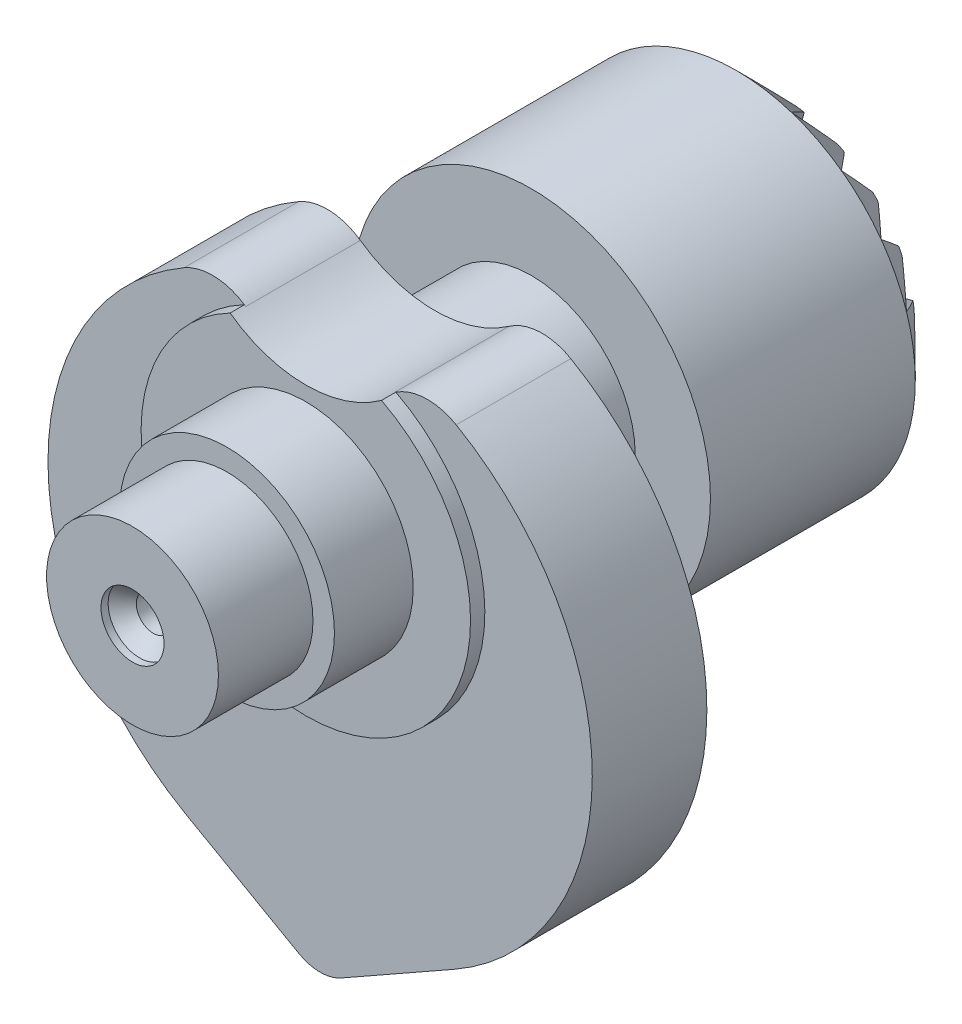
ISO-10303-21;
HEADER;
FILE_DESCRIPTION(('STEP AP214'),'2;1');
FILE_NAME('part.step','',(''),(''),'','','');
FILE_SCHEMA(('AUTOMOTIVE_DESIGN { 1 0 10303 214 1 1 1 1 }'));
ENDSEC;
DATA;
#1=APPLICATION_CONTEXT('core data for automotive mechanical design processes');
#2=APPLICATION_PROTOCOL_DEFINITION('international standard','automotive_design',2000,#1);
#3=PRODUCT_CONTEXT('',#1,'mechanical');
#4=PRODUCT('Part','Part','',(#3));
#5=PRODUCT_RELATED_PRODUCT_CATEGORY('part','',(#4));
#6=PRODUCT_DEFINITION_FORMATION('','',#4);
#7=PRODUCT_DEFINITION_CONTEXT('part definition',#1,'design');
#8=PRODUCT_DEFINITION('design','',#6,#7);
#9=PRODUCT_DEFINITION_SHAPE('','',#8);
#10=(LENGTH_UNIT() NAMED_UNIT(*) SI_UNIT(.MILLI.,.METRE.));
#11=(NAMED_UNIT(*) PLANE_ANGLE_UNIT() SI_UNIT($,.RADIAN.));
#12=(NAMED_UNIT(*) SI_UNIT($,.STERADIAN.) SOLID_ANGLE_UNIT());
#13=UNCERTAINTY_MEASURE_WITH_UNIT(LENGTH_MEASURE(1.E-05),#10,'distance_accuracy_value','');
#14=(GEOMETRIC_REPRESENTATION_CONTEXT(3) GLOBAL_UNCERTAINTY_ASSIGNED_CONTEXT((#13)) GLOBAL_UNIT_ASSIGNED_CONTEXT((#10,
#11,#12)) REPRESENTATION_CONTEXT('',''));
#15=CARTESIAN_POINT('',(0.,0.,0.));
#16=DIRECTION('',(0.,0.,1.));
#17=DIRECTION('',(1.,0.,0.));
#18=AXIS2_PLACEMENT_3D('',#15,#16,#17);
#19=CARTESIAN_POINT('',(0.,27.5,-24.05));
#20=DIRECTION('',(0.,0.,-1.));
#21=DIRECTION('',(-1.,0.,0.));
#22=AXIS2_PLACEMENT_3D('',#19,#20,#21);
#23=PLANE('',#22);
#24=DIRECTION('',(-0.967057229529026,-0.254559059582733,0.));
#25=VECTOR('',#24,1.);
#26=CARTESIAN_POINT('',(0.174998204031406,26.8351905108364,-24.05));
#27=LINE('',#26,#25);
#28=CARTESIAN_POINT('',(9.337956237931,29.2471614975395,-24.05));
#29=VERTEX_POINT('',#28);
#30=CARTESIAN_POINT('',(6.78016572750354,28.5738727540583,-24.05));
#31=VERTEX_POINT('',#30);
#32=EDGE_CURVE('E1017',#29,#31,#27,.T.);
#33=ORIENTED_EDGE('',*,*,#32,.F.);
#34=CARTESIAN_POINT('',(0.,27.5,-24.05));
#35=DIRECTION('',(0.,0.,-1.));
#36=DIRECTION('',(-1.,0.,0.));
#37=AXIS2_PLACEMENT_3D('',#34,#35,#36);
#38=CIRCLE('',#37,9.49999999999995);
#39=CARTESIAN_POINT('',(9.42082672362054,28.7239378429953,-24.05));
#40=VERTEX_POINT('',#39);
#41=EDGE_CURVE('E1299',#29,#40,#38,.T.);
#42=ORIENTED_EDGE('',*,*,#41,.T.);
#43=DIRECTION('',(0.998389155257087,0.0567370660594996,0.));
#44=VECTOR('',#43,1.);
#45=CARTESIAN_POINT('',(-0.0390042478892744,28.1863488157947,-24.05));
#46=LINE('',#45,#44);
#47=EDGE_CURVE('E1044',#31,#40,#46,.T.);
#48=ORIENTED_EDGE('',*,*,#47,.F.);
#49=EDGE_LOOP('',(#33,#42,#48));
#50=FACE_BOUND('',#49,.T.);
#51=ADVANCED_FACE('F29',(#50),#23,.T.);
#52=DIRECTION('',(0.967057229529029,-0.254559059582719,0.));
#53=VECTOR('',#52,1.);
#54=CARTESIAN_POINT('',(0.174998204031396,28.1648094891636,-24.05));
#55=LINE('',#54,#53);
#56=CARTESIAN_POINT('',(6.78016572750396,26.4261272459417,-24.05));
#57=VERTEX_POINT('',#56);
#58=CARTESIAN_POINT('',(9.33795623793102,25.7528385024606,-24.05));
#59=VERTEX_POINT('',#58);
#60=EDGE_CURVE('E935',#57,#59,#55,.T.);
#61=ORIENTED_EDGE('',*,*,#60,.F.);
#62=DIRECTION('',(-0.998389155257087,0.0567370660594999,0.));
#63=VECTOR('',#62,1.);
#64=CARTESIAN_POINT('',(-0.0390042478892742,26.8136511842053,-24.05));
#65=LINE('',#64,#63);
#66=CARTESIAN_POINT('',(9.42082672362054,26.2760621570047,-24.05));
#67=VERTEX_POINT('',#66);
#68=EDGE_CURVE('E1039',#67,#57,#65,.T.);
#69=ORIENTED_EDGE('',*,*,#68,.F.);
#70=EDGE_CURVE('E1300',#67,#59,#38,.T.);
#71=ORIENTED_EDGE('',*,*,#70,.T.);
#72=EDGE_LOOP('',(#61,#69,#71));
#73=FACE_BOUND('',#72,.T.);
#74=ADVANCED_FACE('F1240',(#73),#23,.T.);
#75=DIRECTION('',(-0.931991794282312,0.362479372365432,0.));
#76=VECTOR('',#75,1.);
#77=CARTESIAN_POINT('',(-0.249188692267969,26.8592964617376,-24.05));
#78=LINE('',#77,#76);
#79=CARTESIAN_POINT('',(8.58152105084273,23.4247703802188,-24.05));
#80=VERTEX_POINT('',#79);
#81=CARTESIAN_POINT('',(6.1164758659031,24.383499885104,-24.05));
#82=VERTEX_POINT('',#81);
#83=EDGE_CURVE('E887',#80,#82,#78,.T.);
#84=ORIENTED_EDGE('',*,*,#83,.F.);
#85=CARTESIAN_POINT('',(8.34102153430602,22.9527635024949,-24.05));
#86=VERTEX_POINT('',#85);
#87=EDGE_CURVE('E1305',#80,#86,#38,.T.);
#88=ORIENTED_EDGE('',*,*,#87,.T.);
#89=DIRECTION('',(0.841063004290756,-0.540937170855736,0.));
#90=VECTOR('',#89,1.);
#91=CARTESIAN_POINT('',(0.371870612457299,28.0781939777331,-24.05));
#92=LINE('',#91,#90);
#93=EDGE_CURVE('E863',#82,#86,#92,.T.);
#94=ORIENTED_EDGE('',*,*,#93,.F.);
#95=EDGE_LOOP('',(#84,#88,#94));
#96=FACE_BOUND('',#95,.T.);
#97=ADVANCED_FACE('F1247',(#96),#23,.T.);
#98=DIRECTION('',(0.632739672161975,-0.774364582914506,0.));
#99=VECTOR('',#98,1.);
#100=CARTESIAN_POINT('',(0.532341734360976,27.9349808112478,-24.05));
#101=LINE('',#100,#99);
#102=CARTESIAN_POINT('',(4.85406273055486,22.6459372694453,-24.05));
#103=VERTEX_POINT('',#102);
#104=CARTESIAN_POINT('',(6.52760952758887,20.5978036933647,-24.05));
#105=VERTEX_POINT('',#104);
#106=EDGE_CURVE('E871',#103,#105,#101,.T.);
#107=ORIENTED_EDGE('',*,*,#106,.F.);
#108=DIRECTION('',(-0.774364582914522,0.632739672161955,0.));
#109=VECTOR('',#108,1.);
#110=CARTESIAN_POINT('',(-0.434980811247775,26.967658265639,-24.05));
#111=LINE('',#110,#109);
#112=CARTESIAN_POINT('',(6.90219630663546,20.9723904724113,-24.05));
#113=VERTEX_POINT('',#112);
#114=EDGE_CURVE('E855',#113,#103,#111,.T.);
#115=ORIENTED_EDGE('',*,*,#114,.F.);
#116=EDGE_CURVE('E2566',#113,#105,#38,.T.);
#117=ORIENTED_EDGE('',*,*,#116,.T.);
#118=EDGE_LOOP('',(#107,#115,#117));
#119=FACE_BOUND('',#118,.T.);
#120=ADVANCED_FACE('F1696',(#119),#23,.T.);
#121=DIRECTION('',(-0.540937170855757,0.841063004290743,0.));
#122=VECTOR('',#121,1.);
#123=CARTESIAN_POINT('',(-0.578193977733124,27.1281293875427,-24.05));
#124=LINE('',#123,#122);
#125=CARTESIAN_POINT('',(4.54723649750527,19.1589784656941,-24.05));
#126=VERTEX_POINT('',#125);
#127=CARTESIAN_POINT('',(3.11650011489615,21.383524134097,-24.05));
#128=VERTEX_POINT('',#127);
#129=EDGE_CURVE('E879',#126,#128,#124,.T.);
#130=ORIENTED_EDGE('',*,*,#129,.F.);
#131=CARTESIAN_POINT('',(4.07522961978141,18.9184789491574,-24.05));
#132=VERTEX_POINT('',#131);
#133=EDGE_CURVE('E2575',#126,#132,#38,.T.);
#134=ORIENTED_EDGE('',*,*,#133,.T.);
#135=DIRECTION('',(0.362479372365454,-0.931991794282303,0.));
#136=VECTOR('',#135,1.);
#137=CARTESIAN_POINT('',(0.640703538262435,27.749188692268,-24.05));
#138=LINE('',#137,#136);
#139=EDGE_CURVE('E847',#128,#132,#138,.T.);
#140=ORIENTED_EDGE('',*,*,#139,.F.);
#141=EDGE_LOOP('',(#130,#134,#140));
#142=FACE_BOUND('',#141,.T.);
#143=ADVANCED_FACE('F1687',(#142),#23,.T.);
#144=DIRECTION('',(0.05673706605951,-0.998389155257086,0.));
#145=VECTOR('',#144,1.);
#146=CARTESIAN_POINT('',(0.68634881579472,27.5390042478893,-24.05));
#147=LINE('',#146,#145);
#148=CARTESIAN_POINT('',(1.07387275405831,20.7198342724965,-24.05));
#149=VERTEX_POINT('',#148);
#150=CARTESIAN_POINT('',(1.22393784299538,18.0791732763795,-24.05));
#151=VERTEX_POINT('',#150);
#152=EDGE_CURVE('E895',#149,#151,#147,.T.);
#153=ORIENTED_EDGE('',*,*,#152,.F.);
#154=DIRECTION('',(-0.254559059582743,0.967057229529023,0.));
#155=VECTOR('',#154,1.);
#156=CARTESIAN_POINT('',(-0.664809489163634,27.3250017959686,-24.05));
#157=LINE('',#156,#155);
#158=CARTESIAN_POINT('',(1.7471614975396,18.162043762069,-24.05));
#159=VERTEX_POINT('',#158);
#160=EDGE_CURVE('E839',#159,#149,#157,.T.);
#161=ORIENTED_EDGE('',*,*,#160,.F.);
#162=EDGE_CURVE('E2577',#159,#151,#38,.T.);
#163=ORIENTED_EDGE('',*,*,#162,.T.);
#164=EDGE_LOOP('',(#153,#161,#163));
#165=FACE_BOUND('',#164,.T.);
#166=ADVANCED_FACE('F1678',(#165),#23,.T.);
#167=DIRECTION('',(0.0567370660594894,0.998389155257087,0.));
#168=VECTOR('',#167,1.);
#169=CARTESIAN_POINT('',(-0.686348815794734,27.5390042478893,-24.05));
#170=LINE('',#169,#168);
#171=CARTESIAN_POINT('',(-1.2239378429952,18.0791732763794,-24.05));
#172=VERTEX_POINT('',#171);
#173=CARTESIAN_POINT('',(-1.07387275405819,20.7198342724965,-24.05));
#174=VERTEX_POINT('',#173);
#175=EDGE_CURVE('E903',#172,#174,#170,.T.);
#176=ORIENTED_EDGE('',*,*,#175,.F.);
#177=CARTESIAN_POINT('',(-1.74716149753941,18.162043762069,-24.05));
#178=VERTEX_POINT('',#177);
#179=EDGE_CURVE('E2582',#172,#178,#38,.T.);
#180=ORIENTED_EDGE('',*,*,#179,.T.);
#181=DIRECTION('',(-0.254559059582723,-0.967057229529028,0.));
#182=VECTOR('',#181,1.);
#183=CARTESIAN_POINT('',(0.664809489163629,27.3250017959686,-24.05));
#184=LINE('',#183,#182);
#185=EDGE_CURVE('E831',#174,#178,#184,.T.);
#186=ORIENTED_EDGE('',*,*,#185,.F.);
#187=EDGE_LOOP('',(#176,#180,#186));
#188=FACE_BOUND('',#187,.T.);
#189=ADVANCED_FACE('F1669',(#188),#23,.T.);
#190=DIRECTION('',(-0.540937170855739,-0.841063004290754,0.));
#191=VECTOR('',#190,1.);
#192=CARTESIAN_POINT('',(0.578193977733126,27.1281293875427,-24.05));
#193=LINE('',#192,#191);
#194=CARTESIAN_POINT('',(-3.11650011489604,21.3835241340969,-24.05));
#195=VERTEX_POINT('',#194);
#196=CARTESIAN_POINT('',(-4.54723649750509,19.158978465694,-24.05));
#197=VERTEX_POINT('',#196);
#198=EDGE_CURVE('E911',#195,#197,#193,.T.);
#199=ORIENTED_EDGE('',*,*,#198,.F.);
#200=DIRECTION('',(0.362479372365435,0.93199179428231,0.));
#201=VECTOR('',#200,1.);
#202=CARTESIAN_POINT('',(-0.640703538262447,27.749188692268,-24.05));
#203=LINE('',#202,#201);
#204=CARTESIAN_POINT('',(-4.07522961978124,18.9184789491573,-24.05));
#205=VERTEX_POINT('',#204);
#206=EDGE_CURVE('E823',#205,#195,#203,.T.);
#207=ORIENTED_EDGE('',*,*,#206,.F.);
#208=EDGE_CURVE('E2585',#205,#197,#38,.T.);
#209=ORIENTED_EDGE('',*,*,#208,.T.);
#210=EDGE_LOOP('',(#199,#207,#209));
#211=FACE_BOUND('',#210,.T.);
#212=ADVANCED_FACE('F1660',(#211),#23,.T.);
#213=DIRECTION('',(0.632739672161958,0.774364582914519,0.));
#214=VECTOR('',#213,1.);
#215=CARTESIAN_POINT('',(-0.532341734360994,27.9349808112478,-24.05));
#216=LINE('',#215,#214);
#217=CARTESIAN_POINT('',(-6.52760952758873,20.5978036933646,-24.05));
#218=VERTEX_POINT('',#217);
#219=CARTESIAN_POINT('',(-4.85406273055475,22.6459372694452,-24.05));
#220=VERTEX_POINT('',#219);
#221=EDGE_CURVE('E919',#218,#220,#216,.T.);
#222=ORIENTED_EDGE('',*,*,#221,.F.);
#223=CARTESIAN_POINT('',(-6.90219630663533,20.9723904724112,-24.05));
#224=VERTEX_POINT('',#223);
#225=EDGE_CURVE('E2588',#218,#224,#38,.T.);
#226=ORIENTED_EDGE('',*,*,#225,.T.);
#227=DIRECTION('',(-0.774364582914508,-0.632739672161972,0.));
#228=VECTOR('',#227,1.);
#229=CARTESIAN_POINT('',(0.434980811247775,26.967658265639,-24.05));
#230=LINE('',#229,#228);
#231=EDGE_CURVE('E815',#220,#224,#230,.T.);
#232=ORIENTED_EDGE('',*,*,#231,.F.);
#233=EDGE_LOOP('',(#222,#226,#232));
#234=FACE_BOUND('',#233,.T.);
#235=ADVANCED_FACE('F1651',(#234),#23,.T.);
#236=DIRECTION('',(-0.931991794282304,-0.362479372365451,0.));
#237=VECTOR('',#236,1.);
#238=CARTESIAN_POINT('',(0.249188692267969,26.8592964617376,-24.05));
#239=LINE('',#238,#237);
#240=CARTESIAN_POINT('',(-6.11647586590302,24.3834998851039,-24.05));
#241=VERTEX_POINT('',#240);
#242=CARTESIAN_POINT('',(-8.58152105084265,23.4247703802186,-24.05));
#243=VERTEX_POINT('',#242);
#244=EDGE_CURVE('E927',#241,#243,#239,.T.);
#245=ORIENTED_EDGE('',*,*,#244,.F.);
#246=DIRECTION('',(0.841063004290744,0.540937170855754,0.));
#247=VECTOR('',#246,1.);
#248=CARTESIAN_POINT('',(-0.371870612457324,28.0781939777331,-24.05));
#249=LINE('',#248,#247);
#250=CARTESIAN_POINT('',(-8.34102153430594,22.9527635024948,-24.05));
#251=VERTEX_POINT('',#250);
#252=EDGE_CURVE('E807',#251,#241,#249,.T.);
#253=ORIENTED_EDGE('',*,*,#252,.F.);
#254=EDGE_CURVE('E2593',#251,#243,#38,.T.);
#255=ORIENTED_EDGE('',*,*,#254,.T.);
#256=EDGE_LOOP('',(#245,#253,#255));
#257=FACE_BOUND('',#256,.T.);
#258=ADVANCED_FACE('F1642',(#257),#23,.T.);
#259=DIRECTION('',(0.967057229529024,0.254559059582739,0.));
#260=VECTOR('',#259,1.);
#261=CARTESIAN_POINT('',(-0.174998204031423,28.1648094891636,-24.05));
#262=LINE('',#261,#260);
#263=CARTESIAN_POINT('',(-9.337956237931,25.7528385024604,-24.05));
#264=VERTEX_POINT('',#263);
#265=CARTESIAN_POINT('',(-6.78016572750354,26.4261272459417,-24.05));
#266=VERTEX_POINT('',#265);
#267=EDGE_CURVE('E945',#264,#266,#262,.T.);
#268=ORIENTED_EDGE('',*,*,#267,.F.);
#269=CARTESIAN_POINT('',(-9.42082672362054,26.2760621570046,-24.05));
#270=VERTEX_POINT('',#269);
#271=EDGE_CURVE('E2598',#264,#270,#38,.T.);
#272=ORIENTED_EDGE('',*,*,#271,.T.);
#273=DIRECTION('',(-0.998389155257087,-0.0567370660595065,0.));
#274=VECTOR('',#273,1.);
#275=CARTESIAN_POINT('',(0.0390042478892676,26.8136511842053,-24.05));
#276=LINE('',#275,#274);
#277=EDGE_CURVE('E799',#266,#270,#276,.T.);
#278=ORIENTED_EDGE('',*,*,#277,.F.);
#279=EDGE_LOOP('',(#268,#272,#278));
#280=FACE_BOUND('',#279,.T.);
#281=ADVANCED_FACE('F1633',(#280),#23,.T.);
#282=DIRECTION('',(-0.967057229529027,0.254559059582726,0.));
#283=VECTOR('',#282,1.);
#284=CARTESIAN_POINT('',(-0.174998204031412,26.8351905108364,-24.05));
#285=LINE('',#284,#283);
#286=CARTESIAN_POINT('',(-6.7801657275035,28.5738727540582,-24.05));
#287=VERTEX_POINT('',#286);
#288=CARTESIAN_POINT('',(-9.33795623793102,29.2471614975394,-24.05));
#289=VERTEX_POINT('',#288);
#290=EDGE_CURVE('E953',#287,#289,#285,.T.);
#291=ORIENTED_EDGE('',*,*,#290,.F.);
#292=DIRECTION('',(0.998389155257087,-0.0567370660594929,0.));
#293=VECTOR('',#292,1.);
#294=CARTESIAN_POINT('',(0.0390042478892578,28.1863488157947,-24.05));
#295=LINE('',#294,#293);
#296=CARTESIAN_POINT('',(-9.42082672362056,28.7239378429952,-24.05));
#297=VERTEX_POINT('',#296);
#298=EDGE_CURVE('E791',#297,#287,#295,.T.);
#299=ORIENTED_EDGE('',*,*,#298,.F.);
#300=EDGE_CURVE('E2603',#297,#289,#38,.T.);
#301=ORIENTED_EDGE('',*,*,#300,.T.);
#302=EDGE_LOOP('',(#291,#299,#301));
#303=FACE_BOUND('',#302,.T.);
#304=ADVANCED_FACE('F1624',(#303),#23,.T.);
#305=DIRECTION('',(0.931991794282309,-0.362479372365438,0.));
#306=VECTOR('',#305,1.);
#307=CARTESIAN_POINT('',(0.249188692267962,28.1407035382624,-24.05));
#308=LINE('',#307,#306);
#309=CARTESIAN_POINT('',(-8.58152105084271,31.5752296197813,-24.05));
#310=VERTEX_POINT('',#309);
#311=CARTESIAN_POINT('',(-6.1164758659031,30.6165001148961,-24.05));
#312=VERTEX_POINT('',#311);
#313=EDGE_CURVE('E961',#310,#312,#308,.T.);
#314=ORIENTED_EDGE('',*,*,#313,.F.);
#315=CARTESIAN_POINT('',(-8.341021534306,32.0472364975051,-24.05));
#316=VERTEX_POINT('',#315);
#317=EDGE_CURVE('E2608',#310,#316,#38,.T.);
#318=ORIENTED_EDGE('',*,*,#317,.T.);
#319=DIRECTION('',(-0.841063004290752,0.540937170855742,0.));
#320=VECTOR('',#319,1.);
#321=CARTESIAN_POINT('',(-0.371870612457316,26.9218060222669,-24.05));
#322=LINE('',#321,#320);
#323=EDGE_CURVE('E783',#312,#316,#322,.T.);
#324=ORIENTED_EDGE('',*,*,#323,.F.);
#325=EDGE_LOOP('',(#314,#318,#324));
#326=FACE_BOUND('',#325,.T.);
#327=ADVANCED_FACE('F1615',(#326),#23,.T.);
#328=DIRECTION('',(-0.632739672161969,0.774364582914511,0.));
#329=VECTOR('',#328,1.);
#330=CARTESIAN_POINT('',(-0.532341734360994,27.0650191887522,-24.05));
#331=LINE('',#330,#329);
#332=CARTESIAN_POINT('',(-4.85406273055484,32.3540627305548,-24.05));
#333=VERTEX_POINT('',#332);
#334=CARTESIAN_POINT('',(-6.52760952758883,34.4021963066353,-24.05));
#335=VERTEX_POINT('',#334);
#336=EDGE_CURVE('E969',#333,#335,#331,.T.);
#337=ORIENTED_EDGE('',*,*,#336,.F.);
#338=DIRECTION('',(0.774364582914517,-0.632739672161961,0.));
#339=VECTOR('',#338,1.);
#340=CARTESIAN_POINT('',(0.434980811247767,28.032341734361,-24.05));
#341=LINE('',#340,#339);
#342=CARTESIAN_POINT('',(-6.90219630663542,34.0276095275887,-24.05));
#343=VERTEX_POINT('',#342);
#344=EDGE_CURVE('E775',#343,#333,#341,.T.);
#345=ORIENTED_EDGE('',*,*,#344,.F.);
#346=EDGE_CURVE('E2613',#343,#335,#38,.T.);
#347=ORIENTED_EDGE('',*,*,#346,.T.);
#348=EDGE_LOOP('',(#337,#345,#347));
#349=FACE_BOUND('',#348,.T.);
#350=ADVANCED_FACE('F1606',(#349),#23,.T.);
#351=DIRECTION('',(0.540937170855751,-0.841063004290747,0.));
#352=VECTOR('',#351,1.);
#353=CARTESIAN_POINT('',(0.578193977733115,27.8718706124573,-24.05));
#354=LINE('',#353,#352);
#355=CARTESIAN_POINT('',(-4.54723649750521,35.8410215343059,-24.05));
#356=VERTEX_POINT('',#355);
#357=CARTESIAN_POINT('',(-3.11650011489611,33.616475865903,-24.05));
#358=VERTEX_POINT('',#357);
#359=EDGE_CURVE('E977',#356,#358,#354,.T.);
#360=ORIENTED_EDGE('',*,*,#359,.F.);
#361=CARTESIAN_POINT('',(-4.07522961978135,36.0815210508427,-24.05));
#362=VERTEX_POINT('',#361);
#363=EDGE_CURVE('E2618',#356,#362,#38,.T.);
#364=ORIENTED_EDGE('',*,*,#363,.T.);
#365=DIRECTION('',(-0.362479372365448,0.931991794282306,0.));
#366=VECTOR('',#365,1.);
#367=CARTESIAN_POINT('',(-0.640703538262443,27.250811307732,-24.05));
#368=LINE('',#367,#366);
#369=EDGE_CURVE('E767',#358,#362,#368,.T.);
#370=ORIENTED_EDGE('',*,*,#369,.F.);
#371=EDGE_LOOP('',(#360,#364,#370));
#372=FACE_BOUND('',#371,.T.);
#373=ADVANCED_FACE('F1597',(#372),#23,.T.);
#374=DIRECTION('',(-0.0567370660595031,0.998389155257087,0.));
#375=VECTOR('',#374,1.);
#376=CARTESIAN_POINT('',(-0.686348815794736,27.4609957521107,-24.05));
#377=LINE('',#376,#375);
#378=CARTESIAN_POINT('',(-1.07387275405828,34.2801657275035,-24.05));
#379=VERTEX_POINT('',#378);
#380=CARTESIAN_POINT('',(-1.22393784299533,36.9208267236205,-24.05));
#381=VERTEX_POINT('',#380);
#382=EDGE_CURVE('E985',#379,#381,#377,.T.);
#383=ORIENTED_EDGE('',*,*,#382,.F.);
#384=DIRECTION('',(0.254559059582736,-0.967057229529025,0.));
#385=VECTOR('',#384,1.);
#386=CARTESIAN_POINT('',(0.66480948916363,27.6749982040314,-24.05));
#387=LINE('',#386,#385);
#388=CARTESIAN_POINT('',(-1.74716149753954,36.837956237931,-24.05));
#389=VERTEX_POINT('',#388);
#390=EDGE_CURVE('E759',#389,#379,#387,.T.);
#391=ORIENTED_EDGE('',*,*,#390,.F.);
#392=EDGE_CURVE('E2623',#389,#381,#38,.T.);
#393=ORIENTED_EDGE('',*,*,#392,.T.);
#394=EDGE_LOOP('',(#383,#391,#393));
#395=FACE_BOUND('',#394,.T.);
#396=ADVANCED_FACE('F1588',(#395),#23,.T.);
#397=DIRECTION('',(-0.0567370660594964,-0.998389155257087,0.));
#398=VECTOR('',#397,1.);
#399=CARTESIAN_POINT('',(0.686348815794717,27.4609957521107,-24.05));
#400=LINE('',#399,#398);
#401=CARTESIAN_POINT('',(1.22393784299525,36.9208267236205,-24.05));
#402=VERTEX_POINT('',#401);
#403=CARTESIAN_POINT('',(1.07387275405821,34.2801657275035,-24.05));
#404=VERTEX_POINT('',#403);
#405=EDGE_CURVE('E993',#402,#404,#400,.T.);
#406=ORIENTED_EDGE('',*,*,#405,.F.);
#407=CARTESIAN_POINT('',(1.74716149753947,36.837956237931,-24.05));
#408=VERTEX_POINT('',#407);
#409=EDGE_CURVE('E1297',#402,#408,#38,.T.);
#410=ORIENTED_EDGE('',*,*,#409,.T.);
#411=DIRECTION('',(0.254559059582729,0.967057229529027,0.));
#412=VECTOR('',#411,1.);
#413=CARTESIAN_POINT('',(-0.664809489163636,27.6749982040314,-24.05));
#414=LINE('',#413,#412);
#415=EDGE_CURVE('E751',#404,#408,#414,.T.);
#416=ORIENTED_EDGE('',*,*,#415,.F.);
#417=EDGE_LOOP('',(#406,#410,#416));
#418=FACE_BOUND('',#417,.T.);
#419=ADVANCED_FACE('F1277',(#418),#23,.T.);
#420=DIRECTION('',(0.540937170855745,0.84106300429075,0.));
#421=VECTOR('',#420,1.);
#422=CARTESIAN_POINT('',(-0.578193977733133,27.8718706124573,-24.05));
#423=LINE('',#422,#421);
#424=CARTESIAN_POINT('',(3.11650011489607,33.6164758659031,-24.05));
#425=VERTEX_POINT('',#424);
#426=CARTESIAN_POINT('',(4.54723649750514,35.841021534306,-24.05));
#427=VERTEX_POINT('',#426);
#428=EDGE_CURVE('E1001',#425,#427,#423,.T.);
#429=ORIENTED_EDGE('',*,*,#428,.F.);
#430=DIRECTION('',(-0.362479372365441,-0.931991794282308,0.));
#431=VECTOR('',#430,1.);
#432=CARTESIAN_POINT('',(0.640703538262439,27.250811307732,-24.05));
#433=LINE('',#432,#431);
#434=CARTESIAN_POINT('',(4.07522961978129,36.0815210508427,-24.05));
#435=VERTEX_POINT('',#434);
#436=EDGE_CURVE('E743',#435,#425,#433,.T.);
#437=ORIENTED_EDGE('',*,*,#436,.F.);
#438=EDGE_CURVE('E1293',#435,#427,#38,.T.);
#439=ORIENTED_EDGE('',*,*,#438,.T.);
#440=EDGE_LOOP('',(#429,#437,#439));
#441=FACE_BOUND('',#440,.T.);
#442=ADVANCED_FACE('F1268',(#441),#23,.T.);
#443=DIRECTION('',(-0.632739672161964,-0.774364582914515,0.));
#444=VECTOR('',#443,1.);
#445=CARTESIAN_POINT('',(0.532341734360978,27.0650191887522,-24.05));
#446=LINE('',#445,#444);
#447=CARTESIAN_POINT('',(6.52760952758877,34.4021963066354,-24.05));
#448=VERTEX_POINT('',#447);
#449=CARTESIAN_POINT('',(4.85406273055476,32.3540627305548,-24.05));
#450=VERTEX_POINT('',#449);
#451=EDGE_CURVE('E1009',#448,#450,#446,.T.);
#452=ORIENTED_EDGE('',*,*,#451,.F.);
#453=CARTESIAN_POINT('',(6.90219630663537,34.0276095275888,-24.05));
#454=VERTEX_POINT('',#453);
#455=EDGE_CURVE('E1283',#448,#454,#38,.T.);
#456=ORIENTED_EDGE('',*,*,#455,.T.);
#457=DIRECTION('',(0.774364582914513,0.632739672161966,0.));
#458=VECTOR('',#457,1.);
#459=CARTESIAN_POINT('',(-0.43498081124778,28.032341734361,-24.05));
#460=LINE('',#459,#458);
#461=EDGE_CURVE('E735',#450,#454,#460,.T.);
#462=ORIENTED_EDGE('',*,*,#461,.F.);
#463=EDGE_LOOP('',(#452,#456,#462));
#464=FACE_BOUND('',#463,.T.);
#465=ADVANCED_FACE('F1256',(#464),#23,.T.);
#466=CARTESIAN_POINT('',(0.,27.5,-24.05));
#467=DIRECTION('',(0.,0.,1.));
#468=DIRECTION('',(1.,0.,0.));
#469=AXIS2_PLACEMENT_3D('',#466,#467,#468);
#470=CONICAL_SURFACE('',#469,9.49999999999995,0.785398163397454);
#471=CARTESIAN_POINT('',(8.58129441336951,31.5752406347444,-24.0502));
#472=CARTESIAN_POINT('',(8.86026297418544,31.561665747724,-23.8039861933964));
#473=CARTESIAN_POINT('',(9.13810884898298,31.5470563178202,-23.5565664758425));
#474=CARTESIAN_POINT('',(9.69187398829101,31.5160919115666,-23.059717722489));
#475=CARTESIAN_POINT('',(9.96779335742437,31.4997370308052,-22.810288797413));
#476=CARTESIAN_POINT('',(10.5180492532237,31.4656040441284,-22.3098020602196));
#477=CARTESIAN_POINT('',(10.7923858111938,31.4478259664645,-22.0587442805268));
#478=CARTESIAN_POINT('',(11.3397314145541,31.4110663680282,-21.5552428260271));
#479=CARTESIAN_POINT('',(11.6127403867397,31.3920847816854,-21.302799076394));
#480=CARTESIAN_POINT('',(11.8851955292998,31.3726124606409,-21.0498));
#481=B_SPLINE_CURVE_WITH_KNOTS('',3,(#471,#472,#473,#474,#475,#476,#477,#478,#479,#480),
.UNSPECIFIED.,.F.,.F.,(4,2,2,2,4),(0.,1.11697365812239,2.2338861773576,3.35077653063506,
4.46772778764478),.UNSPECIFIED.);
#482=CARTESIAN_POINT('',(8.58152105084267,31.5752296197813,-24.05));
#483=VERTEX_POINT('',#482);
#484=CARTESIAN_POINT('',(11.8849801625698,31.3726278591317,-21.05));
#485=VERTEX_POINT('',#484);
#486=EDGE_CURVE('E11',#483,#485,#481,.T.);
#487=ORIENTED_EDGE('',*,*,#486,.F.);
#488=CARTESIAN_POINT('',(8.34102153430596,32.0472364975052,-24.05));
#489=VERTEX_POINT('',#488);
#490=EDGE_CURVE('E1294',#489,#483,#38,.T.);
#491=ORIENTED_EDGE('',*,*,#490,.F.);
#492=CARTESIAN_POINT('',(10.1189519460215,34.839060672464,-21.0498));
#493=CARTESIAN_POINT('',(9.97456026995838,34.6071942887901,-21.302799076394));
#494=CARTESIAN_POINT('',(9.82944604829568,34.3751682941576,-21.555242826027));
#495=CARTESIAN_POINT('',(9.53746351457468,33.9107496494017,-22.0587442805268));
#496=CARTESIAN_POINT('',(9.3905952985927,33.6783570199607,-22.3098020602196));
#497=CARTESIAN_POINT('',(9.09477716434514,33.2131277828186,-22.810288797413));
#498=CARTESIAN_POINT('',(8.94582720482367,32.980291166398,-23.059717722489));
#499=CARTESIAN_POINT('',(8.64538295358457,32.5140853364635,-23.5565664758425));
#500=CARTESIAN_POINT('',(8.49388852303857,32.2807160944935,-23.8039861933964));
#501=CARTESIAN_POINT('',(8.34089723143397,32.0470466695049,-24.0502));
#502=B_SPLINE_CURVE_WITH_KNOTS('',3,(#492,#493,#494,#495,#496,#497,#498,#499,#500,#501),
.UNSPECIFIED.,.F.,.F.,(4,2,2,2,4),(0.,1.11695125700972,2.23384161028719,3.3507541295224,
4.46772778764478),.UNSPECIFIED.);
#503=CARTESIAN_POINT('',(10.1188378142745,34.8388773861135,-21.05));
#504=VERTEX_POINT('',#503);
#505=EDGE_CURVE('E2309',#504,#489,#502,.T.);
#506=ORIENTED_EDGE('',*,*,#505,.F.);
#507=CARTESIAN_POINT('',(0.,27.5,-21.05));
#508=DIRECTION('',(0.,0.,-1.));
#509=DIRECTION('',(-1.,0.,0.));
#510=AXIS2_PLACEMENT_3D('',#507,#508,#509);
#511=CIRCLE('',#510,12.5);
#512=EDGE_CURVE('E2311',#485,#504,#511,.F.);
#513=ORIENTED_EDGE('',*,*,#512,.F.);
#514=EDGE_LOOP('',(#487,#491,#506,#513));
#515=FACE_BOUND('',#514,.T.);
#516=ADVANCED_FACE('F1267',(#515),#470,.T.);
#517=CARTESIAN_POINT('',(7.35580071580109,37.6067895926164,-21.0498));
#518=CARTESIAN_POINT('',(7.29012672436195,37.3416520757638,-21.302799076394));
#519=CARTESIAN_POINT('',(7.22381487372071,37.0761394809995,-21.5552428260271));
#520=CARTESIAN_POINT('',(7.08963623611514,36.544223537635,-22.0587442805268));
#521=CARTESIAN_POINT('',(7.0217695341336,36.2778202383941,-22.3098020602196));
#522=CARTESIAN_POINT('',(6.88419351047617,35.7439481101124,-22.810288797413));
#523=CARTESIAN_POINT('',(6.81448415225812,35.4764792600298,-23.059717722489));
#524=CARTESIAN_POINT('',(6.67281021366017,34.9402487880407,-23.5565664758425));
#525=CARTESIAN_POINT('',(6.60084551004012,34.6714870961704,-23.8039861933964));
#526=CARTESIAN_POINT('',(6.52754996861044,34.4019773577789,-24.0502));
#527=B_SPLINE_CURVE_WITH_KNOTS('',3,(#517,#518,#519,#520,#521,#522,#523,#524,#525,#526),
.UNSPECIFIED.,.F.,.F.,(4,2,2,2,4),(0.,1.11695125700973,2.23384161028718,3.3507541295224,
4.46772778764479),.UNSPECIFIED.);
#528=CARTESIAN_POINT('',(7.35574880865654,37.606580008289,-21.05));
#529=VERTEX_POINT('',#528);
#530=EDGE_CURVE('E1290',#529,#448,#527,.T.);
#531=ORIENTED_EDGE('',*,*,#530,.F.);
#532=CARTESIAN_POINT('',(10.106580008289,34.8557488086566,-21.05));
#533=VERTEX_POINT('',#532);
#534=EDGE_CURVE('E2649',#533,#529,#511,.F.);
#535=ORIENTED_EDGE('',*,*,#534,.F.);
#536=CARTESIAN_POINT('',(6.90197735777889,34.0275499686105,-24.0502));
#537=CARTESIAN_POINT('',(7.1714870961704,34.1008455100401,-23.8039861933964));
#538=CARTESIAN_POINT('',(7.44024878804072,34.1728102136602,-23.5565664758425));
#539=CARTESIAN_POINT('',(7.97647926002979,34.3144841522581,-23.059717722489));
#540=CARTESIAN_POINT('',(8.24394811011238,34.3841935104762,-22.810288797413));
#541=CARTESIAN_POINT('',(8.77782023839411,34.5217695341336,-22.3098020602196));
#542=CARTESIAN_POINT('',(9.04422353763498,34.5896362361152,-22.0587442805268));
#543=CARTESIAN_POINT('',(9.57613948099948,34.7238148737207,-21.555242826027));
#544=CARTESIAN_POINT('',(9.84165207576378,34.790126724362,-21.302799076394));
#545=CARTESIAN_POINT('',(10.1067895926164,34.8558007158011,-21.0498));
#546=B_SPLINE_CURVE_WITH_KNOTS('',3,(#536,#537,#538,#539,#540,#541,#542,#543,#544,#545),
.UNSPECIFIED.,.F.,.F.,(4,2,2,2,4),(0.,1.11697365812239,2.2338861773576,3.35077653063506,
4.46772778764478),.UNSPECIFIED.);
#547=EDGE_CURVE('E1292',#454,#533,#546,.T.);
#548=ORIENTED_EDGE('',*,*,#547,.F.);
#549=ORIENTED_EDGE('',*,*,#455,.F.);
#550=EDGE_LOOP('',(#531,#535,#548,#549));
#551=FACE_BOUND('',#550,.T.);
#552=ADVANCED_FACE('F1274',(#551),#470,.T.);
#553=CARTESIAN_POINT('',(0.0103441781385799,40.0002,-21.0497957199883));
#554=CARTESIAN_POINT('',(0.113056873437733,39.747096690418,-21.3027951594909));
#555=CARTESIAN_POINT('',(0.215473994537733,39.4933150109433,-21.5552392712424));
#556=CARTESIAN_POINT('',(0.419573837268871,38.9841170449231,-22.0587414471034));
#557=CARTESIAN_POINT('',(0.521256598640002,38.7287008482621,-22.3097995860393));
#558=CARTESIAN_POINT('',(0.723757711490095,38.2159233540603,-22.8102870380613));
#559=CARTESIAN_POINT('',(0.82457604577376,37.9585620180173,-23.0597163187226));
#560=CARTESIAN_POINT('',(1.02514807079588,37.441467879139,-23.5565657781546));
#561=CARTESIAN_POINT('',(1.12490170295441,37.1817349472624,-23.8039858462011));
#562=CARTESIAN_POINT('',(1.22401835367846,36.9206145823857,-24.0502));
#563=B_SPLINE_CURVE_WITH_KNOTS('',3,(#553,#554,#555,#556,#557,#558,#559,#560,#561,#562),
.UNSPECIFIED.,.F.,.F.,(4,2,2,2,4),(0.,1.1169528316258,2.23384475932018,3.35075885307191,
4.46773408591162),.UNSPECIFIED.);
#564=CARTESIAN_POINT('',(0.0104271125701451,39.9999956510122,-21.05));
#565=VERTEX_POINT('',#564);
#566=EDGE_CURVE('E2369',#565,#402,#563,.T.);
#567=ORIENTED_EDGE('',*,*,#566,.F.);
#568=CARTESIAN_POINT('',(3.85279431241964,39.3914244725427,-21.05));
#569=VERTEX_POINT('',#568);
#570=EDGE_CURVE('E2639',#569,#565,#511,.F.);
#571=ORIENTED_EDGE('',*,*,#570,.F.);
#572=CARTESIAN_POINT('',(1.74701937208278,36.8377793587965,-24.0502));
#573=CARTESIAN_POINT('',(1.92197529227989,37.0554905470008,-23.8039861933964));
#574=CARTESIAN_POINT('',(2.09710827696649,37.2716853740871,-23.5565664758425));
#575=CARTESIAN_POINT('',(2.44765398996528,37.7014903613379,-23.059717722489));
#576=CARTESIAN_POINT('',(2.62306670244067,37.9151006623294,-22.810288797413));
#577=CARTESIAN_POINT('',(2.97411316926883,38.3402041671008,-22.3098020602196));
#578=CARTESIAN_POINT('',(3.14974691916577,38.5516974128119,-22.0587442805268));
#579=CARTESIAN_POINT('',(3.50120773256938,38.9729025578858,-21.555242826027));
#580=CARTESIAN_POINT('',(3.67703480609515,39.1826143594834,-21.302799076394));
#581=CARTESIAN_POINT('',(3.85293335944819,39.3915896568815,-21.0498));
#582=B_SPLINE_CURVE_WITH_KNOTS('',3,(#572,#573,#574,#575,#576,#577,#578,#579,#580,#581),
.UNSPECIFIED.,.F.,.F.,(4,2,2,2,4),(0.,1.11697365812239,2.2338861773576,3.35077653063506,
4.46772778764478),.UNSPECIFIED.);
#583=EDGE_CURVE('E2345',#408,#569,#582,.T.);
#584=ORIENTED_EDGE('',*,*,#583,.F.);
#585=ORIENTED_EDGE('',*,*,#409,.F.);
#586=EDGE_LOOP('',(#567,#571,#584,#585));
#587=FACE_BOUND('',#586,.T.);
#588=ADVANCED_FACE('F1548',(#587),#470,.T.);
#589=CARTESIAN_POINT('',(-7.339060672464,37.6189519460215,-21.0498));
#590=CARTESIAN_POINT('',(-7.10719428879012,37.4745602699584,-21.302799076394));
#591=CARTESIAN_POINT('',(-6.87516829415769,37.3294460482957,-21.555242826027));
#592=CARTESIAN_POINT('',(-6.4107496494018,37.0374635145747,-22.0587442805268));
#593=CARTESIAN_POINT('',(-6.17835701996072,36.8905952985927,-22.3098020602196));
#594=CARTESIAN_POINT('',(-5.71312778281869,36.5947771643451,-22.810288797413));
#595=CARTESIAN_POINT('',(-5.48029116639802,36.4458272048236,-23.059717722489));
#596=CARTESIAN_POINT('',(-5.01408533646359,36.1453829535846,-23.5565664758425));
#597=CARTESIAN_POINT('',(-4.78071609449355,35.9938885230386,-23.8039861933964));
#598=CARTESIAN_POINT('',(-4.54704666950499,35.8408972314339,-24.0502));
#599=B_SPLINE_CURVE_WITH_KNOTS('',3,(#589,#590,#591,#592,#593,#594,#595,#596,#597,#598),
.UNSPECIFIED.,.F.,.F.,(4,2,2,2,4),(0.,1.11695125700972,2.23384161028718,3.3507541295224,
4.46772778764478),.UNSPECIFIED.);
#600=CARTESIAN_POINT('',(-7.33887738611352,37.6188378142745,-21.05));
#601=VERTEX_POINT('',#600);
#602=EDGE_CURVE('E2379',#601,#356,#599,.T.);
#603=ORIENTED_EDGE('',*,*,#602,.F.);
#604=CARTESIAN_POINT('',(-3.87262785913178,39.3849801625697,-21.05));
#605=VERTEX_POINT('',#604);
#606=EDGE_CURVE('E2653',#605,#601,#511,.F.);
#607=ORIENTED_EDGE('',*,*,#606,.F.);
#608=CARTESIAN_POINT('',(-4.07524063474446,36.0812944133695,-24.0502));
#609=CARTESIAN_POINT('',(-4.06166574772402,36.3602629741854,-23.8039861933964));
#610=CARTESIAN_POINT('',(-4.04705631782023,36.638108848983,-23.5565664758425));
#611=CARTESIAN_POINT('',(-4.01609191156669,37.191873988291,-23.059717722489));
#612=CARTESIAN_POINT('',(-3.99973703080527,37.4677933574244,-22.810288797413));
#613=CARTESIAN_POINT('',(-3.96560404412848,38.0180492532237,-22.3098020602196));
#614=CARTESIAN_POINT('',(-3.9478259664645,38.2923858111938,-22.0587442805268));
#615=CARTESIAN_POINT('',(-3.91106636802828,38.8397314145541,-21.555242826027));
#616=CARTESIAN_POINT('',(-3.89208478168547,39.1127403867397,-21.302799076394));
#617=CARTESIAN_POINT('',(-3.87261246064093,39.3851955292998,-21.0498));
#618=B_SPLINE_CURVE_WITH_KNOTS('',3,(#608,#609,#610,#611,#612,#613,#614,#615,#616,#617),
.UNSPECIFIED.,.F.,.F.,(4,2,2,2,4),(0.,1.11697365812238,2.2338861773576,3.35077653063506,
4.46772778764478),.UNSPECIFIED.);
#619=EDGE_CURVE('E2359',#362,#605,#618,.T.);
#620=ORIENTED_EDGE('',*,*,#619,.F.);
#621=ORIENTED_EDGE('',*,*,#363,.F.);
#622=EDGE_LOOP('',(#603,#607,#620,#621));
#623=FACE_BOUND('',#622,.T.);
#624=ADVANCED_FACE('F1539',(#623),#470,.T.);
#625=CARTESIAN_POINT('',(-11.8851955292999,31.3726124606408,-21.0498));
#626=CARTESIAN_POINT('',(-11.6127403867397,31.3920847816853,-21.302799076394));
#627=CARTESIAN_POINT('',(-11.3397314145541,31.4110663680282,-21.555242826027));
#628=CARTESIAN_POINT('',(-10.7923858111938,31.4478259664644,-22.0587442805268));
#629=CARTESIAN_POINT('',(-10.5180492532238,31.4656040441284,-22.3098020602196));
#630=CARTESIAN_POINT('',(-9.96779335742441,31.4997370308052,-22.810288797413));
#631=CARTESIAN_POINT('',(-9.69187398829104,31.5160919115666,-23.059717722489));
#632=CARTESIAN_POINT('',(-9.13810884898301,31.5470563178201,-23.5565664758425));
#633=CARTESIAN_POINT('',(-8.86026297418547,31.5616657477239,-23.8039861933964));
#634=CARTESIAN_POINT('',(-8.58129441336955,31.5752406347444,-24.0502));
#635=B_SPLINE_CURVE_WITH_KNOTS('',3,(#625,#626,#627,#628,#629,#630,#631,#632,#633,#634),
.UNSPECIFIED.,.F.,.F.,(4,2,2,2,4),(0.,1.11695125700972,2.23384161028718,3.3507541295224,
4.46772778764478),.UNSPECIFIED.);
#636=CARTESIAN_POINT('',(-11.8849801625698,31.3726278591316,-21.05));
#637=VERTEX_POINT('',#636);
#638=EDGE_CURVE('E2417',#637,#310,#635,.T.);
#639=ORIENTED_EDGE('',*,*,#638,.F.);
#640=CARTESIAN_POINT('',(-10.1188378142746,34.8388773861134,-21.05));
#641=VERTEX_POINT('',#640);
#642=EDGE_CURVE('E2659',#641,#637,#511,.F.);
#643=ORIENTED_EDGE('',*,*,#642,.F.);
#644=CARTESIAN_POINT('',(-8.34089723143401,32.0470466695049,-24.0502));
#645=CARTESIAN_POINT('',(-8.49388852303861,32.2807160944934,-23.8039861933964));
#646=CARTESIAN_POINT('',(-8.64538295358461,32.5140853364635,-23.5565664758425));
#647=CARTESIAN_POINT('',(-8.94582720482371,32.9802911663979,-23.059717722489));
#648=CARTESIAN_POINT('',(-9.09477716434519,33.2131277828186,-22.810288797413));
#649=CARTESIAN_POINT('',(-9.39059529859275,33.6783570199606,-22.3098020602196));
#650=CARTESIAN_POINT('',(-9.53746351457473,33.9107496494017,-22.0587442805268));
#651=CARTESIAN_POINT('',(-9.82944604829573,34.3751682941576,-21.5552428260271));
#652=CARTESIAN_POINT('',(-9.97456026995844,34.60719428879,-21.302799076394));
#653=CARTESIAN_POINT('',(-10.1189519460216,34.8390606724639,-21.0498));
#654=B_SPLINE_CURVE_WITH_KNOTS('',3,(#644,#645,#646,#647,#648,#649,#650,#651,#652,#653),
.UNSPECIFIED.,.F.,.F.,(4,2,2,2,4),(0.,1.11697365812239,2.2338861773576,3.35077653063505,
4.46772778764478),.UNSPECIFIED.);
#655=EDGE_CURVE('E2393',#316,#641,#654,.T.);
#656=ORIENTED_EDGE('',*,*,#655,.F.);
#657=ORIENTED_EDGE('',*,*,#317,.F.);
#658=EDGE_LOOP('',(#639,#643,#656,#657));
#659=FACE_BOUND('',#658,.T.);
#660=ADVANCED_FACE('F1530',(#659),#470,.T.);
#661=CARTESIAN_POINT('',(-11.8915896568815,23.6470666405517,-21.0498));
#662=CARTESIAN_POINT('',(-11.6826143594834,23.8229651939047,-21.302799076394));
#663=CARTESIAN_POINT('',(-11.4729025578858,23.9987922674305,-21.555242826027));
#664=CARTESIAN_POINT('',(-11.0516974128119,24.3502530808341,-22.0587442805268));
#665=CARTESIAN_POINT('',(-10.8402041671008,24.5258868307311,-22.3098020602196));
#666=CARTESIAN_POINT('',(-10.4151006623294,24.8769332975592,-22.810288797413));
#667=CARTESIAN_POINT('',(-10.2014903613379,25.0523460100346,-23.059717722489));
#668=CARTESIAN_POINT('',(-9.77168537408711,25.4028917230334,-23.5565664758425));
#669=CARTESIAN_POINT('',(-9.55549054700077,25.57802470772,-23.8039861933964));
#670=CARTESIAN_POINT('',(-9.33777935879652,25.7529806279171,-24.0502));
#671=B_SPLINE_CURVE_WITH_KNOTS('',3,(#661,#662,#663,#664,#665,#666,#667,#668,#669,#670),
.UNSPECIFIED.,.F.,.F.,(4,2,2,2,4),(0.,1.11695125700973,2.23384161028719,3.35075412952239,
4.46772778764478),.UNSPECIFIED.);
#672=CARTESIAN_POINT('',(-11.8914244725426,23.6472056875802,-21.05));
#673=VERTEX_POINT('',#672);
#674=EDGE_CURVE('E2427',#673,#264,#671,.T.);
#675=ORIENTED_EDGE('',*,*,#674,.F.);
#676=CARTESIAN_POINT('',(-12.4999956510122,27.4895728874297,-21.05));
#677=VERTEX_POINT('',#676);
#678=EDGE_CURVE('E2665',#677,#673,#511,.F.);
#679=ORIENTED_EDGE('',*,*,#678,.F.);
#680=CARTESIAN_POINT('',(-9.42061458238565,26.2759816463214,-24.0502));
#681=CARTESIAN_POINT('',(-9.68173494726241,26.3750982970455,-23.8039858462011));
#682=CARTESIAN_POINT('',(-9.94146787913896,26.474851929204,-23.5565657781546));
#683=CARTESIAN_POINT('',(-10.4585620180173,26.6754239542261,-23.0597163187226));
#684=CARTESIAN_POINT('',(-10.7159233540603,26.7762422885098,-22.8102870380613));
#685=CARTESIAN_POINT('',(-11.2287008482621,26.9787434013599,-22.3097995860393));
#686=CARTESIAN_POINT('',(-11.4841170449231,27.080426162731,-22.0587414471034));
#687=CARTESIAN_POINT('',(-11.9933150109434,27.2845260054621,-21.5552392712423));
#688=CARTESIAN_POINT('',(-12.247096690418,27.3869431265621,-21.3027951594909));
#689=CARTESIAN_POINT('',(-12.5002,27.4896558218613,-21.0497957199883));
#690=B_SPLINE_CURVE_WITH_KNOTS('',3,(#680,#681,#682,#683,#684,#685,#686,#687,#688,#689),
.UNSPECIFIED.,.F.,.F.,(4,2,2,2,4),(0.,1.11697523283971,2.23388932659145,3.35078125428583,
4.46773408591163),.UNSPECIFIED.);
#691=EDGE_CURVE('E2407',#270,#677,#690,.T.);
#692=ORIENTED_EDGE('',*,*,#691,.F.);
#693=ORIENTED_EDGE('',*,*,#271,.F.);
#694=EDGE_LOOP('',(#675,#679,#692,#693));
#695=FACE_BOUND('',#694,.T.);
#696=ADVANCED_FACE('F1521',(#695),#470,.T.);
#697=CARTESIAN_POINT('',(-7.35580071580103,17.3932104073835,-21.0498));
#698=CARTESIAN_POINT('',(-7.29012672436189,17.6583479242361,-21.302799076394));
#699=CARTESIAN_POINT('',(-7.22381487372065,17.9238605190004,-21.555242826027));
#700=CARTESIAN_POINT('',(-7.08963623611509,18.4557764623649,-22.0587442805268));
#701=CARTESIAN_POINT('',(-7.02176953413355,18.7221797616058,-22.3098020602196));
#702=CARTESIAN_POINT('',(-6.88419351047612,19.2560518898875,-22.810288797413));
#703=CARTESIAN_POINT('',(-6.81448415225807,19.5235207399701,-23.059717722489));
#704=CARTESIAN_POINT('',(-6.67281021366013,20.0597512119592,-23.5565664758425));
#705=CARTESIAN_POINT('',(-6.60084551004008,20.3285129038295,-23.8039861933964));
#706=CARTESIAN_POINT('',(-6.5275499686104,20.598022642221,-24.0502));
#707=B_SPLINE_CURVE_WITH_KNOTS('',3,(#697,#698,#699,#700,#701,#702,#703,#704,#705,#706),
.UNSPECIFIED.,.F.,.F.,(4,2,2,2,4),(0.,1.11695125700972,2.23384161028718,3.3507541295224,
4.46772778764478),.UNSPECIFIED.);
#708=CARTESIAN_POINT('',(-7.35574880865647,17.3934199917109,-21.05));
#709=VERTEX_POINT('',#708);
#710=EDGE_CURVE('E2466',#709,#218,#707,.T.);
#711=ORIENTED_EDGE('',*,*,#710,.F.);
#712=CARTESIAN_POINT('',(-10.106580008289,20.1442511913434,-21.05));
#713=VERTEX_POINT('',#712);
#714=EDGE_CURVE('E2553',#713,#709,#511,.F.);
#715=ORIENTED_EDGE('',*,*,#714,.F.);
#716=CARTESIAN_POINT('',(-6.90197735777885,20.9724500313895,-24.0502));
#717=CARTESIAN_POINT('',(-7.17148709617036,20.8991544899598,-23.8039861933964));
#718=CARTESIAN_POINT('',(-7.44024878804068,20.8271897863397,-23.5565664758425));
#719=CARTESIAN_POINT('',(-7.97647926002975,20.6855158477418,-23.059717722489));
#720=CARTESIAN_POINT('',(-8.24394811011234,20.6158064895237,-22.810288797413));
#721=CARTESIAN_POINT('',(-8.77782023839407,20.4782304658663,-22.3098020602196));
#722=CARTESIAN_POINT('',(-9.04422353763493,20.4103637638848,-22.0587442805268));
#723=CARTESIAN_POINT('',(-9.57613948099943,20.2761851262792,-21.555242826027));
#724=CARTESIAN_POINT('',(-9.84165207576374,20.2098732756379,-21.302799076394));
#725=CARTESIAN_POINT('',(-10.1067895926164,20.1441992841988,-21.0498));
#726=B_SPLINE_CURVE_WITH_KNOTS('',3,(#716,#717,#718,#719,#720,#721,#722,#723,#724,#725),
.UNSPECIFIED.,.F.,.F.,(4,2,2,2,4),(0.,1.11697365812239,2.2338861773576,3.35077653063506,
4.46772778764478),.UNSPECIFIED.);
#727=EDGE_CURVE('E2441',#224,#713,#726,.T.);
#728=ORIENTED_EDGE('',*,*,#727,.F.);
#729=ORIENTED_EDGE('',*,*,#225,.F.);
#730=EDGE_LOOP('',(#711,#715,#728,#729));
#731=FACE_BOUND('',#730,.T.);
#732=ADVANCED_FACE('F1512',(#731),#470,.T.);
#733=CARTESIAN_POINT('',(-0.0103441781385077,14.9998,-21.0497957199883));
#734=CARTESIAN_POINT('',(-0.113056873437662,15.252903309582,-21.3027951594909));
#735=CARTESIAN_POINT('',(-0.215473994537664,15.5066849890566,-21.5552392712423));
#736=CARTESIAN_POINT('',(-0.419573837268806,16.0158829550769,-22.0587414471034));
#737=CARTESIAN_POINT('',(-0.521256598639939,16.2712991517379,-22.3097995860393));
#738=CARTESIAN_POINT('',(-0.723757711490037,16.7840766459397,-22.8102870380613));
#739=CARTESIAN_POINT('',(-0.824576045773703,17.0414379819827,-23.0597163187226));
#740=CARTESIAN_POINT('',(-1.02514807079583,17.558532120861,-23.5565657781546));
#741=CARTESIAN_POINT('',(-1.12490170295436,17.8182650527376,-23.8039858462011));
#742=CARTESIAN_POINT('',(-1.22401835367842,18.0793854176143,-24.0502));
#743=B_SPLINE_CURVE_WITH_KNOTS('',3,(#733,#734,#735,#736,#737,#738,#739,#740,#741,#742),
.UNSPECIFIED.,.F.,.F.,(4,2,2,2,4),(0.,1.1169528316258,2.23384475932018,3.35075885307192,
4.46773408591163),.UNSPECIFIED.);
#744=CARTESIAN_POINT('',(-0.0104271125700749,15.0000043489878,-21.05));
#745=VERTEX_POINT('',#744);
#746=EDGE_CURVE('E2495',#745,#172,#743,.T.);
#747=ORIENTED_EDGE('',*,*,#746,.F.);
#748=CARTESIAN_POINT('',(-3.85279431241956,15.6085755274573,-21.05));
#749=VERTEX_POINT('',#748);
#750=EDGE_CURVE('E2548',#749,#745,#511,.F.);
#751=ORIENTED_EDGE('',*,*,#750,.F.);
#752=CARTESIAN_POINT('',(-1.74701937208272,18.1622206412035,-24.0502));
#753=CARTESIAN_POINT('',(-1.92197529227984,17.9445094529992,-23.8039861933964));
#754=CARTESIAN_POINT('',(-2.09710827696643,17.7283146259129,-23.5565664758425));
#755=CARTESIAN_POINT('',(-2.44765398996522,17.2985096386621,-23.059717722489));
#756=CARTESIAN_POINT('',(-2.62306670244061,17.0848993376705,-22.810288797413));
#757=CARTESIAN_POINT('',(-2.97411316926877,16.6597958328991,-22.3098020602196));
#758=CARTESIAN_POINT('',(-3.1497469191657,16.4483025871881,-22.0587442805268));
#759=CARTESIAN_POINT('',(-3.50120773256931,16.0270974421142,-21.555242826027));
#760=CARTESIAN_POINT('',(-3.67703480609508,15.8173856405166,-21.302799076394));
#761=CARTESIAN_POINT('',(-3.85293335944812,15.6084103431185,-21.0498));
#762=B_SPLINE_CURVE_WITH_KNOTS('',3,(#752,#753,#754,#755,#756,#757,#758,#759,#760,#761),
.UNSPECIFIED.,.F.,.F.,(4,2,2,2,4),(0.,1.11697365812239,2.2338861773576,3.35077653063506,
4.46772778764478),.UNSPECIFIED.);
#763=EDGE_CURVE('E2455',#178,#749,#762,.T.);
#764=ORIENTED_EDGE('',*,*,#763,.F.);
#765=ORIENTED_EDGE('',*,*,#179,.F.);
#766=EDGE_LOOP('',(#747,#751,#764,#765));
#767=FACE_BOUND('',#766,.T.);
#768=ADVANCED_FACE('F1503',(#767),#470,.T.);
#769=CARTESIAN_POINT('',(9.33777935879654,25.7529806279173,-24.0502));
#770=CARTESIAN_POINT('',(9.5554905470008,25.5780247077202,-23.8039861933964));
#771=CARTESIAN_POINT('',(9.77168537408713,25.4028917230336,-23.5565664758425));
#772=CARTESIAN_POINT('',(10.2014903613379,25.0523460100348,-23.059717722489));
#773=CARTESIAN_POINT('',(10.4151006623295,24.8769332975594,-22.810288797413));
#774=CARTESIAN_POINT('',(10.8402041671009,24.5258868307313,-22.3098020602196));
#775=CARTESIAN_POINT('',(11.0516974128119,24.3502530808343,-22.0587442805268));
#776=CARTESIAN_POINT('',(11.4729025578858,23.9987922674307,-21.555242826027));
#777=CARTESIAN_POINT('',(11.6826143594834,23.822965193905,-21.302799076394));
#778=CARTESIAN_POINT('',(11.8915896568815,23.6470666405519,-21.0498));
#779=B_SPLINE_CURVE_WITH_KNOTS('',3,(#769,#770,#771,#772,#773,#774,#775,#776,#777,#778),
.UNSPECIFIED.,.F.,.F.,(4,2,2,2,4),(0.,1.11697365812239,2.2338861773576,3.35077653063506,
4.46772778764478),.UNSPECIFIED.);
#780=CARTESIAN_POINT('',(11.8914244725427,23.6472056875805,-21.05));
#781=VERTEX_POINT('',#780);
#782=EDGE_CURVE('E2432',#59,#781,#779,.T.);
#783=ORIENTED_EDGE('',*,*,#782,.F.);
#784=ORIENTED_EDGE('',*,*,#70,.F.);
#785=CARTESIAN_POINT('',(12.4999956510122,27.4895728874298,-21.05));
#786=CARTESIAN_POINT('',(12.2469261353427,27.3868742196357,-21.3029649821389));
#787=CARTESIAN_POINT('',(11.99317839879,27.2844710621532,-21.5553747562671));
#788=CARTESIAN_POINT('',(11.4840487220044,27.0803989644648,-22.0588086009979));
#789=CARTESIAN_POINT('',(11.2286668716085,26.9787299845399,-22.3098327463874));
#790=CARTESIAN_POINT('',(10.7159585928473,26.7762562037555,-22.8102526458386));
#791=CARTESIAN_POINT('',(10.4586321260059,26.6754514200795,-23.0596483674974));
#792=CARTESIAN_POINT('',(9.94160843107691,26.474906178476,-23.5564313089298));
#793=CARTESIAN_POINT('',(9.6819110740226,26.3751657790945,-23.8038184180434));
#794=CARTESIAN_POINT('',(9.42082672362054,26.2760621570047,-24.05));
#795=B_SPLINE_CURVE_WITH_KNOTS('',3,(#785,#786,#787,#788,#789,#790,#791,#792,#793,#794),
.UNSPECIFIED.,.F.,.F.,(4,2,2,2,4),(0.,1.11680205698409,2.23354323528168,3.35030656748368,
4.46713101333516),.UNSPECIFIED.);
#796=CARTESIAN_POINT('',(12.4999956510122,27.4895728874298,-21.05));
#797=VERTEX_POINT('',#796);
#798=EDGE_CURVE('E2305',#797,#67,#795,.T.);
#799=ORIENTED_EDGE('',*,*,#798,.F.);
#800=EDGE_CURVE('E57',#781,#797,#511,.F.);
#801=ORIENTED_EDGE('',*,*,#800,.F.);
#802=EDGE_LOOP('',(#783,#784,#799,#801));
#803=FACE_BOUND('',#802,.T.);
#804=ADVANCED_FACE('F1494',(#803),#470,.T.);
#805=CARTESIAN_POINT('',(7.33906067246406,17.3810480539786,-21.0498));
#806=CARTESIAN_POINT('',(7.10719428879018,17.5254397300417,-21.302799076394));
#807=CARTESIAN_POINT('',(6.87516829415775,17.6705539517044,-21.555242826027));
#808=CARTESIAN_POINT('',(6.41074964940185,17.9625364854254,-22.0587442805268));
#809=CARTESIAN_POINT('',(6.17835701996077,18.1094047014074,-22.3098020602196));
#810=CARTESIAN_POINT('',(5.71312778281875,18.4052228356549,-22.810288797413));
#811=CARTESIAN_POINT('',(5.48029116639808,18.5541727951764,-23.059717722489));
#812=CARTESIAN_POINT('',(5.01408533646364,18.8546170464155,-23.5565664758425));
#813=CARTESIAN_POINT('',(4.7807160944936,19.0061114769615,-23.8039861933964));
#814=CARTESIAN_POINT('',(4.54704666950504,19.1591027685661,-24.0502));
#815=B_SPLINE_CURVE_WITH_KNOTS('',3,(#805,#806,#807,#808,#809,#810,#811,#812,#813,#814),
.UNSPECIFIED.,.F.,.F.,(4,2,2,2,4),(0.,1.11695125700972,2.23384161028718,3.3507541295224,
4.46772778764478),.UNSPECIFIED.);
#816=CARTESIAN_POINT('',(7.33887738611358,17.3811621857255,-21.05));
#817=VERTEX_POINT('',#816);
#818=EDGE_CURVE('E2493',#817,#126,#815,.T.);
#819=ORIENTED_EDGE('',*,*,#818,.F.);
#820=CARTESIAN_POINT('',(3.87262785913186,15.6150198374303,-21.05));
#821=VERTEX_POINT('',#820);
#822=EDGE_CURVE('E2555',#821,#817,#511,.F.);
#823=ORIENTED_EDGE('',*,*,#822,.F.);
#824=CARTESIAN_POINT('',(4.07524063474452,18.9187055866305,-24.0502));
#825=CARTESIAN_POINT('',(4.06166574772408,18.6397370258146,-23.8039861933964));
#826=CARTESIAN_POINT('',(4.04705631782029,18.3618911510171,-23.5565664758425));
#827=CARTESIAN_POINT('',(4.01609191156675,17.808126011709,-23.059717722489));
#828=CARTESIAN_POINT('',(3.99973703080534,17.5322066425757,-22.810288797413));
#829=CARTESIAN_POINT('',(3.96560404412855,16.9819507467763,-22.3098020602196));
#830=CARTESIAN_POINT('',(3.94782596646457,16.7076141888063,-22.0587442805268));
#831=CARTESIAN_POINT('',(3.91106636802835,16.160268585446,-21.5552428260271));
#832=CARTESIAN_POINT('',(3.89208478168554,15.8872596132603,-21.302799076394));
#833=CARTESIAN_POINT('',(3.87261246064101,15.6148044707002,-21.0498));
#834=B_SPLINE_CURVE_WITH_KNOTS('',3,(#824,#825,#826,#827,#828,#829,#830,#831,#832,#833),
.UNSPECIFIED.,.F.,.F.,(4,2,2,2,4),(0.,1.11697365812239,2.2338861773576,3.35077653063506,
4.46772778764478),.UNSPECIFIED.);
#835=EDGE_CURVE('E2521',#132,#821,#834,.T.);
#836=ORIENTED_EDGE('',*,*,#835,.F.);
#837=ORIENTED_EDGE('',*,*,#133,.F.);
#838=EDGE_LOOP('',(#819,#823,#836,#837));
#839=FACE_BOUND('',#838,.T.);
#840=ADVANCED_FACE('F1485',(#839),#470,.T.);
#841=CARTESIAN_POINT('',(11.8851955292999,23.6273875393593,-21.0498));
#842=CARTESIAN_POINT('',(11.6127403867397,23.6079152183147,-21.302799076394));
#843=CARTESIAN_POINT('',(11.3397314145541,23.5889336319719,-21.5552428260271));
#844=CARTESIAN_POINT('',(10.7923858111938,23.5521740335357,-22.0587442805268));
#845=CARTESIAN_POINT('',(10.5180492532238,23.5343959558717,-22.3098020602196));
#846=CARTESIAN_POINT('',(9.96779335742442,23.5002629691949,-22.810288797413));
#847=CARTESIAN_POINT('',(9.69187398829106,23.4839080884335,-23.059717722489));
#848=CARTESIAN_POINT('',(9.13810884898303,23.4529436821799,-23.5565664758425));
#849=CARTESIAN_POINT('',(8.86026297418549,23.4383342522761,-23.8039861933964));
#850=CARTESIAN_POINT('',(8.58129441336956,23.4247593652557,-24.0502));
#851=B_SPLINE_CURVE_WITH_KNOTS('',3,(#841,#842,#843,#844,#845,#846,#847,#848,#849,#850),
.UNSPECIFIED.,.F.,.F.,(4,2,2,2,4),(0.,1.11695125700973,2.23384161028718,3.3507541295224,
4.46772778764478),.UNSPECIFIED.);
#852=CARTESIAN_POINT('',(11.8849801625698,23.6273721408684,-21.05));
#853=VERTEX_POINT('',#852);
#854=EDGE_CURVE('E2487',#853,#80,#851,.T.);
#855=ORIENTED_EDGE('',*,*,#854,.F.);
#856=CARTESIAN_POINT('',(10.1188378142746,20.1611226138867,-21.05));
#857=VERTEX_POINT('',#856);
#858=EDGE_CURVE('E2485',#857,#853,#511,.F.);
#859=ORIENTED_EDGE('',*,*,#858,.F.);
#860=CARTESIAN_POINT('',(8.34089723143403,22.9529533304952,-24.0502));
#861=CARTESIAN_POINT('',(8.49388852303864,22.7192839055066,-23.8039861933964));
#862=CARTESIAN_POINT('',(8.64538295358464,22.4859146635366,-23.5565664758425));
#863=CARTESIAN_POINT('',(8.94582720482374,22.0197088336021,-23.059717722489));
#864=CARTESIAN_POINT('',(9.09477716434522,21.7868722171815,-22.810288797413));
#865=CARTESIAN_POINT('',(9.39059529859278,21.3216429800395,-22.3098020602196));
#866=CARTESIAN_POINT('',(9.53746351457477,21.0892503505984,-22.0587442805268));
#867=CARTESIAN_POINT('',(9.82944604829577,20.6248317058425,-21.555242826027));
#868=CARTESIAN_POINT('',(9.97456026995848,20.3928057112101,-21.302799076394));
#869=CARTESIAN_POINT('',(10.1189519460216,20.1609393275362,-21.0498));
#870=B_SPLINE_CURVE_WITH_KNOTS('',3,(#860,#861,#862,#863,#864,#865,#866,#867,#868,#869),
.UNSPECIFIED.,.F.,.F.,(4,2,2,2,4),(0.,1.11697365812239,2.2338861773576,3.35077653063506,
4.46772778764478),.UNSPECIFIED.);
#871=EDGE_CURVE('E2520',#86,#857,#870,.T.);
#872=ORIENTED_EDGE('',*,*,#871,.F.);
#873=ORIENTED_EDGE('',*,*,#87,.F.);
#874=EDGE_LOOP('',(#855,#859,#872,#873));
#875=FACE_BOUND('',#874,.T.);
#876=ADVANCED_FACE('F1476',(#875),#470,.T.);
#877=CARTESIAN_POINT('',(6.52754996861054,20.5980226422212,-24.0502));
#878=CARTESIAN_POINT('',(6.60084551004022,20.3285129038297,-23.8039861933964));
#879=CARTESIAN_POINT('',(6.67281021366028,20.0597512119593,-23.5565664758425));
#880=CARTESIAN_POINT('',(6.81448415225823,19.5235207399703,-23.059717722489));
#881=CARTESIAN_POINT('',(6.88419351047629,19.2560518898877,-22.810288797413));
#882=CARTESIAN_POINT('',(7.02176953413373,18.722179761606,-22.3098020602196));
#883=CARTESIAN_POINT('',(7.08963623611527,18.4557764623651,-22.0587442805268));
#884=CARTESIAN_POINT('',(7.22381487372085,17.9238605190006,-21.555242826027));
#885=CARTESIAN_POINT('',(7.2901267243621,17.6583479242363,-21.302799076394));
#886=CARTESIAN_POINT('',(7.35580071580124,17.3932104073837,-21.0498));
#887=B_SPLINE_CURVE_WITH_KNOTS('',3,(#877,#878,#879,#880,#881,#882,#883,#884,#885,#886),
.UNSPECIFIED.,.F.,.F.,(4,2,2,2,4),(0.,1.11697365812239,2.2338861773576,3.35077653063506,
4.46772778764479),.UNSPECIFIED.);
#888=CARTESIAN_POINT('',(7.35574880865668,17.3934199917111,-21.05));
#889=VERTEX_POINT('',#888);
#890=EDGE_CURVE('E2497',#105,#889,#887,.T.);
#891=ORIENTED_EDGE('',*,*,#890,.F.);
#892=ORIENTED_EDGE('',*,*,#116,.F.);
#893=CARTESIAN_POINT('',(10.1067895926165,20.144199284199,-21.0498));
#894=CARTESIAN_POINT('',(9.84165207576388,20.2098732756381,-21.302799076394));
#895=CARTESIAN_POINT('',(9.57613948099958,20.2761851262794,-21.555242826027));
#896=CARTESIAN_POINT('',(9.04422353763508,20.4103637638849,-22.0587442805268));
#897=CARTESIAN_POINT('',(8.77782023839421,20.4782304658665,-22.3098020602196));
#898=CARTESIAN_POINT('',(8.24394811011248,20.6158064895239,-22.810288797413));
#899=CARTESIAN_POINT('',(7.97647926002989,20.685515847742,-23.059717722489));
#900=CARTESIAN_POINT('',(7.44024878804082,20.8271897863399,-23.5565664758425));
#901=CARTESIAN_POINT('',(7.17148709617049,20.89915448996,-23.8039861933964));
#902=CARTESIAN_POINT('',(6.90197735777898,20.9724500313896,-24.0502));
#903=B_SPLINE_CURVE_WITH_KNOTS('',3,(#893,#894,#895,#896,#897,#898,#899,#900,#901,#902),
.UNSPECIFIED.,.F.,.F.,(4,2,2,2,4),(0.,1.11695125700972,2.23384161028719,3.3507541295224,
4.46772778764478),.UNSPECIFIED.);
#904=CARTESIAN_POINT('',(10.1065800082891,20.1442511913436,-21.05));
#905=VERTEX_POINT('',#904);
#906=EDGE_CURVE('E2514',#905,#113,#903,.T.);
#907=ORIENTED_EDGE('',*,*,#906,.F.);
#908=EDGE_CURVE('E2558',#889,#905,#511,.F.);
#909=ORIENTED_EDGE('',*,*,#908,.F.);
#910=EDGE_LOOP('',(#891,#892,#907,#909));
#911=FACE_BOUND('',#910,.T.);
#912=ADVANCED_FACE('F1467',(#911),#470,.T.);
#913=CARTESIAN_POINT('',(1.2240183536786,18.0793854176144,-24.0502));
#914=CARTESIAN_POINT('',(1.12490170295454,17.8182650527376,-23.8039858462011));
#915=CARTESIAN_POINT('',(1.02514807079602,17.558532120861,-23.5565657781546));
#916=CARTESIAN_POINT('',(0.824576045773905,17.0414379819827,-23.0597163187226));
#917=CARTESIAN_POINT('',(0.723757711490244,16.7840766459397,-22.8102870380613));
#918=CARTESIAN_POINT('',(0.521256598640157,16.2712991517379,-22.3097995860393));
#919=CARTESIAN_POINT('',(0.41957383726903,16.0158829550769,-22.0587414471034));
#920=CARTESIAN_POINT('',(0.215473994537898,15.5066849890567,-21.5552392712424));
#921=CARTESIAN_POINT('',(0.1130568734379,15.252903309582,-21.3027951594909));
#922=CARTESIAN_POINT('',(0.0103441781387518,14.9998,-21.0497957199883));
#923=B_SPLINE_CURVE_WITH_KNOTS('',3,(#913,#914,#915,#916,#917,#918,#919,#920,#921,#922),
.UNSPECIFIED.,.F.,.F.,(4,2,2,2,4),(0.,1.11697523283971,2.23388932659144,3.35078125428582,
4.46773408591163),.UNSPECIFIED.);
#924=CARTESIAN_POINT('',(0.0104271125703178,15.0000043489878,-21.05));
#925=VERTEX_POINT('',#924);
#926=EDGE_CURVE('E2492',#151,#925,#923,.T.);
#927=ORIENTED_EDGE('',*,*,#926,.F.);
#928=ORIENTED_EDGE('',*,*,#162,.F.);
#929=CARTESIAN_POINT('',(3.85293335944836,15.6084103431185,-21.0498));
#930=CARTESIAN_POINT('',(3.67703480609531,15.8173856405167,-21.302799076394));
#931=CARTESIAN_POINT('',(3.50120773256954,16.0270974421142,-21.555242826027));
#932=CARTESIAN_POINT('',(3.14974691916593,16.4483025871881,-22.0587442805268));
#933=CARTESIAN_POINT('',(2.97411316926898,16.6597958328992,-22.3098020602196));
#934=CARTESIAN_POINT('',(2.62306670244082,17.0848993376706,-22.810288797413));
#935=CARTESIAN_POINT('',(2.44765398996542,17.2985096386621,-23.059717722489));
#936=CARTESIAN_POINT('',(2.09710827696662,17.7283146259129,-23.5565664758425));
#937=CARTESIAN_POINT('',(1.92197529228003,17.9445094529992,-23.8039861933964));
#938=CARTESIAN_POINT('',(1.74701937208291,18.1622206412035,-24.0502));
#939=B_SPLINE_CURVE_WITH_KNOTS('',3,(#929,#930,#931,#932,#933,#934,#935,#936,#937,#938),
.UNSPECIFIED.,.F.,.F.,(4,2,2,2,4),(0.,1.11695125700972,2.23384161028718,3.3507541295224,
4.46772778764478),.UNSPECIFIED.);
#940=CARTESIAN_POINT('',(3.8527943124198,15.6085755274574,-21.05));
#941=VERTEX_POINT('',#940);
#942=EDGE_CURVE('E2535',#941,#159,#939,.T.);
#943=ORIENTED_EDGE('',*,*,#942,.F.);
#944=EDGE_CURVE('E2552',#925,#941,#511,.F.);
#945=ORIENTED_EDGE('',*,*,#944,.F.);
#946=EDGE_LOOP('',(#927,#928,#943,#945));
#947=FACE_BOUND('',#946,.T.);
#948=ADVANCED_FACE('F1458',(#947),#470,.T.);
#949=CARTESIAN_POINT('',(-4.54704666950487,19.159102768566,-24.0502));
#950=CARTESIAN_POINT('',(-4.78071609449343,19.0061114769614,-23.8039861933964));
#951=CARTESIAN_POINT('',(-5.01408533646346,18.8546170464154,-23.5565664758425));
#952=CARTESIAN_POINT('',(-5.48029116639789,18.5541727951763,-23.059717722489));
#953=CARTESIAN_POINT('',(-5.71312778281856,18.4052228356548,-22.810288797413));
#954=CARTESIAN_POINT('',(-6.17835701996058,18.1094047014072,-22.3098020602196));
#955=CARTESIAN_POINT('',(-6.41074964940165,17.9625364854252,-22.0587442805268));
#956=CARTESIAN_POINT('',(-6.87516829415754,17.6705539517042,-21.555242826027));
#957=CARTESIAN_POINT('',(-7.10719428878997,17.5254397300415,-21.302799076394));
#958=CARTESIAN_POINT('',(-7.33906067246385,17.3810480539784,-21.0498));
#959=B_SPLINE_CURVE_WITH_KNOTS('',3,(#949,#950,#951,#952,#953,#954,#955,#956,#957,#958),
.UNSPECIFIED.,.F.,.F.,(4,2,2,2,4),(0.,1.11697365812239,2.2338861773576,3.35077653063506,
4.46772778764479),.UNSPECIFIED.);
#960=CARTESIAN_POINT('',(-7.33887738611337,17.3811621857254,-21.05));
#961=VERTEX_POINT('',#960);
#962=EDGE_CURVE('E2472',#197,#961,#959,.T.);
#963=ORIENTED_EDGE('',*,*,#962,.F.);
#964=ORIENTED_EDGE('',*,*,#208,.F.);
#965=CARTESIAN_POINT('',(-3.87261246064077,15.6148044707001,-21.0498));
#966=CARTESIAN_POINT('',(-3.89208478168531,15.8872596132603,-21.302799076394));
#967=CARTESIAN_POINT('',(-3.91106636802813,16.1602685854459,-21.5552428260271));
#968=CARTESIAN_POINT('',(-3.94782596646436,16.7076141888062,-22.0587442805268));
#969=CARTESIAN_POINT('',(-3.96560404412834,16.9819507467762,-22.3098020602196));
#970=CARTESIAN_POINT('',(-3.99973703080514,17.5322066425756,-22.810288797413));
#971=CARTESIAN_POINT('',(-4.01609191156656,17.8081260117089,-23.059717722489));
#972=CARTESIAN_POINT('',(-4.04705631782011,18.361891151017,-23.5565664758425));
#973=CARTESIAN_POINT('',(-4.0616657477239,18.6397370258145,-23.8039861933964));
#974=CARTESIAN_POINT('',(-4.07524063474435,18.9187055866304,-24.0502));
#975=B_SPLINE_CURVE_WITH_KNOTS('',3,(#965,#966,#967,#968,#969,#970,#971,#972,#973,#974),
.UNSPECIFIED.,.F.,.F.,(4,2,2,2,4),(0.,1.11695125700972,2.23384161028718,3.3507541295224,
4.46772778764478),.UNSPECIFIED.);
#976=CARTESIAN_POINT('',(-3.87262785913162,15.6150198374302,-21.05));
#977=VERTEX_POINT('',#976);
#978=EDGE_CURVE('E2446',#977,#205,#975,.T.);
#979=ORIENTED_EDGE('',*,*,#978,.F.);
#980=EDGE_CURVE('E2551',#961,#977,#511,.F.);
#981=ORIENTED_EDGE('',*,*,#980,.F.);
#982=EDGE_LOOP('',(#963,#964,#979,#981));
#983=FACE_BOUND('',#982,.T.);
#984=ADVANCED_FACE('F1449',(#983),#470,.T.);
#985=CARTESIAN_POINT('',(-8.58129441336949,23.4247593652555,-24.0502));
#986=CARTESIAN_POINT('',(-8.86026297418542,23.438334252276,-23.8039861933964));
#987=CARTESIAN_POINT('',(-9.13810884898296,23.4529436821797,-23.5565664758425));
#988=CARTESIAN_POINT('',(-9.69187398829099,23.4839080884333,-23.059717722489));
#989=CARTESIAN_POINT('',(-9.96779335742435,23.5002629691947,-22.810288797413));
#990=CARTESIAN_POINT('',(-10.5180492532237,23.5343959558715,-22.3098020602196));
#991=CARTESIAN_POINT('',(-10.7923858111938,23.5521740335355,-22.0587442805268));
#992=CARTESIAN_POINT('',(-11.3397314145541,23.5889336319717,-21.5552428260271));
#993=CARTESIAN_POINT('',(-11.6127403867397,23.6079152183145,-21.302799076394));
#994=CARTESIAN_POINT('',(-11.8851955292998,23.627387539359,-21.0498));
#995=B_SPLINE_CURVE_WITH_KNOTS('',3,(#985,#986,#987,#988,#989,#990,#991,#992,#993,#994),
.UNSPECIFIED.,.F.,.F.,(4,2,2,2,4),(0.,1.11697365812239,2.23388617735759,3.35077653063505,
4.46772778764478),.UNSPECIFIED.);
#996=CARTESIAN_POINT('',(-11.8849801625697,23.6273721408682,-21.05));
#997=VERTEX_POINT('',#996);
#998=EDGE_CURVE('E2471',#243,#997,#995,.T.);
#999=ORIENTED_EDGE('',*,*,#998,.F.);
#1000=ORIENTED_EDGE('',*,*,#254,.F.);
#1001=CARTESIAN_POINT('',(-10.1189519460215,20.160939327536,-21.0498));
#1002=CARTESIAN_POINT('',(-9.97456026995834,20.3928057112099,-21.302799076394));
#1003=CARTESIAN_POINT('',(-9.82944604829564,20.6248317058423,-21.555242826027));
#1004=CARTESIAN_POINT('',(-9.53746351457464,21.0892503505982,-22.0587442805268));
#1005=CARTESIAN_POINT('',(-9.39059529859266,21.3216429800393,-22.3098020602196));
#1006=CARTESIAN_POINT('',(-9.09477716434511,21.7868722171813,-22.810288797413));
#1007=CARTESIAN_POINT('',(-8.94582720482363,22.0197088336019,-23.059717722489));
#1008=CARTESIAN_POINT('',(-8.64538295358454,22.4859146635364,-23.5565664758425));
#1009=CARTESIAN_POINT('',(-8.49388852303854,22.7192839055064,-23.8039861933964));
#1010=CARTESIAN_POINT('',(-8.34089723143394,22.952953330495,-24.0502));
#1011=B_SPLINE_CURVE_WITH_KNOTS('',3,(#1001,#1002,#1003,#1004,#1005,#1006,#1007,#1008,#1009,
#1010),.UNSPECIFIED.,.F.,.F.,(4,2,2,2,4),(0.,1.11695125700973,2.23384161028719,3.35075412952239,
4.46772778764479),.UNSPECIFIED.);
#1012=CARTESIAN_POINT('',(-10.1188378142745,20.1611226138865,-21.05));
#1013=VERTEX_POINT('',#1012);
#1014=EDGE_CURVE('E2447',#1013,#251,#1011,.T.);
#1015=ORIENTED_EDGE('',*,*,#1014,.F.);
#1016=EDGE_CURVE('E2668',#997,#1013,#511,.F.);
#1017=ORIENTED_EDGE('',*,*,#1016,.F.);
#1018=EDGE_LOOP('',(#999,#1000,#1015,#1017));
#1019=FACE_BOUND('',#1018,.T.);
#1020=ADVANCED_FACE('F1440',(#1019),#470,.T.);
#1021=CARTESIAN_POINT('',(-9.33777935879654,29.2470193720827,-24.0502));
#1022=CARTESIAN_POINT('',(-9.5554905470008,29.4219752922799,-23.8039861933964));
#1023=CARTESIAN_POINT('',(-9.77168537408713,29.5971082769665,-23.5565664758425));
#1024=CARTESIAN_POINT('',(-10.2014903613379,29.9476539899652,-23.059717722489));
#1025=CARTESIAN_POINT('',(-10.4151006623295,30.1230667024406,-22.810288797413));
#1026=CARTESIAN_POINT('',(-10.8402041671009,30.4741131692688,-22.3098020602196));
#1027=CARTESIAN_POINT('',(-11.0516974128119,30.6497469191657,-22.0587442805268));
#1028=CARTESIAN_POINT('',(-11.4729025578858,31.0012077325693,-21.555242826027));
#1029=CARTESIAN_POINT('',(-11.6826143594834,31.1770348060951,-21.302799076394));
#1030=CARTESIAN_POINT('',(-11.8915896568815,31.3529333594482,-21.0498));
#1031=B_SPLINE_CURVE_WITH_KNOTS('',3,(#1021,#1022,#1023,#1024,#1025,#1026,#1027,#1028,#1029,
#1030),.UNSPECIFIED.,.F.,.F.,(4,2,2,2,4),(0.,1.11697365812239,2.2338861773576,3.35077653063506,
4.46772778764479),.UNSPECIFIED.);
#1032=CARTESIAN_POINT('',(-11.8914244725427,31.3527943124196,-21.05));
#1033=VERTEX_POINT('',#1032);
#1034=EDGE_CURVE('E2422',#289,#1033,#1031,.T.);
#1035=ORIENTED_EDGE('',*,*,#1034,.F.);
#1036=ORIENTED_EDGE('',*,*,#300,.F.);
#1037=CARTESIAN_POINT('',(-12.5002,27.5103441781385,-21.0497957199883));
#1038=CARTESIAN_POINT('',(-12.247096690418,27.6130568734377,-21.3027951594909));
#1039=CARTESIAN_POINT('',(-11.9933150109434,27.7154739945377,-21.5552392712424));
#1040=CARTESIAN_POINT('',(-11.4841170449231,27.9195738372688,-22.0587414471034));
#1041=CARTESIAN_POINT('',(-11.2287008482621,28.02125659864,-22.3097995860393));
#1042=CARTESIAN_POINT('',(-10.7159233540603,28.2237577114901,-22.8102870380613));
#1043=CARTESIAN_POINT('',(-10.4585620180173,28.3245760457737,-23.0597163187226));
#1044=CARTESIAN_POINT('',(-9.94146787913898,28.5251480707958,-23.5565657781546));
#1045=CARTESIAN_POINT('',(-9.68173494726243,28.6249017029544,-23.8039858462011));
#1046=CARTESIAN_POINT('',(-9.42061458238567,28.7240183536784,-24.0502));
#1047=B_SPLINE_CURVE_WITH_KNOTS('',3,(#1037,#1038,#1039,#1040,#1041,#1042,#1043,#1044,#1045,
#1046),.UNSPECIFIED.,.F.,.F.,(4,2,2,2,4),(0.,1.1169528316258,2.23384475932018,3.35075885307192,
4.46773408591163),.UNSPECIFIED.);
#1048=CARTESIAN_POINT('',(-12.4999956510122,27.5104271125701,-21.05));
#1049=VERTEX_POINT('',#1048);
#1050=EDGE_CURVE('E2398',#1049,#297,#1047,.T.);
#1051=ORIENTED_EDGE('',*,*,#1050,.F.);
#1052=EDGE_CURVE('E2662',#1033,#1049,#511,.F.);
#1053=ORIENTED_EDGE('',*,*,#1052,.F.);
#1054=EDGE_LOOP('',(#1035,#1036,#1051,#1053));
#1055=FACE_BOUND('',#1054,.T.);
#1056=ADVANCED_FACE('F1431',(#1055),#470,.T.);
#1057=CARTESIAN_POINT('',(-6.5275499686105,34.4019773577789,-24.0502));
#1058=CARTESIAN_POINT('',(-6.60084551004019,34.6714870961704,-23.8039861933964));
#1059=CARTESIAN_POINT('',(-6.67281021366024,34.9402487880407,-23.5565664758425));
#1060=CARTESIAN_POINT('',(-6.81448415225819,35.4764792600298,-23.059717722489));
#1061=CARTESIAN_POINT('',(-6.88419351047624,35.7439481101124,-22.810288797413));
#1062=CARTESIAN_POINT('',(-7.02176953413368,36.2778202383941,-22.3098020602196));
#1063=CARTESIAN_POINT('',(-7.08963623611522,36.5442235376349,-22.0587442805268));
#1064=CARTESIAN_POINT('',(-7.22381487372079,37.0761394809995,-21.555242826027));
#1065=CARTESIAN_POINT('',(-7.29012672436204,37.3416520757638,-21.302799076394));
#1066=CARTESIAN_POINT('',(-7.35580071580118,37.6067895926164,-21.0498));
#1067=B_SPLINE_CURVE_WITH_KNOTS('',3,(#1057,#1058,#1059,#1060,#1061,#1062,#1063,#1064,#1065,
#1066),.UNSPECIFIED.,.F.,.F.,(4,2,2,2,4),(0.,1.11697365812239,2.2338861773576,3.35077653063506,
4.46772778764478),.UNSPECIFIED.);
#1068=CARTESIAN_POINT('',(-7.35574880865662,37.606580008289,-21.05));
#1069=VERTEX_POINT('',#1068);
#1070=EDGE_CURVE('E2384',#335,#1069,#1067,.T.);
#1071=ORIENTED_EDGE('',*,*,#1070,.F.);
#1072=ORIENTED_EDGE('',*,*,#346,.F.);
#1073=CARTESIAN_POINT('',(-10.1067895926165,34.8558007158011,-21.0498));
#1074=CARTESIAN_POINT('',(-9.84165207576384,34.7901267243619,-21.302799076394));
#1075=CARTESIAN_POINT('',(-9.57613948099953,34.7238148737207,-21.555242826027));
#1076=CARTESIAN_POINT('',(-9.04422353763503,34.5896362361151,-22.0587442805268));
#1077=CARTESIAN_POINT('',(-8.77782023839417,34.5217695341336,-22.3098020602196));
#1078=CARTESIAN_POINT('',(-8.24394811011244,34.3841935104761,-22.810288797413));
#1079=CARTESIAN_POINT('',(-7.97647926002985,34.3144841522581,-23.059717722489));
#1080=CARTESIAN_POINT('',(-7.44024878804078,34.1728102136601,-23.5565664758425));
#1081=CARTESIAN_POINT('',(-7.17148709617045,34.1008455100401,-23.8039861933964));
#1082=CARTESIAN_POINT('',(-6.90197735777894,34.0275499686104,-24.0502));
#1083=B_SPLINE_CURVE_WITH_KNOTS('',3,(#1073,#1074,#1075,#1076,#1077,#1078,#1079,#1080,#1081,
#1082),.UNSPECIFIED.,.F.,.F.,(4,2,2,2,4),(0.,1.11695125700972,2.23384161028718,3.3507541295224,
4.46772778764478),.UNSPECIFIED.);
#1084=CARTESIAN_POINT('',(-10.1065800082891,34.8557488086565,-21.05));
#1085=VERTEX_POINT('',#1084);
#1086=EDGE_CURVE('E2399',#1085,#343,#1083,.T.);
#1087=ORIENTED_EDGE('',*,*,#1086,.F.);
#1088=EDGE_CURVE('E2656',#1069,#1085,#511,.F.);
#1089=ORIENTED_EDGE('',*,*,#1088,.F.);
#1090=EDGE_LOOP('',(#1071,#1072,#1087,#1089));
#1091=FACE_BOUND('',#1090,.T.);
#1092=ADVANCED_FACE('F1422',(#1091),#470,.T.);
#1093=CARTESIAN_POINT('',(-1.22401835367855,36.9206145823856,-24.0502));
#1094=CARTESIAN_POINT('',(-1.12490170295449,37.1817349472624,-23.8039858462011));
#1095=CARTESIAN_POINT('',(-1.02514807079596,37.441467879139,-23.5565657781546));
#1096=CARTESIAN_POINT('',(-0.824576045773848,37.9585620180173,-23.0597163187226));
#1097=CARTESIAN_POINT('',(-0.723757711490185,38.2159233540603,-22.8102870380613));
#1098=CARTESIAN_POINT('',(-0.521256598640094,38.7287008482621,-22.3097995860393));
#1099=CARTESIAN_POINT('',(-0.419573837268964,38.9841170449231,-22.0587414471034));
#1100=CARTESIAN_POINT('',(-0.215473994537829,39.4933150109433,-21.5552392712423));
#1101=CARTESIAN_POINT('',(-0.11305687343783,39.747096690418,-21.3027951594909));
#1102=CARTESIAN_POINT('',(-0.0103441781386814,40.0002,-21.0497957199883));
#1103=B_SPLINE_CURVE_WITH_KNOTS('',3,(#1093,#1094,#1095,#1096,#1097,#1098,#1099,#1100,#1101,
#1102),.UNSPECIFIED.,.F.,.F.,(4,2,2,2,4),(0.,1.11697523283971,2.23388932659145,3.35078125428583,
4.46773408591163),.UNSPECIFIED.);
#1104=CARTESIAN_POINT('',(-0.0104271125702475,39.9999956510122,-21.05));
#1105=VERTEX_POINT('',#1104);
#1106=EDGE_CURVE('E2374',#381,#1105,#1103,.T.);
#1107=ORIENTED_EDGE('',*,*,#1106,.F.);
#1108=ORIENTED_EDGE('',*,*,#392,.F.);
#1109=CARTESIAN_POINT('',(-3.85293335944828,39.3915896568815,-21.0498));
#1110=CARTESIAN_POINT('',(-3.67703480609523,39.1826143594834,-21.302799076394));
#1111=CARTESIAN_POINT('',(-3.50120773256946,38.9729025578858,-21.555242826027));
#1112=CARTESIAN_POINT('',(-3.14974691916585,38.5516974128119,-22.0587442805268));
#1113=CARTESIAN_POINT('',(-2.97411316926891,38.3402041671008,-22.3098020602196));
#1114=CARTESIAN_POINT('',(-2.62306670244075,37.9151006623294,-22.810288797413));
#1115=CARTESIAN_POINT('',(-2.44765398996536,37.7014903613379,-23.059717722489));
#1116=CARTESIAN_POINT('',(-2.09710827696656,37.2716853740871,-23.5565664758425));
#1117=CARTESIAN_POINT('',(-1.92197529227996,37.0554905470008,-23.8039861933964));
#1118=CARTESIAN_POINT('',(-1.74701937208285,36.8377793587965,-24.0502));
#1119=B_SPLINE_CURVE_WITH_KNOTS('',3,(#1109,#1110,#1111,#1112,#1113,#1114,#1115,#1116,#1117,
#1118),.UNSPECIFIED.,.F.,.F.,(4,2,2,2,4),(0.,1.11695125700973,2.23384161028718,3.3507541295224,
4.46772778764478),.UNSPECIFIED.);
#1120=CARTESIAN_POINT('',(-3.85279431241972,39.3914244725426,-21.05));
#1121=VERTEX_POINT('',#1120);
#1122=EDGE_CURVE('E2350',#1121,#389,#1119,.T.);
#1123=ORIENTED_EDGE('',*,*,#1122,.F.);
#1124=EDGE_CURVE('E2651',#1105,#1121,#511,.F.);
#1125=ORIENTED_EDGE('',*,*,#1124,.F.);
#1126=EDGE_LOOP('',(#1107,#1108,#1123,#1125));
#1127=FACE_BOUND('',#1126,.T.);
#1128=ADVANCED_FACE('F1363',(#1127),#470,.T.);
#1129=CARTESIAN_POINT('',(4.54704666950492,35.840897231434,-24.0502));
#1130=CARTESIAN_POINT('',(4.78071609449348,35.9938885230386,-23.8039861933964));
#1131=CARTESIAN_POINT('',(5.01408533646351,36.1453829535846,-23.5565664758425));
#1132=CARTESIAN_POINT('',(5.48029116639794,36.4458272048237,-23.059717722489));
#1133=CARTESIAN_POINT('',(5.71312778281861,36.5947771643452,-22.810288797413));
#1134=CARTESIAN_POINT('',(6.17835701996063,36.8905952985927,-22.3098020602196));
#1135=CARTESIAN_POINT('',(6.41074964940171,37.0374635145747,-22.0587442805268));
#1136=CARTESIAN_POINT('',(6.87516829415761,37.3294460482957,-21.5552428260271));
#1137=CARTESIAN_POINT('',(7.10719428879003,37.4745602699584,-21.302799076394));
#1138=CARTESIAN_POINT('',(7.33906067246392,37.6189519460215,-21.0498));
#1139=B_SPLINE_CURVE_WITH_KNOTS('',3,(#1129,#1130,#1131,#1132,#1133,#1134,#1135,#1136,#1137,
#1138),.UNSPECIFIED.,.F.,.F.,(4,2,2,2,4),(0.,1.11697365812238,2.2338861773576,3.35077653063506,
4.46772778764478),.UNSPECIFIED.);
#1140=CARTESIAN_POINT('',(7.33887738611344,37.6188378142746,-21.05));
#1141=VERTEX_POINT('',#1140);
#1142=EDGE_CURVE('E2336',#427,#1141,#1139,.T.);
#1143=ORIENTED_EDGE('',*,*,#1142,.F.);
#1144=ORIENTED_EDGE('',*,*,#438,.F.);
#1145=CARTESIAN_POINT('',(3.87261246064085,39.3851955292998,-21.0498));
#1146=CARTESIAN_POINT('',(3.89208478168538,39.1127403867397,-21.302799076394));
#1147=CARTESIAN_POINT('',(3.91106636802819,38.8397314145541,-21.5552428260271));
#1148=CARTESIAN_POINT('',(3.94782596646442,38.2923858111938,-22.0587442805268));
#1149=CARTESIAN_POINT('',(3.9656040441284,38.0180492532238,-22.3098020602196));
#1150=CARTESIAN_POINT('',(3.9997370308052,37.4677933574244,-22.810288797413));
#1151=CARTESIAN_POINT('',(4.01609191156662,37.191873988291,-23.059717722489));
#1152=CARTESIAN_POINT('',(4.04705631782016,36.638108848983,-23.5565664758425));
#1153=CARTESIAN_POINT('',(4.06166574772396,36.3602629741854,-23.8039861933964));
#1154=CARTESIAN_POINT('',(4.0752406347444,36.0812944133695,-24.0502));
#1155=B_SPLINE_CURVE_WITH_KNOTS('',3,(#1145,#1146,#1147,#1148,#1149,#1150,#1151,#1152,#1153,
#1154),.UNSPECIFIED.,.F.,.F.,(4,2,2,2,4),(0.,1.11695125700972,2.23384161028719,3.35075412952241,
4.46772778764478),.UNSPECIFIED.);
#1156=CARTESIAN_POINT('',(3.87262785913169,39.3849801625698,-21.05));
#1157=VERTEX_POINT('',#1156);
#1158=EDGE_CURVE('E2351',#1157,#435,#1155,.T.);
#1159=ORIENTED_EDGE('',*,*,#1158,.F.);
#1160=EDGE_CURVE('E2643',#1141,#1157,#511,.F.);
#1161=ORIENTED_EDGE('',*,*,#1160,.F.);
#1162=EDGE_LOOP('',(#1143,#1144,#1159,#1161));
#1163=FACE_BOUND('',#1162,.T.);
#1164=ADVANCED_FACE('F1356',(#1163),#470,.T.);
#1165=CARTESIAN_POINT('',(-7.5,34.3816197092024,0.));
#1166=DIRECTION('',(0.,0.,1.));
#1167=DIRECTION('',(1.,0.,0.));
#1168=AXIS2_PLACEMENT_3D('',#1165,#1166,#1167);
#1169=PLANE('',#1168);
#1170=CARTESIAN_POINT('',(-7.5,34.3816197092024,0.));
#1171=DIRECTION('',(0.,0.,1.));
#1172=DIRECTION('',(1.,0.,0.));
#1173=AXIS2_PLACEMENT_3D('',#1170,#1171,#1172);
#1174=CIRCLE('',#1173,4.);
#1175=CARTESIAN_POINT('',(-5.19230769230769,37.6488136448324,0.));
#1176=VERTEX_POINT('',#1175);
#1177=CARTESIAN_POINT('',(-9.5,37.8457213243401,0.));
#1178=VERTEX_POINT('',#1177);
#1179=EDGE_CURVE('E1098',#1176,#1178,#1174,.T.);
#1180=ORIENTED_EDGE('',*,*,#1179,.F.);
#1181=CARTESIAN_POINT('',(0.,45.,0.));
#1182=DIRECTION('',(0.,0.,-1.));
#1183=DIRECTION('',(1.,0.,0.));
#1184=AXIS2_PLACEMENT_3D('',#1181,#1182,#1183);
#1185=CIRCLE('',#1184,9.);
#1186=CARTESIAN_POINT('',(5.19230769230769,37.6488136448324,0.));
#1187=VERTEX_POINT('',#1186);
#1188=EDGE_CURVE('E1149',#1187,#1176,#1185,.T.);
#1189=ORIENTED_EDGE('',*,*,#1188,.F.);
#1190=CARTESIAN_POINT('',(7.5,34.3816197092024,0.));
#1191=DIRECTION('',(0.,0.,1.));
#1192=DIRECTION('',(-1.,0.,0.));
#1193=AXIS2_PLACEMENT_3D('',#1190,#1191,#1192);
#1194=CIRCLE('',#1193,4.);
#1195=CARTESIAN_POINT('',(9.5,37.8457213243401,0.));
#1196=VERTEX_POINT('',#1195);
#1197=EDGE_CURVE('E1195',#1196,#1187,#1194,.T.);
#1198=ORIENTED_EDGE('',*,*,#1197,.F.);
#1199=CARTESIAN_POINT('',(0.,21.3912386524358,0.));
#1200=DIRECTION('',(0.,0.,1.));
#1201=DIRECTION('',(1.,0.,0.));
#1202=AXIS2_PLACEMENT_3D('',#1199,#1200,#1201);
#1203=CIRCLE('',#1202,19.);
#1204=CARTESIAN_POINT('',(9.36867106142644,4.8616287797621,0.));
#1205=VERTEX_POINT('',#1204);
#1206=EDGE_CURVE('E1189',#1205,#1196,#1203,.T.);
#1207=ORIENTED_EDGE('',*,*,#1206,.F.);
#1208=DIRECTION('',(0.869979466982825,0.493087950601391,0.));
#1209=VECTOR('',#1208,1.);
#1210=CARTESIAN_POINT('',(9.36867106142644,4.8616287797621,0.));
#1211=LINE('',#1210,#1209);
#1212=CARTESIAN_POINT('',(1.47926385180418,0.390061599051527,0.));
#1213=VERTEX_POINT('',#1212);
#1214=EDGE_CURVE('E1187',#1213,#1205,#1211,.T.);
#1215=ORIENTED_EDGE('',*,*,#1214,.F.);
#1216=CARTESIAN_POINT('',(0.,3.,0.));
#1217=DIRECTION('',(0.,0.,1.));
#1218=DIRECTION('',(1.,0.,0.));
#1219=AXIS2_PLACEMENT_3D('',#1216,#1217,#1218);
#1220=CIRCLE('',#1219,3.);
#1221=CARTESIAN_POINT('',(-1.47926385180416,0.390061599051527,0.));
#1222=VERTEX_POINT('',#1221);
#1223=EDGE_CURVE('E1176',#1222,#1213,#1220,.T.);
#1224=ORIENTED_EDGE('',*,*,#1223,.F.);
#1225=DIRECTION('',(0.869979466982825,-0.493087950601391,0.));
#1226=VECTOR('',#1225,1.);
#1227=CARTESIAN_POINT('',(-9.36867106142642,4.8616287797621,0.));
#1228=LINE('',#1227,#1226);
#1229=CARTESIAN_POINT('',(-9.36867106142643,4.86162877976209,0.));
#1230=VERTEX_POINT('',#1229);
#1231=EDGE_CURVE('E1185',#1230,#1222,#1228,.T.);
#1232=ORIENTED_EDGE('',*,*,#1231,.F.);
#1233=CARTESIAN_POINT('',(0.,21.3912386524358,0.));
#1234=DIRECTION('',(0.,0.,1.));
#1235=DIRECTION('',(1.,0.,0.));
#1236=AXIS2_PLACEMENT_3D('',#1233,#1234,#1235);
#1237=CIRCLE('',#1236,19.);
#1238=EDGE_CURVE('E1191',#1178,#1230,#1237,.T.);
#1239=ORIENTED_EDGE('',*,*,#1238,.F.);
#1240=EDGE_LOOP('',(#1180,#1189,#1198,#1207,#1215,#1224,#1232,#1239));
#1241=FACE_BOUND('',#1240,.T.);
#1242=CARTESIAN_POINT('',(0.,27.5,0.));
#1243=DIRECTION('',(0.,0.,1.));
#1244=DIRECTION('',(1.,0.,0.));
#1245=AXIS2_PLACEMENT_3D('',#1242,#1243,#1244);
#1246=CIRCLE('',#1245,7.25);
#1247=CARTESIAN_POINT('',(7.24999999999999,27.5,0.));
#1248=VERTEX_POINT('',#1247);
#1249=EDGE_CURVE('E1113',#1248,#1248,#1246,.F.);
#1250=ORIENTED_EDGE('',*,*,#1249,.F.);
#1251=EDGE_LOOP('',(#1250));
#1252=FACE_BOUND('',#1251,.T.);
#1253=ADVANCED_FACE('F1183',(#1241,#1252),#1169,.F.);
#1254=CARTESIAN_POINT('',(0.,27.5,14.5));
#1255=DIRECTION('',(0.,0.,1.));
#1256=DIRECTION('',(1.,0.,0.));
#1257=AXIS2_PLACEMENT_3D('',#1254,#1255,#1256);
#1258=PLANE('',#1257);
#1259=CARTESIAN_POINT('',(0.,27.5,14.5));
#1260=DIRECTION('',(0.,0.,1.));
#1261=DIRECTION('',(1.,0.,0.));
#1262=AXIS2_PLACEMENT_3D('',#1259,#1260,#1261);
#1263=CIRCLE('',#1262,7.5);
#1264=CARTESIAN_POINT('',(7.50000000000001,27.5,14.5));
#1265=VERTEX_POINT('',#1264);
#1266=EDGE_CURVE('E1079',#1265,#1265,#1263,.T.);
#1267=ORIENTED_EDGE('',*,*,#1266,.T.);
#1268=EDGE_LOOP('',(#1267));
#1269=FACE_BOUND('',#1268,.T.);
#1270=CARTESIAN_POINT('',(0.,27.5,14.5));
#1271=DIRECTION('',(0.,0.,1.));
#1272=DIRECTION('',(1.,0.,0.));
#1273=AXIS2_PLACEMENT_3D('',#1270,#1271,#1272);
#1274=CIRCLE('',#1273,6.);
#1275=CARTESIAN_POINT('',(6.00000000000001,27.5,14.5));
#1276=VERTEX_POINT('',#1275);
#1277=EDGE_CURVE('E1070',#1276,#1276,#1274,.T.);
#1278=ORIENTED_EDGE('',*,*,#1277,.F.);
#1279=EDGE_LOOP('',(#1278));
#1280=FACE_BOUND('',#1279,.T.);
#1281=ADVANCED_FACE('F1218',(#1269,#1280),#1258,.T.);
#1282=CARTESIAN_POINT('',(0.,36.25,9.));
#1283=DIRECTION('',(0.,0.,1.));
#1284=DIRECTION('',(1.,0.,0.));
#1285=AXIS2_PLACEMENT_3D('',#1282,#1283,#1284);
#1286=PLANE('',#1285);
#1287=CARTESIAN_POINT('',(0.,45.,9.));
#1288=DIRECTION('',(0.,0.,-1.));
#1289=DIRECTION('',(1.,0.,0.));
#1290=AXIS2_PLACEMENT_3D('',#1287,#1288,#1289);
#1291=CIRCLE('',#1290,8.99999999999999);
#1292=CARTESIAN_POINT('',(5.28378343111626,37.7142857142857,9.));
#1293=VERTEX_POINT('',#1292);
#1294=CARTESIAN_POINT('',(-5.28378343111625,37.7142857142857,9.));
#1295=VERTEX_POINT('',#1294);
#1296=EDGE_CURVE('E1103',#1293,#1295,#1291,.T.);
#1297=ORIENTED_EDGE('',*,*,#1296,.T.);
#1298=CARTESIAN_POINT('',(0.,27.5,9.));
#1299=DIRECTION('',(0.,0.,1.));
#1300=DIRECTION('',(1.,0.,0.));
#1301=AXIS2_PLACEMENT_3D('',#1298,#1299,#1300);
#1302=CIRCLE('',#1301,11.5);
#1303=EDGE_CURVE('E1102',#1295,#1293,#1302,.T.);
#1304=ORIENTED_EDGE('',*,*,#1303,.T.);
#1305=EDGE_LOOP('',(#1297,#1304));
#1306=FACE_BOUND('',#1305,.T.);
#1307=CARTESIAN_POINT('',(0.,27.5,9.));
#1308=DIRECTION('',(0.,0.,1.));
#1309=DIRECTION('',(1.,0.,0.));
#1310=AXIS2_PLACEMENT_3D('',#1307,#1308,#1309);
#1311=CIRCLE('',#1310,7.5);
#1312=CARTESIAN_POINT('',(7.50000000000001,27.5,9.));
#1313=VERTEX_POINT('',#1312);
#1314=EDGE_CURVE('E1076',#1313,#1313,#1311,.T.);
#1315=ORIENTED_EDGE('',*,*,#1314,.F.);
#1316=EDGE_LOOP('',(#1315));
#1317=FACE_BOUND('',#1316,.T.);
#1318=ADVANCED_FACE('F1215',(#1306,#1317),#1286,.T.);
#1319=CARTESIAN_POINT('',(-7.5,34.3816197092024,8.));
#1320=DIRECTION('',(0.,0.,-1.));
#1321=DIRECTION('',(-1.,0.,0.));
#1322=AXIS2_PLACEMENT_3D('',#1319,#1320,#1321);
#1323=CYLINDRICAL_SURFACE('',#1322,4.);
#1324=ORIENTED_EDGE('',*,*,#1179,.T.);
#1325=DIRECTION('',(0.,0.,-1.));
#1326=VECTOR('',#1325,1.);
#1327=CARTESIAN_POINT('',(-9.5,37.8457213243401,8.));
#1328=LINE('',#1327,#1326);
#1329=CARTESIAN_POINT('',(-9.5,37.8457213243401,8.));
#1330=VERTEX_POINT('',#1329);
#1331=EDGE_CURVE('E1114',#1330,#1178,#1328,.T.);
#1332=ORIENTED_EDGE('',*,*,#1331,.F.);
#1333=CARTESIAN_POINT('',(-7.5,34.3816197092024,8.));
#1334=DIRECTION('',(0.,0.,1.));
#1335=DIRECTION('',(1.,0.,0.));
#1336=AXIS2_PLACEMENT_3D('',#1333,#1334,#1335);
#1337=CIRCLE('',#1336,4.);
#1338=CARTESIAN_POINT('',(-5.28610352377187,37.7130852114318,8.));
#1339=VERTEX_POINT('',#1338);
#1340=EDGE_CURVE('E1142',#1339,#1330,#1337,.T.);
#1341=ORIENTED_EDGE('',*,*,#1340,.F.);
#1342=CARTESIAN_POINT('',(-5.19230769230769,37.6488136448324,8.));
#1343=VERTEX_POINT('',#1342);
#1344=EDGE_CURVE('E1137',#1343,#1339,#1337,.T.);
#1345=ORIENTED_EDGE('',*,*,#1344,.F.);
#1346=DIRECTION('',(0.,0.,-1.));
#1347=VECTOR('',#1346,1.);
#1348=CARTESIAN_POINT('',(-5.19230769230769,37.6488136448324,8.));
#1349=LINE('',#1348,#1347);
#1350=EDGE_CURVE('E1130',#1343,#1176,#1349,.T.);
#1351=ORIENTED_EDGE('',*,*,#1350,.T.);
#1352=EDGE_LOOP('',(#1324,#1332,#1341,#1345,#1351));
#1353=FACE_BOUND('',#1352,.T.);
#1354=ADVANCED_FACE('F31',(#1353),#1323,.T.);
#1355=CARTESIAN_POINT('',(0.,21.3912386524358,8.));
#1356=DIRECTION('',(0.,0.,-1.));
#1357=DIRECTION('',(-1.,0.,0.));
#1358=AXIS2_PLACEMENT_3D('',#1355,#1356,#1357);
#1359=CYLINDRICAL_SURFACE('',#1358,19.);
#1360=ORIENTED_EDGE('',*,*,#1238,.T.);
#1361=DIRECTION('',(0.,0.,-1.));
#1362=VECTOR('',#1361,1.);
#1363=CARTESIAN_POINT('',(-9.36867106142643,4.86162877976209,8.));
#1364=LINE('',#1363,#1362);
#1365=CARTESIAN_POINT('',(-9.36867106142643,4.86162877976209,8.));
#1366=VERTEX_POINT('',#1365);
#1367=EDGE_CURVE('E1119',#1366,#1230,#1364,.T.);
#1368=ORIENTED_EDGE('',*,*,#1367,.F.);
#1369=CARTESIAN_POINT('',(0.,21.3912386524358,8.));
#1370=DIRECTION('',(0.,0.,1.));
#1371=DIRECTION('',(1.,0.,0.));
#1372=AXIS2_PLACEMENT_3D('',#1369,#1370,#1371);
#1373=CIRCLE('',#1372,19.);
#1374=EDGE_CURVE('E1141',#1330,#1366,#1373,.T.);
#1375=ORIENTED_EDGE('',*,*,#1374,.F.);
#1376=ORIENTED_EDGE('',*,*,#1331,.T.);
#1377=EDGE_LOOP('',(#1360,#1368,#1375,#1376));
#1378=FACE_BOUND('',#1377,.T.);
#1379=ADVANCED_FACE('F1207',(#1378),#1359,.T.);
#1380=CARTESIAN_POINT('',(-9.36867106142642,4.8616287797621,8.));
#1381=DIRECTION('',(0.493087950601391,0.869979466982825,0.));
#1382=DIRECTION('',(-0.869979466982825,0.493087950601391,0.));
#1383=AXIS2_PLACEMENT_3D('',#1380,#1381,#1382);
#1384=PLANE('',#1383);
#1385=ORIENTED_EDGE('',*,*,#1231,.T.);
#1386=DIRECTION('',(0.,0.,-1.));
#1387=VECTOR('',#1386,1.);
#1388=CARTESIAN_POINT('',(-1.47926385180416,0.390061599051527,8.));
#1389=LINE('',#1388,#1387);
#1390=CARTESIAN_POINT('',(-1.47926385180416,0.390061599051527,8.));
#1391=VERTEX_POINT('',#1390);
#1392=EDGE_CURVE('E1126',#1391,#1222,#1389,.T.);
#1393=ORIENTED_EDGE('',*,*,#1392,.F.);
#1394=DIRECTION('',(0.869979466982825,-0.493087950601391,0.));
#1395=VECTOR('',#1394,1.);
#1396=CARTESIAN_POINT('',(-9.36867106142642,4.8616287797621,8.));
#1397=LINE('',#1396,#1395);
#1398=EDGE_CURVE('E1152',#1366,#1391,#1397,.T.);
#1399=ORIENTED_EDGE('',*,*,#1398,.F.);
#1400=ORIENTED_EDGE('',*,*,#1367,.T.);
#1401=EDGE_LOOP('',(#1385,#1393,#1399,#1400));
#1402=FACE_BOUND('',#1401,.T.);
#1403=ADVANCED_FACE('F1208',(#1402),#1384,.F.);
#1404=CARTESIAN_POINT('',(0.,3.,8.));
#1405=DIRECTION('',(0.,0.,-1.));
#1406=DIRECTION('',(-1.,0.,0.));
#1407=AXIS2_PLACEMENT_3D('',#1404,#1405,#1406);
#1408=CYLINDRICAL_SURFACE('',#1407,3.);
#1409=ORIENTED_EDGE('',*,*,#1223,.T.);
#1410=DIRECTION('',(0.,0.,-1.));
#1411=VECTOR('',#1410,1.);
#1412=CARTESIAN_POINT('',(1.47926385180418,0.390061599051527,8.));
#1413=LINE('',#1412,#1411);
#1414=CARTESIAN_POINT('',(1.47926385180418,0.390061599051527,8.));
#1415=VERTEX_POINT('',#1414);
#1416=EDGE_CURVE('E1167',#1415,#1213,#1413,.T.);
#1417=ORIENTED_EDGE('',*,*,#1416,.F.);
#1418=CARTESIAN_POINT('',(0.,3.,8.));
#1419=DIRECTION('',(0.,0.,1.));
#1420=DIRECTION('',(1.,0.,0.));
#1421=AXIS2_PLACEMENT_3D('',#1418,#1419,#1420);
#1422=CIRCLE('',#1421,3.);
#1423=EDGE_CURVE('E1154',#1391,#1415,#1422,.T.);
#1424=ORIENTED_EDGE('',*,*,#1423,.F.);
#1425=ORIENTED_EDGE('',*,*,#1392,.T.);
#1426=EDGE_LOOP('',(#1409,#1417,#1424,#1425));
#1427=FACE_BOUND('',#1426,.T.);
#1428=ADVANCED_FACE('F1174',(#1427),#1408,.T.);
#1429=CARTESIAN_POINT('',(9.36867106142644,4.8616287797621,8.));
#1430=DIRECTION('',(-0.493087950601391,0.869979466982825,0.));
#1431=DIRECTION('',(-0.869979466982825,-0.493087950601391,0.));
#1432=AXIS2_PLACEMENT_3D('',#1429,#1430,#1431);
#1433=PLANE('',#1432);
#1434=ORIENTED_EDGE('',*,*,#1214,.T.);
#1435=DIRECTION('',(0.,0.,-1.));
#1436=VECTOR('',#1435,1.);
#1437=CARTESIAN_POINT('',(9.36867106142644,4.8616287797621,8.));
#1438=LINE('',#1437,#1436);
#1439=CARTESIAN_POINT('',(9.36867106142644,4.8616287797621,8.));
#1440=VERTEX_POINT('',#1439);
#1441=EDGE_CURVE('E1164',#1440,#1205,#1438,.T.);
#1442=ORIENTED_EDGE('',*,*,#1441,.F.);
#1443=DIRECTION('',(0.869979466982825,0.493087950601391,0.));
#1444=VECTOR('',#1443,1.);
#1445=CARTESIAN_POINT('',(9.36867106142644,4.8616287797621,8.));
#1446=LINE('',#1445,#1444);
#1447=EDGE_CURVE('E1156',#1415,#1440,#1446,.T.);
#1448=ORIENTED_EDGE('',*,*,#1447,.F.);
#1449=ORIENTED_EDGE('',*,*,#1416,.T.);
#1450=EDGE_LOOP('',(#1434,#1442,#1448,#1449));
#1451=FACE_BOUND('',#1450,.T.);
#1452=ADVANCED_FACE('F1376',(#1451),#1433,.F.);
#1453=CARTESIAN_POINT('',(0.,21.3912386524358,8.));
#1454=DIRECTION('',(0.,0.,-1.));
#1455=DIRECTION('',(-1.,0.,0.));
#1456=AXIS2_PLACEMENT_3D('',#1453,#1454,#1455);
#1457=CYLINDRICAL_SURFACE('',#1456,19.);
#1458=ORIENTED_EDGE('',*,*,#1206,.T.);
#1459=DIRECTION('',(0.,0.,-1.));
#1460=VECTOR('',#1459,1.);
#1461=CARTESIAN_POINT('',(9.5,37.8457213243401,8.));
#1462=LINE('',#1461,#1460);
#1463=CARTESIAN_POINT('',(9.5,37.8457213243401,8.));
#1464=VERTEX_POINT('',#1463);
#1465=EDGE_CURVE('E1161',#1464,#1196,#1462,.T.);
#1466=ORIENTED_EDGE('',*,*,#1465,.F.);
#1467=CARTESIAN_POINT('',(0.,21.3912386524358,8.));
#1468=DIRECTION('',(0.,0.,1.));
#1469=DIRECTION('',(1.,0.,0.));
#1470=AXIS2_PLACEMENT_3D('',#1467,#1468,#1469);
#1471=CIRCLE('',#1470,19.);
#1472=EDGE_CURVE('E1158',#1440,#1464,#1471,.T.);
#1473=ORIENTED_EDGE('',*,*,#1472,.F.);
#1474=ORIENTED_EDGE('',*,*,#1441,.T.);
#1475=EDGE_LOOP('',(#1458,#1466,#1473,#1474));
#1476=FACE_BOUND('',#1475,.T.);
#1477=ADVANCED_FACE('F1373',(#1476),#1457,.T.);
#1478=CARTESIAN_POINT('',(7.5,34.3816197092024,8.));
#1479=DIRECTION('',(0.,0.,-1.));
#1480=DIRECTION('',(-1.,0.,0.));
#1481=AXIS2_PLACEMENT_3D('',#1478,#1479,#1480);
#1482=CYLINDRICAL_SURFACE('',#1481,4.);
#1483=ORIENTED_EDGE('',*,*,#1197,.T.);
#1484=DIRECTION('',(0.,0.,-1.));
#1485=VECTOR('',#1484,1.);
#1486=CARTESIAN_POINT('',(5.19230769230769,37.6488136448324,8.));
#1487=LINE('',#1486,#1485);
#1488=CARTESIAN_POINT('',(5.19230769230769,37.6488136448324,8.));
#1489=VERTEX_POINT('',#1488);
#1490=EDGE_CURVE('E1133',#1489,#1187,#1487,.T.);
#1491=ORIENTED_EDGE('',*,*,#1490,.F.);
#1492=CARTESIAN_POINT('',(7.5,34.3816197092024,8.));
#1493=DIRECTION('',(0.,0.,1.));
#1494=DIRECTION('',(-1.,0.,0.));
#1495=AXIS2_PLACEMENT_3D('',#1492,#1493,#1494);
#1496=CIRCLE('',#1495,4.);
#1497=CARTESIAN_POINT('',(5.28610352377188,37.7130852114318,8.));
#1498=VERTEX_POINT('',#1497);
#1499=EDGE_CURVE('E1143',#1498,#1489,#1496,.T.);
#1500=ORIENTED_EDGE('',*,*,#1499,.F.);
#1501=EDGE_CURVE('E1134',#1464,#1498,#1496,.T.);
#1502=ORIENTED_EDGE('',*,*,#1501,.F.);
#1503=ORIENTED_EDGE('',*,*,#1465,.T.);
#1504=EDGE_LOOP('',(#1483,#1491,#1500,#1502,#1503));
#1505=FACE_BOUND('',#1504,.T.);
#1506=ADVANCED_FACE('F1370',(#1505),#1482,.T.);
#1507=CARTESIAN_POINT('',(0.,45.,8.));
#1508=DIRECTION('',(0.,0.,-1.));
#1509=DIRECTION('',(-1.,0.,0.));
#1510=AXIS2_PLACEMENT_3D('',#1507,#1508,#1509);
#1511=CYLINDRICAL_SURFACE('',#1510,9.);
#1512=ORIENTED_EDGE('',*,*,#1188,.T.);
#1513=ORIENTED_EDGE('',*,*,#1350,.F.);
#1514=CARTESIAN_POINT('',(0.,45.,8.));
#1515=DIRECTION('',(0.,0.,-1.));
#1516=DIRECTION('',(1.,0.,0.));
#1517=AXIS2_PLACEMENT_3D('',#1514,#1515,#1516);
#1518=CIRCLE('',#1517,8.99999999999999);
#1519=CARTESIAN_POINT('',(-5.28378343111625,37.7142857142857,8.));
#1520=VERTEX_POINT('',#1519);
#1521=EDGE_CURVE('E1082',#1343,#1520,#1518,.T.);
#1522=ORIENTED_EDGE('',*,*,#1521,.T.);
#1523=DIRECTION('',(0.,0.,-1.));
#1524=VECTOR('',#1523,1.);
#1525=CARTESIAN_POINT('',(-5.28378343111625,37.7142857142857,9.));
#1526=LINE('',#1525,#1524);
#1527=EDGE_CURVE('E1095',#1295,#1520,#1526,.T.);
#1528=ORIENTED_EDGE('',*,*,#1527,.F.);
#1529=ORIENTED_EDGE('',*,*,#1296,.F.);
#1530=DIRECTION('',(0.,0.,-1.));
#1531=VECTOR('',#1530,1.);
#1532=CARTESIAN_POINT('',(5.28378343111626,37.7142857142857,9.));
#1533=LINE('',#1532,#1531);
#1534=CARTESIAN_POINT('',(5.28378343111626,37.7142857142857,8.));
#1535=VERTEX_POINT('',#1534);
#1536=EDGE_CURVE('E1099',#1293,#1535,#1533,.T.);
#1537=ORIENTED_EDGE('',*,*,#1536,.T.);
#1538=EDGE_CURVE('E1091',#1535,#1489,#1518,.T.);
#1539=ORIENTED_EDGE('',*,*,#1538,.T.);
#1540=ORIENTED_EDGE('',*,*,#1490,.T.);
#1541=EDGE_LOOP('',(#1512,#1513,#1522,#1528,#1529,#1537,#1539,#1540));
#1542=FACE_BOUND('',#1541,.T.);
#1543=ADVANCED_FACE('F1201',(#1542),#1511,.F.);
#1544=CARTESIAN_POINT('',(-7.5,34.3816197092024,8.));
#1545=DIRECTION('',(0.,0.,1.));
#1546=DIRECTION('',(1.,0.,0.));
#1547=AXIS2_PLACEMENT_3D('',#1544,#1545,#1546);
#1548=PLANE('',#1547);
#1549=CARTESIAN_POINT('',(0.,27.5,8.));
#1550=DIRECTION('',(0.,0.,1.));
#1551=DIRECTION('',(1.,0.,0.));
#1552=AXIS2_PLACEMENT_3D('',#1549,#1550,#1551);
#1553=CIRCLE('',#1552,11.5);
#1554=EDGE_CURVE('E1109',#1339,#1498,#1553,.T.);
#1555=ORIENTED_EDGE('',*,*,#1554,.F.);
#1556=ORIENTED_EDGE('',*,*,#1340,.T.);
#1557=ORIENTED_EDGE('',*,*,#1374,.T.);
#1558=ORIENTED_EDGE('',*,*,#1398,.T.);
#1559=ORIENTED_EDGE('',*,*,#1423,.T.);
#1560=ORIENTED_EDGE('',*,*,#1447,.T.);
#1561=ORIENTED_EDGE('',*,*,#1472,.T.);
#1562=ORIENTED_EDGE('',*,*,#1501,.T.);
#1563=EDGE_LOOP('',(#1555,#1556,#1557,#1558,#1559,#1560,#1561,#1562));
#1564=FACE_BOUND('',#1563,.T.);
#1565=ADVANCED_FACE('F1210',(#1564),#1548,.T.);
#1566=CARTESIAN_POINT('',(0.,36.25,8.));
#1567=DIRECTION('',(0.,0.,1.));
#1568=DIRECTION('',(1.,0.,0.));
#1569=AXIS2_PLACEMENT_3D('',#1566,#1567,#1568);
#1570=PLANE('',#1569);
#1571=ORIENTED_EDGE('',*,*,#1521,.F.);
#1572=ORIENTED_EDGE('',*,*,#1344,.T.);
#1573=EDGE_CURVE('E1085',#1520,#1339,#1553,.T.);
#1574=ORIENTED_EDGE('',*,*,#1573,.F.);
#1575=EDGE_LOOP('',(#1571,#1572,#1574));
#1576=FACE_BOUND('',#1575,.T.);
#1577=ADVANCED_FACE('F1212',(#1576),#1570,.F.);
#1578=EDGE_CURVE('E1094',#1498,#1535,#1553,.T.);
#1579=ORIENTED_EDGE('',*,*,#1578,.F.);
#1580=ORIENTED_EDGE('',*,*,#1499,.T.);
#1581=ORIENTED_EDGE('',*,*,#1538,.F.);
#1582=EDGE_LOOP('',(#1579,#1580,#1581));
#1583=FACE_BOUND('',#1582,.T.);
#1584=ADVANCED_FACE('F1234',(#1583),#1570,.F.);
#1585=CARTESIAN_POINT('',(0.,27.5,9.));
#1586=DIRECTION('',(0.,0.,-1.));
#1587=DIRECTION('',(-1.,0.,0.));
#1588=AXIS2_PLACEMENT_3D('',#1585,#1586,#1587);
#1589=CYLINDRICAL_SURFACE('',#1588,11.5);
#1590=ORIENTED_EDGE('',*,*,#1573,.T.);
#1591=ORIENTED_EDGE('',*,*,#1554,.T.);
#1592=ORIENTED_EDGE('',*,*,#1578,.T.);
#1593=ORIENTED_EDGE('',*,*,#1536,.F.);
#1594=ORIENTED_EDGE('',*,*,#1303,.F.);
#1595=ORIENTED_EDGE('',*,*,#1527,.T.);
#1596=EDGE_LOOP('',(#1590,#1591,#1592,#1593,#1594,#1595));
#1597=FACE_BOUND('',#1596,.T.);
#1598=ADVANCED_FACE('F1213',(#1597),#1589,.T.);
#1599=CARTESIAN_POINT('',(0.,27.5,14.5));
#1600=DIRECTION('',(0.,0.,-1.));
#1601=DIRECTION('',(-1.,0.,0.));
#1602=AXIS2_PLACEMENT_3D('',#1599,#1600,#1601);
#1603=CYLINDRICAL_SURFACE('',#1602,7.5);
#1604=ORIENTED_EDGE('',*,*,#1266,.F.);
#1605=EDGE_LOOP('',(#1604));
#1606=FACE_BOUND('',#1605,.T.);
#1607=ORIENTED_EDGE('',*,*,#1314,.T.);
#1608=EDGE_LOOP('',(#1607));
#1609=FACE_BOUND('',#1608,.T.);
#1610=ADVANCED_FACE('F1222',(#1606,#1609),#1603,.T.);
#1611=CARTESIAN_POINT('',(0.,27.5,21.1));
#1612=DIRECTION('',(0.,0.,-1.));
#1613=DIRECTION('',(-1.,0.,0.));
#1614=AXIS2_PLACEMENT_3D('',#1611,#1612,#1613);
#1615=CYLINDRICAL_SURFACE('',#1614,6.);
#1616=CARTESIAN_POINT('',(0.,27.5,21.1));
#1617=DIRECTION('',(0.,0.,1.));
#1618=DIRECTION('',(1.,0.,0.));
#1619=AXIS2_PLACEMENT_3D('',#1616,#1617,#1618);
#1620=CIRCLE('',#1619,6.);
#1621=CARTESIAN_POINT('',(6.00000000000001,27.5,21.1));
#1622=VERTEX_POINT('',#1621);
#1623=EDGE_CURVE('E1073',#1622,#1622,#1620,.T.);
#1624=ORIENTED_EDGE('',*,*,#1623,.F.);
#1625=EDGE_LOOP('',(#1624));
#1626=FACE_BOUND('',#1625,.T.);
#1627=ORIENTED_EDGE('',*,*,#1277,.T.);
#1628=EDGE_LOOP('',(#1627));
#1629=FACE_BOUND('',#1628,.T.);
#1630=ADVANCED_FACE('F1224',(#1626,#1629),#1615,.T.);
#1631=CARTESIAN_POINT('',(0.,27.5,21.1));
#1632=DIRECTION('',(0.,0.,1.));
#1633=DIRECTION('',(1.,0.,0.));
#1634=AXIS2_PLACEMENT_3D('',#1631,#1632,#1633);
#1635=PLANE('',#1634);
#1636=CARTESIAN_POINT('',(0.,27.5,21.1));
#1637=DIRECTION('',(0.,0.,1.));
#1638=DIRECTION('',(1.,0.,0.));
#1639=AXIS2_PLACEMENT_3D('',#1636,#1637,#1638);
#1640=CIRCLE('',#1639,2.2);
#1641=CARTESIAN_POINT('',(2.20000000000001,27.5,21.1));
#1642=VERTEX_POINT('',#1641);
#1643=EDGE_CURVE('E2743',#1642,#1642,#1640,.T.);
#1644=ORIENTED_EDGE('',*,*,#1643,.F.);
#1645=EDGE_LOOP('',(#1644));
#1646=FACE_BOUND('',#1645,.T.);
#1647=ORIENTED_EDGE('',*,*,#1623,.T.);
#1648=EDGE_LOOP('',(#1647));
#1649=FACE_BOUND('',#1648,.T.);
#1650=ADVANCED_FACE('F1231',(#1646,#1649),#1635,.T.);
#1651=CARTESIAN_POINT('',(0.,27.5,-6.75));
#1652=DIRECTION('',(0.,0.,1.));
#1653=DIRECTION('',(1.,0.,0.));
#1654=AXIS2_PLACEMENT_3D('',#1651,#1652,#1653);
#1655=CYLINDRICAL_SURFACE('',#1654,7.25);
#1656=CARTESIAN_POINT('',(0.,27.5,-6.75));
#1657=DIRECTION('',(0.,0.,-1.));
#1658=DIRECTION('',(-1.,0.,0.));
#1659=AXIS2_PLACEMENT_3D('',#1656,#1657,#1658);
#1660=CIRCLE('',#1659,7.25);
#1661=CARTESIAN_POINT('',(-7.25000000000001,27.5,-6.75));
#1662=VERTEX_POINT('',#1661);
#1663=EDGE_CURVE('E1067',#1662,#1662,#1660,.T.);
#1664=ORIENTED_EDGE('',*,*,#1663,.F.);
#1665=EDGE_LOOP('',(#1664));
#1666=FACE_BOUND('',#1665,.T.);
#1667=ORIENTED_EDGE('',*,*,#1249,.T.);
#1668=EDGE_LOOP('',(#1667));
#1669=FACE_BOUND('',#1668,.T.);
#1670=ADVANCED_FACE('F1343',(#1666,#1669),#1655,.T.);
#1671=CARTESIAN_POINT('',(0.,27.5,-6.75));
#1672=DIRECTION('',(0.,0.,-1.));
#1673=DIRECTION('',(-1.,0.,0.));
#1674=AXIS2_PLACEMENT_3D('',#1671,#1672,#1673);
#1675=PLANE('',#1674);
#1676=CARTESIAN_POINT('',(0.,27.5,-6.75));
#1677=DIRECTION('',(0.,0.,-1.));
#1678=DIRECTION('',(-1.,0.,0.));
#1679=AXIS2_PLACEMENT_3D('',#1676,#1677,#1678);
#1680=CIRCLE('',#1679,12.5);
#1681=CARTESIAN_POINT('',(-12.5,27.5,-6.75));
#1682=VERTEX_POINT('',#1681);
#1683=EDGE_CURVE('E1064',#1682,#1682,#1680,.T.);
#1684=ORIENTED_EDGE('',*,*,#1683,.F.);
#1685=EDGE_LOOP('',(#1684));
#1686=FACE_BOUND('',#1685,.T.);
#1687=ORIENTED_EDGE('',*,*,#1663,.T.);
#1688=EDGE_LOOP('',(#1687));
#1689=FACE_BOUND('',#1688,.T.);
#1690=ADVANCED_FACE('F1264',(#1686,#1689),#1675,.F.);
#1691=CARTESIAN_POINT('',(0.,27.5,-24.05));
#1692=DIRECTION('',(0.,0.,1.));
#1693=DIRECTION('',(1.,0.,0.));
#1694=AXIS2_PLACEMENT_3D('',#1691,#1692,#1693);
#1695=CYLINDRICAL_SURFACE('',#1694,12.5);
#1696=CARTESIAN_POINT('',(0.,27.5,-22.5622775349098));
#1697=DIRECTION('',(0.231081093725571,-0.877865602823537,0.419468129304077));
#1698=DIRECTION('',(-0.106779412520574,0.405649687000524,0.907770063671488));
#1699=AXIS2_PLACEMENT_3D('',#1696,#1697,#1698);
#1700=ELLIPSE('',#1699,29.7996418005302,12.5);
#1701=CARTESIAN_POINT('',(11.8914244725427,31.3527943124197,-21.05));
#1702=VERTEX_POINT('',#1701);
#1703=CARTESIAN_POINT('',(11.8882064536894,31.3627124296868,-21.0274705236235));
#1704=VERTEX_POINT('',#1703);
#1705=EDGE_CURVE('E1019',#1702,#1704,#1700,.T.);
#1706=ORIENTED_EDGE('',*,*,#1705,.T.);
#1707=CARTESIAN_POINT('',(0.,27.5,-22.5622775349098));
#1708=DIRECTION('',(-0.32904792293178,0.846034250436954,0.419468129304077));
#1709=DIRECTION('',(0.152048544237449,-0.39094085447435,0.907770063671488));
#1710=AXIS2_PLACEMENT_3D('',#1707,#1708,#1709);
#1711=ELLIPSE('',#1710,29.7996418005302,12.5);
#1712=EDGE_CURVE('E1030',#1704,#485,#1711,.T.);
#1713=ORIENTED_EDGE('',*,*,#1712,.T.);
#1714=ORIENTED_EDGE('',*,*,#512,.T.);
#1715=CARTESIAN_POINT('',(0.,27.5,-22.5622775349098));
#1716=DIRECTION('',(0.491046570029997,-0.763491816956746,0.419468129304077));
#1717=DIRECTION('',(-0.226905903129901,0.352799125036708,0.907770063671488));
#1718=AXIS2_PLACEMENT_3D('',#1715,#1716,#1717);
#1719=ELLIPSE('',#1718,29.7996418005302,12.5);
#1720=CARTESIAN_POINT('',(10.1127124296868,34.8473156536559,-21.0274705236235));
#1721=VERTEX_POINT('',#1720);
#1722=EDGE_CURVE('E49',#504,#1721,#1719,.T.);
#1723=ORIENTED_EDGE('',*,*,#1722,.T.);
#1724=CARTESIAN_POINT('',(0.,27.5,-22.5622775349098));
#1725=DIRECTION('',(-0.574382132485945,0.702944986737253,0.419468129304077));
#1726=DIRECTION('',(0.265414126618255,-0.324821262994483,0.907770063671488));
#1727=AXIS2_PLACEMENT_3D('',#1724,#1725,#1726);
#1728=ELLIPSE('',#1727,29.7996418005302,12.5);
#1729=EDGE_CURVE('E737',#1721,#533,#1728,.T.);
#1730=ORIENTED_EDGE('',*,*,#1729,.T.);
#1731=ORIENTED_EDGE('',*,*,#534,.T.);
#1732=CARTESIAN_POINT('',(0.,27.5,-22.5622775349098));
#1733=DIRECTION('',(0.702944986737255,-0.574382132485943,0.419468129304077));
#1734=DIRECTION('',(-0.324821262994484,0.265414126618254,0.907770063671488));
#1735=AXIS2_PLACEMENT_3D('',#1732,#1733,#1734);
#1736=ELLIPSE('',#1735,29.7996418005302,12.5);
#1737=CARTESIAN_POINT('',(7.34731565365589,37.6127124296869,-21.0274705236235));
#1738=VERTEX_POINT('',#1737);
#1739=EDGE_CURVE('E1011',#529,#1738,#1736,.T.);
#1740=ORIENTED_EDGE('',*,*,#1739,.T.);
#1741=CARTESIAN_POINT('',(0.,27.5,-22.5622775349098));
#1742=DIRECTION('',(-0.763491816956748,0.491046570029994,0.419468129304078));
#1743=DIRECTION('',(0.352799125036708,-0.2269059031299,0.907770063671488));
#1744=AXIS2_PLACEMENT_3D('',#1741,#1742,#1743);
#1745=ELLIPSE('',#1744,29.7996418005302,12.5);
#1746=EDGE_CURVE('E1003',#1738,#1141,#1745,.T.);
#1747=ORIENTED_EDGE('',*,*,#1746,.T.);
#1748=ORIENTED_EDGE('',*,*,#1160,.T.);
#1749=CARTESIAN_POINT('',(0.,27.5,-22.5622775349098));
#1750=DIRECTION('',(0.846034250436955,-0.329047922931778,0.419468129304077));
#1751=DIRECTION('',(-0.39094085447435,0.152048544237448,0.907770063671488));
#1752=AXIS2_PLACEMENT_3D('',#1749,#1750,#1751);
#1753=ELLIPSE('',#1752,29.7996418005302,12.5);
#1754=CARTESIAN_POINT('',(3.86271242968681,39.3882064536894,-21.0274705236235));
#1755=VERTEX_POINT('',#1754);
#1756=EDGE_CURVE('E745',#1157,#1755,#1753,.T.);
#1757=ORIENTED_EDGE('',*,*,#1756,.T.);
#1758=CARTESIAN_POINT('',(0.,27.5,-22.5622775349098));
#1759=DIRECTION('',(-0.877865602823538,0.231081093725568,0.419468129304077));
#1760=DIRECTION('',(0.405649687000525,-0.106779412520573,0.907770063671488));
#1761=AXIS2_PLACEMENT_3D('',#1758,#1759,#1760);
#1762=ELLIPSE('',#1761,29.7996418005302,12.5);
#1763=EDGE_CURVE('E753',#1755,#569,#1762,.T.);
#1764=ORIENTED_EDGE('',*,*,#1763,.T.);
#1765=ORIENTED_EDGE('',*,*,#570,.T.);
#1766=CARTESIAN_POINT('',(0.,27.5,-22.5622775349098));
#1767=DIRECTION('',(0.906307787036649,-0.0515042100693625,0.419468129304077));
#1768=DIRECTION('',(-0.418792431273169,0.0237993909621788,0.907770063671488));
#1769=AXIS2_PLACEMENT_3D('',#1766,#1767,#1768);
#1770=ELLIPSE('',#1769,29.7996418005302,12.5);
#1771=CARTESIAN_POINT('',(0.,40.,-21.0274705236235));
#1772=VERTEX_POINT('',#1771);
#1773=EDGE_CURVE('E995',#565,#1772,#1770,.T.);
#1774=ORIENTED_EDGE('',*,*,#1773,.T.);
#1775=CARTESIAN_POINT('',(0.,27.5,-22.5622775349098));
#1776=DIRECTION('',(-0.906307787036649,-0.0515042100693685,0.419468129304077));
#1777=DIRECTION('',(0.418792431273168,0.0237993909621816,0.907770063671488));
#1778=AXIS2_PLACEMENT_3D('',#1775,#1776,#1777);
#1779=ELLIPSE('',#1778,29.7996418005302,12.5);
#1780=EDGE_CURVE('E987',#1772,#1105,#1779,.T.);
#1781=ORIENTED_EDGE('',*,*,#1780,.T.);
#1782=ORIENTED_EDGE('',*,*,#1124,.T.);
#1783=CARTESIAN_POINT('',(0.,27.5,-22.5622775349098));
#1784=DIRECTION('',(0.877865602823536,0.231081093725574,0.419468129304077));
#1785=DIRECTION('',(-0.405649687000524,-0.106779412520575,0.907770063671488));
#1786=AXIS2_PLACEMENT_3D('',#1783,#1784,#1785);
#1787=ELLIPSE('',#1786,29.7996418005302,12.5);
#1788=CARTESIAN_POINT('',(-3.86271242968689,39.3882064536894,-21.0274705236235));
#1789=VERTEX_POINT('',#1788);
#1790=EDGE_CURVE('E761',#1121,#1789,#1787,.T.);
#1791=ORIENTED_EDGE('',*,*,#1790,.T.);
#1792=CARTESIAN_POINT('',(0.,27.5,-22.5622775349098));
#1793=DIRECTION('',(-0.846034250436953,-0.329047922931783,0.419468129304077));
#1794=DIRECTION('',(0.390940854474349,0.15204854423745,0.907770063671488));
#1795=AXIS2_PLACEMENT_3D('',#1792,#1793,#1794);
#1796=ELLIPSE('',#1795,29.7996418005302,12.5);
#1797=EDGE_CURVE('E769',#1789,#605,#1796,.T.);
#1798=ORIENTED_EDGE('',*,*,#1797,.T.);
#1799=ORIENTED_EDGE('',*,*,#606,.T.);
#1800=CARTESIAN_POINT('',(0.,27.5,-22.5622775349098));
#1801=DIRECTION('',(0.763491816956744,0.491046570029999,0.419468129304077));
#1802=DIRECTION('',(-0.352799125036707,-0.226905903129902,0.907770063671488));
#1803=AXIS2_PLACEMENT_3D('',#1800,#1801,#1802);
#1804=ELLIPSE('',#1803,29.7996418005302,12.5);
#1805=CARTESIAN_POINT('',(-7.34731565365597,37.6127124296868,-21.0274705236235));
#1806=VERTEX_POINT('',#1805);
#1807=EDGE_CURVE('E979',#601,#1806,#1804,.T.);
#1808=ORIENTED_EDGE('',*,*,#1807,.T.);
#1809=CARTESIAN_POINT('',(0.,27.5,-22.5622775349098));
#1810=DIRECTION('',(-0.702944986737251,-0.574382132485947,0.419468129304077));
#1811=DIRECTION('',(0.324821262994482,0.265414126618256,0.907770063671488));
#1812=AXIS2_PLACEMENT_3D('',#1809,#1810,#1811);
#1813=ELLIPSE('',#1812,29.7996418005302,12.5);
#1814=EDGE_CURVE('E971',#1806,#1069,#1813,.T.);
#1815=ORIENTED_EDGE('',*,*,#1814,.T.);
#1816=ORIENTED_EDGE('',*,*,#1088,.T.);
#1817=CARTESIAN_POINT('',(0.,27.5,-22.5622775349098));
#1818=DIRECTION('',(0.57438213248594,0.702944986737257,0.419468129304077));
#1819=DIRECTION('',(-0.265414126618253,-0.324821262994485,0.907770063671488));
#1820=AXIS2_PLACEMENT_3D('',#1817,#1818,#1819);
#1821=ELLIPSE('',#1820,29.7996418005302,12.5);
#1822=CARTESIAN_POINT('',(-10.1127124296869,34.8473156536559,-21.0274705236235));
#1823=VERTEX_POINT('',#1822);
#1824=EDGE_CURVE('E777',#1085,#1823,#1821,.T.);
#1825=ORIENTED_EDGE('',*,*,#1824,.T.);
#1826=CARTESIAN_POINT('',(0.,27.5,-22.5622775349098));
#1827=DIRECTION('',(-0.491046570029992,-0.763491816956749,0.419468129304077));
#1828=DIRECTION('',(0.226905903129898,0.352799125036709,0.907770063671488));
#1829=AXIS2_PLACEMENT_3D('',#1826,#1827,#1828);
#1830=ELLIPSE('',#1829,29.7996418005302,12.5);
#1831=EDGE_CURVE('E785',#1823,#641,#1830,.T.);
#1832=ORIENTED_EDGE('',*,*,#1831,.T.);
#1833=ORIENTED_EDGE('',*,*,#642,.T.);
#1834=CARTESIAN_POINT('',(0.,27.5,-22.5622775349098));
#1835=DIRECTION('',(0.329047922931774,0.846034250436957,0.419468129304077));
#1836=DIRECTION('',(-0.152048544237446,-0.390940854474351,0.907770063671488));
#1837=AXIS2_PLACEMENT_3D('',#1834,#1835,#1836);
#1838=ELLIPSE('',#1837,29.7996418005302,12.5);
#1839=CARTESIAN_POINT('',(-11.8882064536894,31.3627124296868,-21.0274705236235));
#1840=VERTEX_POINT('',#1839);
#1841=EDGE_CURVE('E963',#637,#1840,#1838,.T.);
#1842=ORIENTED_EDGE('',*,*,#1841,.T.);
#1843=CARTESIAN_POINT('',(0.,27.5,-22.5622775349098));
#1844=DIRECTION('',(-0.231081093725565,-0.877865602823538,0.419468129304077));
#1845=DIRECTION('',(0.106779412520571,0.405649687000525,0.907770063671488));
#1846=AXIS2_PLACEMENT_3D('',#1843,#1844,#1845);
#1847=ELLIPSE('',#1846,29.7996418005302,12.5);
#1848=EDGE_CURVE('E955',#1840,#1033,#1847,.T.);
#1849=ORIENTED_EDGE('',*,*,#1848,.T.);
#1850=ORIENTED_EDGE('',*,*,#1052,.T.);
#1851=CARTESIAN_POINT('',(0.,27.5,-22.5622775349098));
#1852=DIRECTION('',(0.0515042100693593,0.90630778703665,0.419468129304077));
#1853=DIRECTION('',(-0.0237993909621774,-0.418792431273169,0.907770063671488));
#1854=AXIS2_PLACEMENT_3D('',#1851,#1852,#1853);
#1855=ELLIPSE('',#1854,29.7996418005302,12.5);
#1856=CARTESIAN_POINT('',(-12.5,27.4999999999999,-21.0274705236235));
#1857=VERTEX_POINT('',#1856);
#1858=EDGE_CURVE('E793',#1049,#1857,#1855,.T.);
#1859=ORIENTED_EDGE('',*,*,#1858,.T.);
#1860=CARTESIAN_POINT('',(0.,27.5,-22.5622775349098));
#1861=DIRECTION('',(0.0515042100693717,-0.906307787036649,0.419468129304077));
#1862=DIRECTION('',(-0.0237993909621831,0.418792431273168,0.907770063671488));
#1863=AXIS2_PLACEMENT_3D('',#1860,#1861,#1862);
#1864=ELLIPSE('',#1863,29.7996418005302,12.5);
#1865=EDGE_CURVE('E801',#1857,#677,#1864,.T.);
#1866=ORIENTED_EDGE('',*,*,#1865,.T.);
#1867=ORIENTED_EDGE('',*,*,#678,.T.);
#1868=CARTESIAN_POINT('',(0.,27.5,-22.5622775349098));
#1869=DIRECTION('',(-0.231081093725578,0.877865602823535,0.419468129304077));
#1870=DIRECTION('',(0.106779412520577,-0.405649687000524,0.907770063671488));
#1871=AXIS2_PLACEMENT_3D('',#1868,#1869,#1870);
#1872=ELLIPSE('',#1871,29.7996418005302,12.5);
#1873=CARTESIAN_POINT('',(-11.8882064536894,23.6372875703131,-21.0274705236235));
#1874=VERTEX_POINT('',#1873);
#1875=EDGE_CURVE('E947',#673,#1874,#1872,.T.);
#1876=ORIENTED_EDGE('',*,*,#1875,.T.);
#1877=CARTESIAN_POINT('',(0.,27.5,-22.5622775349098));
#1878=DIRECTION('',(0.329047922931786,-0.846034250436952,0.419468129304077));
#1879=DIRECTION('',(-0.152048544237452,0.390940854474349,0.907770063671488));
#1880=AXIS2_PLACEMENT_3D('',#1877,#1878,#1879);
#1881=ELLIPSE('',#1880,29.7996418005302,12.5);
#1882=EDGE_CURVE('E929',#1874,#997,#1881,.T.);
#1883=ORIENTED_EDGE('',*,*,#1882,.T.);
#1884=ORIENTED_EDGE('',*,*,#1016,.T.);
#1885=CARTESIAN_POINT('',(0.,27.5,-22.5622775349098));
#1886=DIRECTION('',(-0.491046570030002,0.763491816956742,0.419468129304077));
#1887=DIRECTION('',(0.226905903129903,-0.352799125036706,0.907770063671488));
#1888=AXIS2_PLACEMENT_3D('',#1885,#1886,#1887);
#1889=ELLIPSE('',#1888,29.7996418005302,12.5);
#1890=CARTESIAN_POINT('',(-10.1127124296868,20.152684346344,-21.0274705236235));
#1891=VERTEX_POINT('',#1890);
#1892=EDGE_CURVE('E809',#1013,#1891,#1889,.T.);
#1893=ORIENTED_EDGE('',*,*,#1892,.T.);
#1894=CARTESIAN_POINT('',(0.,27.5,-22.5622775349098));
#1895=DIRECTION('',(0.57438213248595,-0.702944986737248,0.419468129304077));
#1896=DIRECTION('',(-0.265414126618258,0.324821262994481,0.907770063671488));
#1897=AXIS2_PLACEMENT_3D('',#1894,#1895,#1896);
#1898=ELLIPSE('',#1897,29.7996418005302,12.5);
#1899=EDGE_CURVE('E817',#1891,#713,#1898,.T.);
#1900=ORIENTED_EDGE('',*,*,#1899,.T.);
#1901=ORIENTED_EDGE('',*,*,#714,.T.);
#1902=CARTESIAN_POINT('',(0.,27.5,-22.5622775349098));
#1903=DIRECTION('',(-0.702944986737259,0.574382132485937,0.419468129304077));
#1904=DIRECTION('',(0.324821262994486,-0.265414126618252,0.907770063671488));
#1905=AXIS2_PLACEMENT_3D('',#1902,#1903,#1904);
#1906=ELLIPSE('',#1905,29.7996418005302,12.5);
#1907=CARTESIAN_POINT('',(-7.34731565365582,17.3872875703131,-21.0274705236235));
#1908=VERTEX_POINT('',#1907);
#1909=EDGE_CURVE('E921',#709,#1908,#1906,.T.);
#1910=ORIENTED_EDGE('',*,*,#1909,.T.);
#1911=CARTESIAN_POINT('',(0.,27.5,-22.5622775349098));
#1912=DIRECTION('',(0.763491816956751,-0.491046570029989,0.419468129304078));
#1913=DIRECTION('',(-0.35279912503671,0.226905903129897,0.907770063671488));
#1914=AXIS2_PLACEMENT_3D('',#1911,#1912,#1913);
#1915=ELLIPSE('',#1914,29.7996418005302,12.5);
#1916=EDGE_CURVE('E913',#1908,#961,#1915,.T.);
#1917=ORIENTED_EDGE('',*,*,#1916,.T.);
#1918=ORIENTED_EDGE('',*,*,#980,.T.);
#1919=CARTESIAN_POINT('',(0.,27.5,-22.5622775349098));
#1920=DIRECTION('',(-0.846034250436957,0.329047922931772,0.419468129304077));
#1921=DIRECTION('',(0.390940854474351,-0.152048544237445,0.907770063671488));
#1922=AXIS2_PLACEMENT_3D('',#1919,#1920,#1921);
#1923=ELLIPSE('',#1922,29.7996418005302,12.5);
#1924=CARTESIAN_POINT('',(-3.86271242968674,15.6117935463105,-21.0274705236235));
#1925=VERTEX_POINT('',#1924);
#1926=EDGE_CURVE('E825',#977,#1925,#1923,.T.);
#1927=ORIENTED_EDGE('',*,*,#1926,.T.);
#1928=CARTESIAN_POINT('',(0.,27.5,-22.5622775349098));
#1929=DIRECTION('',(0.877865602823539,-0.231081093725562,0.419468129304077));
#1930=DIRECTION('',(-0.405649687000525,0.10677941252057,0.907770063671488));
#1931=AXIS2_PLACEMENT_3D('',#1928,#1929,#1930);
#1932=ELLIPSE('',#1931,29.7996418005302,12.5);
#1933=EDGE_CURVE('E833',#1925,#749,#1932,.T.);
#1934=ORIENTED_EDGE('',*,*,#1933,.T.);
#1935=ORIENTED_EDGE('',*,*,#750,.T.);
#1936=CARTESIAN_POINT('',(0.,27.5,-22.5622775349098));
#1937=DIRECTION('',(-0.90630778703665,0.0515042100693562,0.419468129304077));
#1938=DIRECTION('',(0.418792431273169,-0.0237993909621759,0.907770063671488));
#1939=AXIS2_PLACEMENT_3D('',#1936,#1937,#1938);
#1940=ELLIPSE('',#1939,29.7996418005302,12.5);
#1941=CARTESIAN_POINT('',(1.25200727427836E-13,15.,-21.0274705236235));
#1942=VERTEX_POINT('',#1941);
#1943=EDGE_CURVE('E905',#745,#1942,#1940,.T.);
#1944=ORIENTED_EDGE('',*,*,#1943,.T.);
#1945=CARTESIAN_POINT('',(0.,27.5,-22.5622775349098));
#1946=DIRECTION('',(0.906307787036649,0.0515042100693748,0.419468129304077));
#1947=DIRECTION('',(-0.418792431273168,-0.0237993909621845,0.907770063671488));
#1948=AXIS2_PLACEMENT_3D('',#1945,#1946,#1947);
#1949=ELLIPSE('',#1948,29.7996418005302,12.5);
#1950=EDGE_CURVE('E897',#1942,#925,#1949,.T.);
#1951=ORIENTED_EDGE('',*,*,#1950,.T.);
#1952=ORIENTED_EDGE('',*,*,#944,.T.);
#1953=CARTESIAN_POINT('',(0.,27.5,-22.5622775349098));
#1954=DIRECTION('',(-0.877865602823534,-0.231081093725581,0.419468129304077));
#1955=DIRECTION('',(0.405649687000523,0.106779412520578,0.907770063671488));
#1956=AXIS2_PLACEMENT_3D('',#1953,#1954,#1955);
#1957=ELLIPSE('',#1956,29.7996418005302,12.5);
#1958=CARTESIAN_POINT('',(3.86271242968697,15.6117935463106,-21.0274705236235));
#1959=VERTEX_POINT('',#1958);
#1960=EDGE_CURVE('E841',#941,#1959,#1957,.T.);
#1961=ORIENTED_EDGE('',*,*,#1960,.T.);
#1962=CARTESIAN_POINT('',(0.,27.5,-22.5622775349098));
#1963=DIRECTION('',(0.846034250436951,0.329047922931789,0.419468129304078));
#1964=DIRECTION('',(-0.390940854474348,-0.152048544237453,0.907770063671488));
#1965=AXIS2_PLACEMENT_3D('',#1962,#1963,#1964);
#1966=ELLIPSE('',#1965,29.7996418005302,12.5);
#1967=EDGE_CURVE('E849',#1959,#821,#1966,.T.);
#1968=ORIENTED_EDGE('',*,*,#1967,.T.);
#1969=ORIENTED_EDGE('',*,*,#822,.T.);
#1970=CARTESIAN_POINT('',(0.,27.5,-22.5622775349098));
#1971=DIRECTION('',(-0.763491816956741,-0.491046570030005,0.419468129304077));
#1972=DIRECTION('',(0.352799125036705,0.226905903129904,0.907770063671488));
#1973=AXIS2_PLACEMENT_3D('',#1970,#1971,#1972);
#1974=ELLIPSE('',#1973,29.7996418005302,12.5);
#1975=CARTESIAN_POINT('',(7.34731565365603,17.3872875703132,-21.0274705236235));
#1976=VERTEX_POINT('',#1975);
#1977=EDGE_CURVE('E881',#817,#1976,#1974,.T.);
#1978=ORIENTED_EDGE('',*,*,#1977,.T.);
#1979=CARTESIAN_POINT('',(0.,27.5,-22.5622775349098));
#1980=DIRECTION('',(0.702944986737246,0.574382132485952,0.419468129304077));
#1981=DIRECTION('',(-0.32482126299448,-0.265414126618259,0.907770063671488));
#1982=AXIS2_PLACEMENT_3D('',#1979,#1980,#1981);
#1983=ELLIPSE('',#1982,29.7996418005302,12.5);
#1984=EDGE_CURVE('E873',#1976,#889,#1983,.T.);
#1985=ORIENTED_EDGE('',*,*,#1984,.T.);
#1986=ORIENTED_EDGE('',*,*,#908,.T.);
#1987=CARTESIAN_POINT('',(0.,27.5,-22.5622775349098));
#1988=DIRECTION('',(-0.574382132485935,-0.702944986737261,0.419468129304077));
#1989=DIRECTION('',(0.265414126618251,0.324821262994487,0.907770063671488));
#1990=AXIS2_PLACEMENT_3D('',#1987,#1988,#1989);
#1991=ELLIPSE('',#1990,29.7996418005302,12.5);
#1992=CARTESIAN_POINT('',(10.1127124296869,20.1526843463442,-21.0274705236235));
#1993=VERTEX_POINT('',#1992);
#1994=EDGE_CURVE('E857',#905,#1993,#1991,.T.);
#1995=ORIENTED_EDGE('',*,*,#1994,.T.);
#1996=CARTESIAN_POINT('',(0.,27.5,-22.5622775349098));
#1997=DIRECTION('',(0.491046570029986,0.763491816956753,0.419468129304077));
#1998=DIRECTION('',(-0.226905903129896,-0.352799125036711,0.907770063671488));
#1999=AXIS2_PLACEMENT_3D('',#1996,#1997,#1998);
#2000=ELLIPSE('',#1999,29.7996418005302,12.5);
#2001=EDGE_CURVE('E865',#1993,#857,#2000,.T.);
#2002=ORIENTED_EDGE('',*,*,#2001,.T.);
#2003=ORIENTED_EDGE('',*,*,#858,.T.);
#2004=CARTESIAN_POINT('',(0.,27.5,-22.5622775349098));
#2005=DIRECTION('',(-0.329047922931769,-0.846034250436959,0.419468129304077));
#2006=DIRECTION('',(0.152048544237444,0.390940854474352,0.907770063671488));
#2007=AXIS2_PLACEMENT_3D('',#2004,#2005,#2006);
#2008=ELLIPSE('',#2007,29.7996418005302,12.5);
#2009=CARTESIAN_POINT('',(11.8882064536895,23.6372875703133,-21.0274705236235));
#2010=VERTEX_POINT('',#2009);
#2011=EDGE_CURVE('E889',#853,#2010,#2008,.T.);
#2012=ORIENTED_EDGE('',*,*,#2011,.T.);
#2013=CARTESIAN_POINT('',(0.,27.5,-22.5622775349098));
#2014=DIRECTION('',(0.231081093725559,0.87786560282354,0.419468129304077));
#2015=DIRECTION('',(-0.106779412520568,-0.405649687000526,0.907770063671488));
#2016=AXIS2_PLACEMENT_3D('',#2013,#2014,#2015);
#2017=ELLIPSE('',#2016,29.7996418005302,12.5);
#2018=EDGE_CURVE('E937',#2010,#781,#2017,.T.);
#2019=ORIENTED_EDGE('',*,*,#2018,.T.);
#2020=ORIENTED_EDGE('',*,*,#800,.T.);
#2021=CARTESIAN_POINT('',(0.,27.5,-22.5622775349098));
#2022=DIRECTION('',(-0.0515042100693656,-0.906307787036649,0.419468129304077));
#2023=DIRECTION('',(0.0237993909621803,0.418792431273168,0.907770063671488));
#2024=AXIS2_PLACEMENT_3D('',#2021,#2022,#2023);
#2025=ELLIPSE('',#2024,29.7996418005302,12.5);
#2026=CARTESIAN_POINT('',(12.5,27.5,-21.0274705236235));
#2027=VERTEX_POINT('',#2026);
#2028=EDGE_CURVE('E1042',#797,#2027,#2025,.T.);
#2029=ORIENTED_EDGE('',*,*,#2028,.T.);
#2030=CARTESIAN_POINT('',(0.,27.5,-22.5622775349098));
#2031=DIRECTION('',(-0.0515042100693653,0.906307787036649,0.419468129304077));
#2032=DIRECTION('',(0.0237993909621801,-0.418792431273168,0.907770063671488));
#2033=AXIS2_PLACEMENT_3D('',#2030,#2031,#2032);
#2034=ELLIPSE('',#2033,29.7996418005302,12.5);
#2035=CARTESIAN_POINT('',(12.4999956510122,27.5104271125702,-21.05));
#2036=VERTEX_POINT('',#2035);
#2037=EDGE_CURVE('E1046',#2027,#2036,#2034,.T.);
#2038=ORIENTED_EDGE('',*,*,#2037,.T.);
#2039=EDGE_CURVE('E1313',#2036,#1702,#511,.F.);
#2040=ORIENTED_EDGE('',*,*,#2039,.T.);
#2041=EDGE_LOOP('',(#1706,#1713,#1714,#1723,#1730,#1731,#1740,#1747,#1748,#1757,#1764,#1765,
#1774,#1781,#1782,#1791,#1798,#1799,#1808,#1815,#1816,#1825,#1832,#1833,#1842,#1849,#1850,#1859,
#1866,#1867,#1876,#1883,#1884,#1893,#1900,#1901,#1910,#1917,#1918,#1927,#1934,#1935,#1944,#1951,
#1952,#1961,#1968,#1969,#1978,#1985,#1986,#1995,#2002,#2003,#2012,#2019,#2020,#2029,#2038,#2040));
#2042=FACE_BOUND('',#2041,.T.);
#2043=ORIENTED_EDGE('',*,*,#1683,.T.);
#2044=EDGE_LOOP('',(#2043));
#2045=FACE_BOUND('',#2044,.T.);
#2046=ADVANCED_FACE('F1254',(#2042,#2045),#1695,.T.);
#2047=DIRECTION('',(0.931991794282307,0.362479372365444,0.));
#2048=VECTOR('',#2047,1.);
#2049=CARTESIAN_POINT('',(-0.249188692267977,28.1407035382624,-24.05));
#2050=LINE('',#2049,#2048);
#2051=CARTESIAN_POINT('',(6.11647586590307,30.6165001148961,-24.05));
#2052=VERTEX_POINT('',#2051);
#2053=EDGE_CURVE('E1028',#2052,#483,#2050,.T.);
#2054=ORIENTED_EDGE('',*,*,#2053,.F.);
#2055=DIRECTION('',(-0.841063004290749,-0.540937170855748,0.));
#2056=VECTOR('',#2055,1.);
#2057=CARTESIAN_POINT('',(0.37187061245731,26.9218060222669,-24.05));
#2058=LINE('',#2057,#2056);
#2059=EDGE_CURVE('E729',#489,#2052,#2058,.T.);
#2060=ORIENTED_EDGE('',*,*,#2059,.F.);
#2061=ORIENTED_EDGE('',*,*,#490,.T.);
#2062=EDGE_LOOP('',(#2054,#2060,#2061));
#2063=FACE_BOUND('',#2062,.T.);
#2064=ADVANCED_FACE('F1243',(#2063),#23,.T.);
#2065=CARTESIAN_POINT('',(0.,27.5,-18.05));
#2066=DIRECTION('',(0.,0.,-1.));
#2067=DIRECTION('',(-1.,0.,0.));
#2068=AXIS2_PLACEMENT_3D('',#2065,#2066,#2067);
#2069=CYLINDRICAL_SURFACE('',#2068,4.5);
#2070=CARTESIAN_POINT('',(0.,27.5,-22.5622775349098));
#2071=DIRECTION('',(-0.0515042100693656,-0.906307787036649,0.419468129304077));
#2072=DIRECTION('',(-0.0237993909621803,-0.418792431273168,-0.907770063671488));
#2073=AXIS2_PLACEMENT_3D('',#2070,#2071,#2072);
#2074=ELLIPSE('',#2073,10.7278710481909,4.5);
#2075=CARTESIAN_POINT('',(4.50000000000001,27.5,-22.0097470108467));
#2076=VERTEX_POINT('',#2075);
#2077=CARTESIAN_POINT('',(4.44459753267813,26.796044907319,-23.537523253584));
#2078=VERTEX_POINT('',#2077);
#2079=EDGE_CURVE('E1116',#2076,#2078,#2074,.F.);
#2080=ORIENTED_EDGE('',*,*,#2079,.T.);
#2081=CARTESIAN_POINT('',(0.,27.5,-22.5622775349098));
#2082=DIRECTION('',(0.231081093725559,0.87786560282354,0.419468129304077));
#2083=DIRECTION('',(0.106779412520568,0.405649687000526,-0.907770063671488));
#2084=AXIS2_PLACEMENT_3D('',#2081,#2082,#2083);
#2085=ELLIPSE('',#2084,10.7278710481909,4.5);
#2086=CARTESIAN_POINT('',(4.27975432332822,26.1094235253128,-22.0097470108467));
#2087=VERTEX_POINT('',#2086);
#2088=EDGE_CURVE('E942',#2078,#2087,#2085,.F.);
#2089=ORIENTED_EDGE('',*,*,#2088,.T.);
#2090=CARTESIAN_POINT('',(0.,27.5,-22.5622775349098));
#2091=DIRECTION('',(-0.329047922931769,-0.846034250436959,0.419468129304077));
#2092=DIRECTION('',(-0.152048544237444,-0.390940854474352,-0.907770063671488));
#2093=AXIS2_PLACEMENT_3D('',#2090,#2091,#2092);
#2094=ELLIPSE('',#2093,10.7278710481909,4.5);
#2095=CARTESIAN_POINT('',(4.00952935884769,25.4570427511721,-23.5375232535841));
#2096=VERTEX_POINT('',#2095);
#2097=EDGE_CURVE('E892',#2087,#2096,#2094,.F.);
#2098=ORIENTED_EDGE('',*,*,#2097,.T.);
#2099=CARTESIAN_POINT('',(0.,27.5,-22.5622775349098));
#2100=DIRECTION('',(0.491046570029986,0.763491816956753,0.419468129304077));
#2101=DIRECTION('',(0.226905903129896,0.352799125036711,-0.907770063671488));
#2102=AXIS2_PLACEMENT_3D('',#2099,#2100,#2101);
#2103=ELLIPSE('',#2102,10.7278710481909,4.5);
#2104=CARTESIAN_POINT('',(3.6405764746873,24.8549663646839,-22.0097470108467));
#2105=VERTEX_POINT('',#2104);
#2106=EDGE_CURVE('E868',#2096,#2105,#2103,.F.);
#2107=ORIENTED_EDGE('',*,*,#2106,.T.);
#2108=CARTESIAN_POINT('',(0.,27.5,-22.5622775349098));
#2109=DIRECTION('',(-0.574382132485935,-0.702944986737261,0.419468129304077));
#2110=DIRECTION('',(-0.265414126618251,-0.324821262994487,-0.907770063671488));
#2111=AXIS2_PLACEMENT_3D('',#2108,#2109,#2110);
#2112=ELLIPSE('',#2111,10.7278710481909,4.5);
#2113=CARTESIAN_POINT('',(3.18198051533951,24.3180194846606,-23.5375232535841));
#2114=VERTEX_POINT('',#2113);
#2115=EDGE_CURVE('E860',#2105,#2114,#2112,.F.);
#2116=ORIENTED_EDGE('',*,*,#2115,.T.);
#2117=CARTESIAN_POINT('',(0.,27.5,-22.5622775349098));
#2118=DIRECTION('',(0.702944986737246,0.574382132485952,0.419468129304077));
#2119=DIRECTION('',(0.32482126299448,0.265414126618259,-0.907770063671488));
#2120=AXIS2_PLACEMENT_3D('',#2117,#2118,#2119);
#2121=ELLIPSE('',#2120,10.7278710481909,4.5);
#2122=CARTESIAN_POINT('',(2.64503363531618,23.8594235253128,-22.0097470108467));
#2123=VERTEX_POINT('',#2122);
#2124=EDGE_CURVE('E876',#2114,#2123,#2121,.F.);
#2125=ORIENTED_EDGE('',*,*,#2124,.T.);
#2126=CARTESIAN_POINT('',(0.,27.5,-22.5622775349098));
#2127=DIRECTION('',(-0.763491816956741,-0.491046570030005,0.419468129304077));
#2128=DIRECTION('',(-0.352799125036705,-0.226905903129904,-0.907770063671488));
#2129=AXIS2_PLACEMENT_3D('',#2126,#2127,#2128);
#2130=ELLIPSE('',#2129,10.7278710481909,4.5);
#2131=CARTESIAN_POINT('',(2.04295724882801,23.4904706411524,-23.5375232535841));
#2132=VERTEX_POINT('',#2131);
#2133=EDGE_CURVE('E884',#2123,#2132,#2130,.F.);
#2134=ORIENTED_EDGE('',*,*,#2133,.T.);
#2135=CARTESIAN_POINT('',(0.,27.5,-22.5622775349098));
#2136=DIRECTION('',(0.846034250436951,0.329047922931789,0.419468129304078));
#2137=DIRECTION('',(0.390940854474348,0.152048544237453,-0.907770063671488));
#2138=AXIS2_PLACEMENT_3D('',#2135,#2136,#2137);
#2139=ELLIPSE('',#2138,10.7278710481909,4.5);
#2140=CARTESIAN_POINT('',(1.39057647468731,23.2202456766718,-22.0097470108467));
#2141=VERTEX_POINT('',#2140);
#2142=EDGE_CURVE('E852',#2132,#2141,#2139,.F.);
#2143=ORIENTED_EDGE('',*,*,#2142,.T.);
#2144=CARTESIAN_POINT('',(0.,27.5,-22.5622775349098));
#2145=DIRECTION('',(-0.877865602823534,-0.231081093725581,0.419468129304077));
#2146=DIRECTION('',(-0.405649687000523,-0.106779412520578,-0.907770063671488));
#2147=AXIS2_PLACEMENT_3D('',#2144,#2145,#2146);
#2148=ELLIPSE('',#2147,10.7278710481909,4.5);
#2149=CARTESIAN_POINT('',(0.703955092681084,23.0554024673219,-23.5375232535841));
#2150=VERTEX_POINT('',#2149);
#2151=EDGE_CURVE('E844',#2141,#2150,#2148,.F.);
#2152=ORIENTED_EDGE('',*,*,#2151,.T.);
#2153=CARTESIAN_POINT('',(0.,27.5,-22.5622775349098));
#2154=DIRECTION('',(0.906307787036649,0.0515042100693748,0.419468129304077));
#2155=DIRECTION('',(0.418792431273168,0.0237993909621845,-0.907770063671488));
#2156=AXIS2_PLACEMENT_3D('',#2153,#2154,#2155);
#2157=ELLIPSE('',#2156,10.7278710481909,4.5);
#2158=CARTESIAN_POINT('',(0.,23.,-22.0097470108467));
#2159=VERTEX_POINT('',#2158);
#2160=EDGE_CURVE('E900',#2150,#2159,#2157,.F.);
#2161=ORIENTED_EDGE('',*,*,#2160,.T.);
#2162=CARTESIAN_POINT('',(0.,27.5,-22.5622775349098));
#2163=DIRECTION('',(-0.90630778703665,0.0515042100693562,0.419468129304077));
#2164=DIRECTION('',(-0.418792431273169,0.0237993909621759,-0.907770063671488));
#2165=AXIS2_PLACEMENT_3D('',#2162,#2163,#2164);
#2166=ELLIPSE('',#2165,10.7278710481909,4.5);
#2167=CARTESIAN_POINT('',(-0.703955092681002,23.0554024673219,-23.5375232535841));
#2168=VERTEX_POINT('',#2167);
#2169=EDGE_CURVE('E908',#2159,#2168,#2166,.F.);
#2170=ORIENTED_EDGE('',*,*,#2169,.T.);
#2171=CARTESIAN_POINT('',(0.,27.5,-22.5622775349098));
#2172=DIRECTION('',(0.877865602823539,-0.231081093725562,0.419468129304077));
#2173=DIRECTION('',(0.405649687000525,-0.10677941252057,-0.907770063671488));
#2174=AXIS2_PLACEMENT_3D('',#2171,#2172,#2173);
#2175=ELLIPSE('',#2174,10.7278710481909,4.5);
#2176=CARTESIAN_POINT('',(-1.39057647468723,23.2202456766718,-22.0097470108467));
#2177=VERTEX_POINT('',#2176);
#2178=EDGE_CURVE('E836',#2168,#2177,#2175,.F.);
#2179=ORIENTED_EDGE('',*,*,#2178,.T.);
#2180=CARTESIAN_POINT('',(0.,27.5,-22.5622775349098));
#2181=DIRECTION('',(-0.846034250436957,0.329047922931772,0.419468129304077));
#2182=DIRECTION('',(-0.390940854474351,0.152048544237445,-0.907770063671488));
#2183=AXIS2_PLACEMENT_3D('',#2180,#2181,#2182);
#2184=ELLIPSE('',#2183,10.7278710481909,4.5);
#2185=CARTESIAN_POINT('',(-2.04295724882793,23.4904706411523,-23.5375232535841));
#2186=VERTEX_POINT('',#2185);
#2187=EDGE_CURVE('E828',#2177,#2186,#2184,.F.);
#2188=ORIENTED_EDGE('',*,*,#2187,.T.);
#2189=CARTESIAN_POINT('',(0.,27.5,-22.5622775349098));
#2190=DIRECTION('',(0.763491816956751,-0.491046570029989,0.419468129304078));
#2191=DIRECTION('',(0.35279912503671,-0.226905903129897,-0.907770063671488));
#2192=AXIS2_PLACEMENT_3D('',#2189,#2190,#2191);
#2193=ELLIPSE('',#2192,10.7278710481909,4.5);
#2194=CARTESIAN_POINT('',(-2.6450336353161,23.8594235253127,-22.0097470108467));
#2195=VERTEX_POINT('',#2194);
#2196=EDGE_CURVE('E916',#2186,#2195,#2193,.F.);
#2197=ORIENTED_EDGE('',*,*,#2196,.T.);
#2198=CARTESIAN_POINT('',(0.,27.5,-22.5622775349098));
#2199=DIRECTION('',(-0.702944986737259,0.574382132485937,0.419468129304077));
#2200=DIRECTION('',(-0.324821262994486,0.265414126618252,-0.907770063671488));
#2201=AXIS2_PLACEMENT_3D('',#2198,#2199,#2200);
#2202=ELLIPSE('',#2201,10.7278710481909,4.5);
#2203=CARTESIAN_POINT('',(-3.18198051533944,24.3180194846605,-23.5375232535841));
#2204=VERTEX_POINT('',#2203);
#2205=EDGE_CURVE('E924',#2195,#2204,#2202,.F.);
#2206=ORIENTED_EDGE('',*,*,#2205,.T.);
#2207=CARTESIAN_POINT('',(0.,27.5,-22.5622775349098));
#2208=DIRECTION('',(0.57438213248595,-0.702944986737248,0.419468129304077));
#2209=DIRECTION('',(0.265414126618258,-0.324821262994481,-0.907770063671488));
#2210=AXIS2_PLACEMENT_3D('',#2207,#2208,#2209);
#2211=ELLIPSE('',#2210,10.7278710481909,4.5);
#2212=CARTESIAN_POINT('',(-3.64057647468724,24.8549663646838,-22.0097470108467));
#2213=VERTEX_POINT('',#2212);
#2214=EDGE_CURVE('E820',#2204,#2213,#2211,.F.);
#2215=ORIENTED_EDGE('',*,*,#2214,.T.);
#2216=CARTESIAN_POINT('',(0.,27.5,-22.5622775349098));
#2217=DIRECTION('',(-0.491046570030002,0.763491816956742,0.419468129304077));
#2218=DIRECTION('',(-0.226905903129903,0.352799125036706,-0.907770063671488));
#2219=AXIS2_PLACEMENT_3D('',#2216,#2217,#2218);
#2220=ELLIPSE('',#2219,10.7278710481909,4.5);
#2221=CARTESIAN_POINT('',(-4.00952935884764,25.457042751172,-23.5375232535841));
#2222=VERTEX_POINT('',#2221);
#2223=EDGE_CURVE('E812',#2213,#2222,#2220,.F.);
#2224=ORIENTED_EDGE('',*,*,#2223,.T.);
#2225=CARTESIAN_POINT('',(0.,27.5,-22.5622775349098));
#2226=DIRECTION('',(0.329047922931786,-0.846034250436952,0.419468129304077));
#2227=DIRECTION('',(0.152048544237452,-0.390940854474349,-0.907770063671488));
#2228=AXIS2_PLACEMENT_3D('',#2225,#2226,#2227);
#2229=ELLIPSE('',#2228,10.7278710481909,4.5);
#2230=CARTESIAN_POINT('',(-4.27975432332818,26.1094235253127,-22.0097470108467));
#2231=VERTEX_POINT('',#2230);
#2232=EDGE_CURVE('E932',#2222,#2231,#2229,.F.);
#2233=ORIENTED_EDGE('',*,*,#2232,.T.);
#2234=CARTESIAN_POINT('',(0.,27.5,-22.5622775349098));
#2235=DIRECTION('',(-0.231081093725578,0.877865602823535,0.419468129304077));
#2236=DIRECTION('',(-0.106779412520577,0.405649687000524,-0.907770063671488));
#2237=AXIS2_PLACEMENT_3D('',#2234,#2235,#2236);
#2238=ELLIPSE('',#2237,10.7278710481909,4.5);
#2239=CARTESIAN_POINT('',(-4.44459753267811,26.7960449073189,-23.537523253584));
#2240=VERTEX_POINT('',#2239);
#2241=EDGE_CURVE('E950',#2231,#2240,#2238,.F.);
#2242=ORIENTED_EDGE('',*,*,#2241,.T.);
#2243=CARTESIAN_POINT('',(0.,27.5,-22.5622775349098));
#2244=DIRECTION('',(0.0515042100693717,-0.906307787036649,0.419468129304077));
#2245=DIRECTION('',(0.0237993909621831,-0.418792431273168,-0.907770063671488));
#2246=AXIS2_PLACEMENT_3D('',#2243,#2244,#2245);
#2247=ELLIPSE('',#2246,10.7278710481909,4.5);
#2248=CARTESIAN_POINT('',(-4.49999999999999,27.5,-22.0097470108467));
#2249=VERTEX_POINT('',#2248);
#2250=EDGE_CURVE('E804',#2240,#2249,#2247,.F.);
#2251=ORIENTED_EDGE('',*,*,#2250,.T.);
#2252=CARTESIAN_POINT('',(0.,27.5,-22.5622775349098));
#2253=DIRECTION('',(0.0515042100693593,0.90630778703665,0.419468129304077));
#2254=DIRECTION('',(0.0237993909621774,0.418792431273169,-0.907770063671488));
#2255=AXIS2_PLACEMENT_3D('',#2252,#2253,#2254);
#2256=ELLIPSE('',#2255,10.7278710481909,4.5);
#2257=CARTESIAN_POINT('',(-4.44459753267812,28.203955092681,-23.5375232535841));
#2258=VERTEX_POINT('',#2257);
#2259=EDGE_CURVE('E796',#2249,#2258,#2256,.F.);
#2260=ORIENTED_EDGE('',*,*,#2259,.T.);
#2261=CARTESIAN_POINT('',(0.,27.5,-22.5622775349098));
#2262=DIRECTION('',(-0.231081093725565,-0.877865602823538,0.419468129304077));
#2263=DIRECTION('',(-0.106779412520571,-0.405649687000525,-0.907770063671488));
#2264=AXIS2_PLACEMENT_3D('',#2261,#2262,#2263);
#2265=ELLIPSE('',#2264,10.7278710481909,4.5);
#2266=CARTESIAN_POINT('',(-4.27975432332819,28.8905764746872,-22.0097470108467));
#2267=VERTEX_POINT('',#2266);
#2268=EDGE_CURVE('E958',#2258,#2267,#2265,.F.);
#2269=ORIENTED_EDGE('',*,*,#2268,.T.);
#2270=CARTESIAN_POINT('',(0.,27.5,-22.5622775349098));
#2271=DIRECTION('',(0.329047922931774,0.846034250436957,0.419468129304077));
#2272=DIRECTION('',(0.152048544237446,0.390940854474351,-0.907770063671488));
#2273=AXIS2_PLACEMENT_3D('',#2270,#2271,#2272);
#2274=ELLIPSE('',#2273,10.7278710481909,4.5);
#2275=CARTESIAN_POINT('',(-4.00952935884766,29.5429572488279,-23.5375232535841));
#2276=VERTEX_POINT('',#2275);
#2277=EDGE_CURVE('E966',#2267,#2276,#2274,.F.);
#2278=ORIENTED_EDGE('',*,*,#2277,.T.);
#2279=CARTESIAN_POINT('',(0.,27.5,-22.5622775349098));
#2280=DIRECTION('',(-0.491046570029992,-0.763491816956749,0.419468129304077));
#2281=DIRECTION('',(-0.226905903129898,-0.352799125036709,-0.907770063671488));
#2282=AXIS2_PLACEMENT_3D('',#2279,#2280,#2281);
#2283=ELLIPSE('',#2282,10.7278710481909,4.5);
#2284=CARTESIAN_POINT('',(-3.64057647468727,30.1450336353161,-22.0097470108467));
#2285=VERTEX_POINT('',#2284);
#2286=EDGE_CURVE('E788',#2276,#2285,#2283,.F.);
#2287=ORIENTED_EDGE('',*,*,#2286,.T.);
#2288=CARTESIAN_POINT('',(0.,27.5,-22.5622775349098));
#2289=DIRECTION('',(0.57438213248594,0.702944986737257,0.419468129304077));
#2290=DIRECTION('',(0.265414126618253,0.324821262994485,-0.907770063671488));
#2291=AXIS2_PLACEMENT_3D('',#2288,#2289,#2290);
#2292=ELLIPSE('',#2291,10.7278710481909,4.5);
#2293=CARTESIAN_POINT('',(-3.18198051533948,30.6819805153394,-23.537523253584));
#2294=VERTEX_POINT('',#2293);
#2295=EDGE_CURVE('E780',#2285,#2294,#2292,.F.);
#2296=ORIENTED_EDGE('',*,*,#2295,.T.);
#2297=CARTESIAN_POINT('',(0.,27.5,-22.5622775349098));
#2298=DIRECTION('',(-0.702944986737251,-0.574382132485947,0.419468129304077));
#2299=DIRECTION('',(-0.324821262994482,-0.265414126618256,-0.907770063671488));
#2300=AXIS2_PLACEMENT_3D('',#2297,#2298,#2299);
#2301=ELLIPSE('',#2300,10.7278710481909,4.5);
#2302=CARTESIAN_POINT('',(-2.64503363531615,31.1405764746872,-22.0097470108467));
#2303=VERTEX_POINT('',#2302);
#2304=EDGE_CURVE('E974',#2294,#2303,#2301,.F.);
#2305=ORIENTED_EDGE('',*,*,#2304,.T.);
#2306=CARTESIAN_POINT('',(0.,27.5,-22.5622775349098));
#2307=DIRECTION('',(0.763491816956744,0.491046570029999,0.419468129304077));
#2308=DIRECTION('',(0.352799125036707,0.226905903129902,-0.907770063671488));
#2309=AXIS2_PLACEMENT_3D('',#2306,#2307,#2308);
#2310=ELLIPSE('',#2309,10.7278710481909,4.5);
#2311=CARTESIAN_POINT('',(-2.04295724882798,31.5095293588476,-23.5375232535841));
#2312=VERTEX_POINT('',#2311);
#2313=EDGE_CURVE('E982',#2303,#2312,#2310,.F.);
#2314=ORIENTED_EDGE('',*,*,#2313,.T.);
#2315=CARTESIAN_POINT('',(0.,27.5,-22.5622775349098));
#2316=DIRECTION('',(-0.846034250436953,-0.329047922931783,0.419468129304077));
#2317=DIRECTION('',(-0.390940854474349,-0.15204854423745,-0.907770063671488));
#2318=AXIS2_PLACEMENT_3D('',#2315,#2316,#2317);
#2319=ELLIPSE('',#2318,10.7278710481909,4.5);
#2320=CARTESIAN_POINT('',(-1.39057647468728,31.7797543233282,-22.0097470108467));
#2321=VERTEX_POINT('',#2320);
#2322=EDGE_CURVE('E772',#2312,#2321,#2319,.F.);
#2323=ORIENTED_EDGE('',*,*,#2322,.T.);
#2324=CARTESIAN_POINT('',(0.,27.5,-22.5622775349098));
#2325=DIRECTION('',(0.877865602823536,0.231081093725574,0.419468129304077));
#2326=DIRECTION('',(0.405649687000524,0.106779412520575,-0.907770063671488));
#2327=AXIS2_PLACEMENT_3D('',#2324,#2325,#2326);
#2328=ELLIPSE('',#2327,10.7278710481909,4.5);
#2329=CARTESIAN_POINT('',(-0.70395509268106,31.9445975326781,-23.537523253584));
#2330=VERTEX_POINT('',#2329);
#2331=EDGE_CURVE('E764',#2321,#2330,#2328,.F.);
#2332=ORIENTED_EDGE('',*,*,#2331,.T.);
#2333=CARTESIAN_POINT('',(0.,27.5,-22.5622775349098));
#2334=DIRECTION('',(-0.906307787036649,-0.0515042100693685,0.419468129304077));
#2335=DIRECTION('',(-0.418792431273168,-0.0237993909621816,-0.907770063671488));
#2336=AXIS2_PLACEMENT_3D('',#2333,#2334,#2335);
#2337=ELLIPSE('',#2336,10.7278710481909,4.5);
#2338=CARTESIAN_POINT('',(0.,32.,-22.0097470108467));
#2339=VERTEX_POINT('',#2338);
#2340=EDGE_CURVE('E990',#2330,#2339,#2337,.F.);
#2341=ORIENTED_EDGE('',*,*,#2340,.T.);
#2342=CARTESIAN_POINT('',(0.,27.5,-22.5622775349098));
#2343=DIRECTION('',(0.906307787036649,-0.0515042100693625,0.419468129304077));
#2344=DIRECTION('',(0.418792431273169,-0.0237993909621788,-0.907770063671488));
#2345=AXIS2_PLACEMENT_3D('',#2342,#2343,#2344);
#2346=ELLIPSE('',#2345,10.7278710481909,4.5);
#2347=CARTESIAN_POINT('',(0.703955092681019,31.9445975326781,-23.5375232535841));
#2348=VERTEX_POINT('',#2347);
#2349=EDGE_CURVE('E998',#2339,#2348,#2346,.F.);
#2350=ORIENTED_EDGE('',*,*,#2349,.T.);
#2351=CARTESIAN_POINT('',(0.,27.5,-22.5622775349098));
#2352=DIRECTION('',(-0.877865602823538,0.231081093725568,0.419468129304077));
#2353=DIRECTION('',(-0.405649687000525,0.106779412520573,-0.907770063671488));
#2354=AXIS2_PLACEMENT_3D('',#2351,#2352,#2353);
#2355=ELLIPSE('',#2354,10.7278710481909,4.5);
#2356=CARTESIAN_POINT('',(1.39057647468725,31.7797543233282,-22.0097470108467));
#2357=VERTEX_POINT('',#2356);
#2358=EDGE_CURVE('E756',#2348,#2357,#2355,.F.);
#2359=ORIENTED_EDGE('',*,*,#2358,.T.);
#2360=CARTESIAN_POINT('',(0.,27.5,-22.5622775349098));
#2361=DIRECTION('',(0.846034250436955,-0.329047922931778,0.419468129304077));
#2362=DIRECTION('',(0.39094085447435,-0.152048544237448,-0.907770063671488));
#2363=AXIS2_PLACEMENT_3D('',#2360,#2361,#2362);
#2364=ELLIPSE('',#2363,10.7278710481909,4.5);
#2365=CARTESIAN_POINT('',(2.04295724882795,31.5095293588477,-23.5375232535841));
#2366=VERTEX_POINT('',#2365);
#2367=EDGE_CURVE('E748',#2357,#2366,#2364,.F.);
#2368=ORIENTED_EDGE('',*,*,#2367,.T.);
#2369=CARTESIAN_POINT('',(0.,27.5,-22.5622775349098));
#2370=DIRECTION('',(-0.763491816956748,0.491046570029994,0.419468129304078));
#2371=DIRECTION('',(-0.352799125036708,0.2269059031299,-0.907770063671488));
#2372=AXIS2_PLACEMENT_3D('',#2369,#2370,#2371);
#2373=ELLIPSE('',#2372,10.7278710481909,4.5);
#2374=CARTESIAN_POINT('',(2.64503363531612,31.1405764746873,-22.0097470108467));
#2375=VERTEX_POINT('',#2374);
#2376=EDGE_CURVE('E1006',#2366,#2375,#2373,.F.);
#2377=ORIENTED_EDGE('',*,*,#2376,.T.);
#2378=CARTESIAN_POINT('',(0.,27.5,-22.5622775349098));
#2379=DIRECTION('',(0.702944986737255,-0.574382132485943,0.419468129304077));
#2380=DIRECTION('',(0.324821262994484,-0.265414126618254,-0.907770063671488));
#2381=AXIS2_PLACEMENT_3D('',#2378,#2379,#2380);
#2382=ELLIPSE('',#2381,10.7278710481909,4.5);
#2383=CARTESIAN_POINT('',(3.18198051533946,30.6819805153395,-23.5375232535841));
#2384=VERTEX_POINT('',#2383);
#2385=EDGE_CURVE('E1014',#2375,#2384,#2382,.F.);
#2386=ORIENTED_EDGE('',*,*,#2385,.T.);
#2387=CARTESIAN_POINT('',(0.,27.5,-22.5622775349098));
#2388=DIRECTION('',(-0.574382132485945,0.702944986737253,0.419468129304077));
#2389=DIRECTION('',(-0.265414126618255,0.324821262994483,-0.907770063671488));
#2390=AXIS2_PLACEMENT_3D('',#2387,#2388,#2389);
#2391=ELLIPSE('',#2390,10.7278710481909,4.5);
#2392=CARTESIAN_POINT('',(3.64057647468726,30.1450336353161,-22.0097470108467));
#2393=VERTEX_POINT('',#2392);
#2394=EDGE_CURVE('E740',#2384,#2393,#2391,.F.);
#2395=ORIENTED_EDGE('',*,*,#2394,.T.);
#2396=CARTESIAN_POINT('',(0.,27.5,-22.5622775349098));
#2397=DIRECTION('',(0.491046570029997,-0.763491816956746,0.419468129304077));
#2398=DIRECTION('',(0.226905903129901,-0.352799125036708,-0.907770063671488));
#2399=AXIS2_PLACEMENT_3D('',#2396,#2397,#2398);
#2400=ELLIPSE('',#2399,10.7278710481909,4.5);
#2401=CARTESIAN_POINT('',(4.00952935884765,29.542957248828,-23.5375232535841));
#2402=VERTEX_POINT('',#2401);
#2403=EDGE_CURVE('E732',#2393,#2402,#2400,.F.);
#2404=ORIENTED_EDGE('',*,*,#2403,.T.);
#2405=CARTESIAN_POINT('',(0.,27.5,-22.5622775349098));
#2406=DIRECTION('',(-0.32904792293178,0.846034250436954,0.419468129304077));
#2407=DIRECTION('',(-0.152048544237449,0.39094085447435,-0.907770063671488));
#2408=AXIS2_PLACEMENT_3D('',#2405,#2406,#2407);
#2409=ELLIPSE('',#2408,10.7278710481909,4.5);
#2410=CARTESIAN_POINT('',(4.27975432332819,28.8905764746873,-22.0097470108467));
#2411=VERTEX_POINT('',#2410);
#2412=EDGE_CURVE('E1033',#2402,#2411,#2409,.F.);
#2413=ORIENTED_EDGE('',*,*,#2412,.T.);
#2414=CARTESIAN_POINT('',(0.,27.5,-22.5622775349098));
#2415=DIRECTION('',(0.231081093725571,-0.877865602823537,0.419468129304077));
#2416=DIRECTION('',(0.106779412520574,-0.405649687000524,-0.907770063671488));
#2417=AXIS2_PLACEMENT_3D('',#2414,#2415,#2416);
#2418=ELLIPSE('',#2417,10.7278710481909,4.5);
#2419=CARTESIAN_POINT('',(4.44459753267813,28.203955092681,-23.5375232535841));
#2420=VERTEX_POINT('',#2419);
#2421=EDGE_CURVE('E1025',#2411,#2420,#2418,.F.);
#2422=ORIENTED_EDGE('',*,*,#2421,.T.);
#2423=CARTESIAN_POINT('',(0.,27.5,-22.5622775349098));
#2424=DIRECTION('',(-0.0515042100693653,0.906307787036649,0.419468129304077));
#2425=DIRECTION('',(-0.0237993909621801,0.418792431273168,-0.907770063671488));
#2426=AXIS2_PLACEMENT_3D('',#2423,#2424,#2425);
#2427=ELLIPSE('',#2426,10.7278710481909,4.5);
#2428=EDGE_CURVE('E1306',#2420,#2076,#2427,.F.);
#2429=ORIENTED_EDGE('',*,*,#2428,.T.);
#2430=EDGE_LOOP('',(#2080,#2089,#2098,#2107,#2116,#2125,#2134,#2143,#2152,#2161,#2170,#2179,
#2188,#2197,#2206,#2215,#2224,#2233,#2242,#2251,#2260,#2269,#2278,#2287,#2296,#2305,#2314,#2323,
#2332,#2341,#2350,#2359,#2368,#2377,#2386,#2395,#2404,#2413,#2422,#2429));
#2431=FACE_BOUND('',#2430,.T.);
#2432=CARTESIAN_POINT('',(0.,27.5,-18.05));
#2433=DIRECTION('',(0.,0.,-1.));
#2434=DIRECTION('',(-1.,0.,0.));
#2435=AXIS2_PLACEMENT_3D('',#2432,#2433,#2434);
#2436=CIRCLE('',#2435,4.5);
#2437=CARTESIAN_POINT('',(-4.49999999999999,27.5,-18.05));
#2438=VERTEX_POINT('',#2437);
#2439=EDGE_CURVE('E1061',#2438,#2438,#2436,.T.);
#2440=ORIENTED_EDGE('',*,*,#2439,.F.);
#2441=EDGE_LOOP('',(#2440));
#2442=FACE_BOUND('',#2441,.T.);
#2443=ADVANCED_FACE('F1253',(#2431,#2442),#2069,.F.);
#2444=CARTESIAN_POINT('',(0.,27.5,-18.05));
#2445=DIRECTION('',(0.,0.,-1.));
#2446=DIRECTION('',(-1.,0.,0.));
#2447=AXIS2_PLACEMENT_3D('',#2444,#2445,#2446);
#2448=PLANE('',#2447);
#2449=CARTESIAN_POINT('',(0.,27.5,-18.05));
#2450=DIRECTION('',(0.,0.,-1.));
#2451=DIRECTION('',(-1.,0.,0.));
#2452=AXIS2_PLACEMENT_3D('',#2449,#2450,#2451);
#2453=CIRCLE('',#2452,4.);
#2454=CARTESIAN_POINT('',(-3.99999999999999,27.5,-18.05));
#2455=VERTEX_POINT('',#2454);
#2456=EDGE_CURVE('E1058',#2455,#2455,#2453,.T.);
#2457=ORIENTED_EDGE('',*,*,#2456,.F.);
#2458=EDGE_LOOP('',(#2457));
#2459=FACE_BOUND('',#2458,.T.);
#2460=ORIENTED_EDGE('',*,*,#2439,.T.);
#2461=EDGE_LOOP('',(#2460));
#2462=FACE_BOUND('',#2461,.T.);
#2463=ADVANCED_FACE('F1261',(#2459,#2462),#2448,.T.);
#2464=CARTESIAN_POINT('',(0.,27.5,-18.05));
#2465=DIRECTION('',(0.,0.,-1.));
#2466=DIRECTION('',(-1.,0.,0.));
#2467=AXIS2_PLACEMENT_3D('',#2464,#2465,#2466);
#2468=CYLINDRICAL_SURFACE('',#2467,4.);
#2469=CARTESIAN_POINT('',(0.,27.5,-2.05));
#2470=DIRECTION('',(0.,0.,-1.));
#2471=DIRECTION('',(-1.,0.,0.));
#2472=AXIS2_PLACEMENT_3D('',#2469,#2470,#2471);
#2473=CIRCLE('',#2472,4.);
#2474=CARTESIAN_POINT('',(-3.99999999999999,27.5,-2.05));
#2475=VERTEX_POINT('',#2474);
#2476=EDGE_CURVE('E1055',#2475,#2475,#2473,.T.);
#2477=ORIENTED_EDGE('',*,*,#2476,.F.);
#2478=EDGE_LOOP('',(#2477));
#2479=FACE_BOUND('',#2478,.T.);
#2480=ORIENTED_EDGE('',*,*,#2456,.T.);
#2481=EDGE_LOOP('',(#2480));
#2482=FACE_BOUND('',#2481,.T.);
#2483=ADVANCED_FACE('F1335',(#2479,#2482),#2468,.F.);
#2484=CARTESIAN_POINT('',(3.4,27.5,-2.05));
#2485=DIRECTION('',(0.,0.,1.));
#2486=DIRECTION('',(1.,0.,0.));
#2487=AXIS2_PLACEMENT_3D('',#2484,#2485,#2486);
#2488=PLANE('',#2487);
#2489=CARTESIAN_POINT('',(0.,27.5,-2.05));
#2490=DIRECTION('',(0.,0.,-1.));
#2491=DIRECTION('',(-1.,0.,0.));
#2492=AXIS2_PLACEMENT_3D('',#2489,#2490,#2491);
#2493=CIRCLE('',#2492,3.4);
#2494=CARTESIAN_POINT('',(-3.39999999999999,27.5,-2.05));
#2495=VERTEX_POINT('',#2494);
#2496=EDGE_CURVE('E1052',#2495,#2495,#2493,.T.);
#2497=ORIENTED_EDGE('',*,*,#2496,.F.);
#2498=EDGE_LOOP('',(#2497));
#2499=FACE_BOUND('',#2498,.T.);
#2500=ORIENTED_EDGE('',*,*,#2476,.T.);
#2501=EDGE_LOOP('',(#2500));
#2502=FACE_BOUND('',#2501,.T.);
#2503=ADVANCED_FACE('F1331',(#2499,#2502),#2488,.F.);
#2504=CARTESIAN_POINT('',(0.,27.5,-18.05));
#2505=DIRECTION('',(0.,0.,-1.));
#2506=DIRECTION('',(-1.,0.,0.));
#2507=AXIS2_PLACEMENT_3D('',#2504,#2505,#2506);
#2508=CYLINDRICAL_SURFACE('',#2507,3.4);
#2509=CARTESIAN_POINT('',(0.,27.5,4.2));
#2510=DIRECTION('',(0.,0.,-1.));
#2511=DIRECTION('',(-1.,0.,0.));
#2512=AXIS2_PLACEMENT_3D('',#2509,#2510,#2511);
#2513=CIRCLE('',#2512,3.39999999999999);
#2514=CARTESIAN_POINT('',(-3.39999999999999,27.5,4.2));
#2515=VERTEX_POINT('',#2514);
#2516=EDGE_CURVE('E1049',#2515,#2515,#2513,.T.);
#2517=ORIENTED_EDGE('',*,*,#2516,.F.);
#2518=EDGE_LOOP('',(#2517));
#2519=FACE_BOUND('',#2518,.T.);
#2520=ORIENTED_EDGE('',*,*,#2496,.T.);
#2521=EDGE_LOOP('',(#2520));
#2522=FACE_BOUND('',#2521,.T.);
#2523=ADVANCED_FACE('F1327',(#2519,#2522),#2508,.F.);
#2524=CARTESIAN_POINT('',(0.,27.5,4.2));
#2525=DIRECTION('',(0.,0.,-1.));
#2526=DIRECTION('',(-1.,0.,0.));
#2527=AXIS2_PLACEMENT_3D('',#2524,#2525,#2526);
#2528=CONICAL_SURFACE('',#2527,3.39999999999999,1.02974425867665);
#2529=CARTESIAN_POINT('',(0.,27.5,6.24292610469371));
#2530=VERTEX_POINT('',#2529);
#2531=VERTEX_LOOP('',#2530);
#2532=FACE_BOUND('',#2531,.T.);
#2533=ORIENTED_EDGE('',*,*,#2516,.T.);
#2534=EDGE_LOOP('',(#2533));
#2535=FACE_BOUND('',#2534,.T.);
#2536=ADVANCED_FACE('F1322',(#2532,#2535),#2528,.F.);
#2537=CARTESIAN_POINT('',(0.336911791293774,29.831538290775,-27.558459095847));
#2538=DIRECTION('',(-0.0515042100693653,0.906307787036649,0.419468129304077));
#2539=DIRECTION('',(0.,-0.42002559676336,0.907512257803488));
#2540=AXIS2_PLACEMENT_3D('',#2537,#2538,#2539);
#2541=PLANE('',#2540);
#2542=ORIENTED_EDGE('',*,*,#2428,.F.);
#2543=DIRECTION('',(0.965279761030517,0.152885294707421,-0.211804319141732));
#2544=VECTOR('',#2543,1.);
#2545=CARTESIAN_POINT('',(1.67947566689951,27.7660028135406,-22.9307926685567));
#2546=LINE('',#2545,#2544);
#2547=EDGE_CURVE('E1022',#2420,#31,#2546,.T.);
#2548=ORIENTED_EDGE('',*,*,#2547,.T.);
#2549=ORIENTED_EDGE('',*,*,#47,.T.);
#2550=CARTESIAN_POINT('',(9.42082672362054,28.7239378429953,-24.05));
#2551=CARTESIAN_POINT('',(9.6819110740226,28.6248342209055,-23.8038184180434));
#2552=CARTESIAN_POINT('',(9.94160843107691,28.525093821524,-23.5564313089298));
#2553=CARTESIAN_POINT('',(10.4586321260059,28.3245485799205,-23.0596483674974));
#2554=CARTESIAN_POINT('',(10.7159585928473,28.2237437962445,-22.8102526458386));
#2555=CARTESIAN_POINT('',(11.2286668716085,28.0212700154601,-22.3098327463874));
#2556=CARTESIAN_POINT('',(11.4840487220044,27.9196010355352,-22.0588086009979));
#2557=CARTESIAN_POINT('',(11.99317839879,27.7155289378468,-21.5553747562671));
#2558=CARTESIAN_POINT('',(12.2469261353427,27.6131257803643,-21.3029649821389));
#2559=CARTESIAN_POINT('',(12.4999956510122,27.5104271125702,-21.05));
#2560=B_SPLINE_CURVE_WITH_KNOTS('',3,(#2550,#2551,#2552,#2553,#2554,#2555,#2556,#2557,#2558,
#2559),.UNSPECIFIED.,.F.,.F.,(4,2,2,2,4),(0.,1.11682444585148,2.23358777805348,3.35032895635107,
4.46713101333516),.UNSPECIFIED.);
#2561=EDGE_CURVE('E1304',#40,#2036,#2560,.T.);
#2562=ORIENTED_EDGE('',*,*,#2561,.T.);
#2563=ORIENTED_EDGE('',*,*,#2037,.F.);
#2564=DIRECTION('',(0.992546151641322,0.,0.121869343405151));
#2565=VECTOR('',#2564,1.);
#2566=CARTESIAN_POINT('',(-0.272434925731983,27.5,-22.5957283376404));
#2567=LINE('',#2566,#2565);
#2568=EDGE_CURVE('E1036',#2076,#2027,#2567,.T.);
#2569=ORIENTED_EDGE('',*,*,#2568,.F.);
#2570=EDGE_LOOP('',(#2542,#2548,#2549,#2562,#2563,#2569));
#2571=FACE_BOUND('',#2570,.T.);
#2572=ADVANCED_FACE('F1317',(#2571),#2541,.F.);
#2573=CARTESIAN_POINT('',(0.336911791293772,25.168461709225,-27.558459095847));
#2574=DIRECTION('',(-0.0515042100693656,-0.906307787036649,0.419468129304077));
#2575=DIRECTION('',(0.,-0.42002559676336,-0.907512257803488));
#2576=AXIS2_PLACEMENT_3D('',#2573,#2574,#2575);
#2577=PLANE('',#2576);
#2578=ORIENTED_EDGE('',*,*,#68,.T.);
#2579=DIRECTION('',(-0.965279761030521,0.152885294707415,0.211804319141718));
#2580=VECTOR('',#2579,1.);
#2581=CARTESIAN_POINT('',(1.67947566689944,27.2339971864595,-22.9307926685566));
#2582=LINE('',#2581,#2580);
#2583=EDGE_CURVE('E939',#57,#2078,#2582,.T.);
#2584=ORIENTED_EDGE('',*,*,#2583,.T.);
#2585=ORIENTED_EDGE('',*,*,#2079,.F.);
#2586=ORIENTED_EDGE('',*,*,#2568,.T.);
#2587=ORIENTED_EDGE('',*,*,#2028,.F.);
#2588=ORIENTED_EDGE('',*,*,#798,.T.);
#2589=EDGE_LOOP('',(#2578,#2584,#2585,#2586,#2587,#2588));
#2590=FACE_BOUND('',#2589,.T.);
#2591=ADVANCED_FACE('F1321',(#2590),#2577,.F.);
#2592=CARTESIAN_POINT('',(11.8915896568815,31.3529333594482,-21.0498));
#2593=CARTESIAN_POINT('',(11.6826143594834,31.1770348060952,-21.302799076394));
#2594=CARTESIAN_POINT('',(11.4729025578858,31.0012077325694,-21.555242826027));
#2595=CARTESIAN_POINT('',(11.0516974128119,30.6497469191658,-22.0587442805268));
#2596=CARTESIAN_POINT('',(10.8402041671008,30.4741131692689,-22.3098020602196));
#2597=CARTESIAN_POINT('',(10.4151006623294,30.1230667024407,-22.810288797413));
#2598=CARTESIAN_POINT('',(10.2014903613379,29.9476539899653,-23.059717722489));
#2599=CARTESIAN_POINT('',(9.77168537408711,29.5971082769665,-23.5565664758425));
#2600=CARTESIAN_POINT('',(9.55549054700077,29.4219752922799,-23.8039861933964));
#2601=CARTESIAN_POINT('',(9.33777935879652,29.2470193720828,-24.0502));
#2602=B_SPLINE_CURVE_WITH_KNOTS('',3,(#2592,#2593,#2594,#2595,#2596,#2597,#2598,#2599,#2600,
#2601),.UNSPECIFIED.,.F.,.F.,(4,2,2,2,4),(0.,1.11695125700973,2.23384161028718,3.3507541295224,
4.46772778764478),.UNSPECIFIED.);
#2603=EDGE_CURVE('E42',#1702,#29,#2602,.T.);
#2604=ORIENTED_EDGE('',*,*,#2603,.F.);
#2605=ORIENTED_EDGE('',*,*,#2039,.F.);
#2606=ORIENTED_EDGE('',*,*,#2561,.F.);
#2607=ORIENTED_EDGE('',*,*,#41,.F.);
#2608=EDGE_LOOP('',(#2604,#2605,#2606,#2607));
#2609=FACE_BOUND('',#2608,.T.);
#2610=ADVANCED_FACE('F1276',(#2609),#470,.T.);
#2611=CARTESIAN_POINT('',(-0.400062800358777,29.8215361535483,-27.558459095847));
#2612=DIRECTION('',(-0.32904792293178,0.846034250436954,0.419468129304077));
#2613=DIRECTION('',(0.,-0.444204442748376,0.895925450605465));
#2614=AXIS2_PLACEMENT_3D('',#2611,#2612,#2613);
#2615=PLANE('',#2614);
#2616=DIRECTION('',(0.870791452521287,0.443690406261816,-0.211804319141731));
#2617=VECTOR('',#2616,1.);
#2618=CARTESIAN_POINT('',(1.51507688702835,28.2719702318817,-22.9307926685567));
#2619=LINE('',#2618,#2617);
#2620=EDGE_CURVE('E723',#2402,#2052,#2619,.T.);
#2621=ORIENTED_EDGE('',*,*,#2620,.T.);
#2622=ORIENTED_EDGE('',*,*,#2053,.T.);
#2623=ORIENTED_EDGE('',*,*,#486,.T.);
#2624=ORIENTED_EDGE('',*,*,#1712,.F.);
#2625=DIRECTION('',(0.943967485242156,0.306713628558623,0.121869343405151));
#2626=VECTOR('',#2625,1.);
#2627=CARTESIAN_POINT('',(-0.259101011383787,27.4158129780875,-22.5957283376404));
#2628=LINE('',#2627,#2626);
#2629=EDGE_CURVE('E726',#2411,#1704,#2628,.T.);
#2630=ORIENTED_EDGE('',*,*,#2629,.F.);
#2631=ORIENTED_EDGE('',*,*,#2412,.F.);
#2632=EDGE_LOOP('',(#2621,#2622,#2623,#2624,#2630,#2631));
#2633=FACE_BOUND('',#2632,.T.);
#2634=ADVANCED_FACE('F1727',(#2633),#2615,.F.);
#2635=CARTESIAN_POINT('',(1.04090710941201,25.3866867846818,-27.558459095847));
#2636=DIRECTION('',(0.231081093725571,-0.877865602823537,0.419468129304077));
#2637=DIRECTION('',(0.,-0.431137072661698,-0.902286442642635));
#2638=AXIS2_PLACEMENT_3D('',#2635,#2636,#2637);
#2639=PLANE('',#2638);
#2640=ORIENTED_EDGE('',*,*,#2629,.T.);
#2641=ORIENTED_EDGE('',*,*,#1705,.F.);
#2642=ORIENTED_EDGE('',*,*,#2603,.T.);
#2643=ORIENTED_EDGE('',*,*,#32,.T.);
#2644=ORIENTED_EDGE('',*,*,#2547,.F.);
#2645=ORIENTED_EDGE('',*,*,#2421,.F.);
#2646=EDGE_LOOP('',(#2640,#2641,#2642,#2643,#2644,#2645));
#2647=FACE_BOUND('',#2646,.T.);
#2648=ADVANCED_FACE('F1733',(#2647),#2639,.F.);
#2649=CARTESIAN_POINT('',(2.08428588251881,26.4021235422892,-27.558459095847));
#2650=DIRECTION('',(0.702944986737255,-0.574382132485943,0.419468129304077));
#2651=DIRECTION('',(0.632739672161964,0.774364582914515,0.));
#2652=AXIS2_PLACEMENT_3D('',#2649,#2650,#2651);
#2653=PLANE('',#2652);
#2654=DIRECTION('',(0.583403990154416,0.802986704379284,0.121869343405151));
#2655=VECTOR('',#2654,1.);
#2656=CARTESIAN_POINT('',(-0.160133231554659,27.2795955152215,-22.5957283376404));
#2657=LINE('',#2656,#2655);
#2658=EDGE_CURVE('E715',#2375,#1738,#2657,.T.);
#2659=ORIENTED_EDGE('',*,*,#2658,.T.);
#2660=ORIENTED_EDGE('',*,*,#1739,.F.);
#2661=ORIENTED_EDGE('',*,*,#530,.T.);
#2662=ORIENTED_EDGE('',*,*,#451,.T.);
#2663=DIRECTION('',(0.691064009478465,0.691064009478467,-0.211804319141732));
#2664=VECTOR('',#2663,1.);
#2665=CARTESIAN_POINT('',(1.20237182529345,28.7023718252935,-22.9307926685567));
#2666=LINE('',#2665,#2664);
#2667=EDGE_CURVE('E718',#2384,#450,#2666,.T.);
#2668=ORIENTED_EDGE('',*,*,#2667,.F.);
#2669=ORIENTED_EDGE('',*,*,#2385,.F.);
#2670=EDGE_LOOP('',(#2659,#2660,#2661,#2662,#2668,#2669));
#2671=FACE_BOUND('',#2670,.T.);
#2672=ADVANCED_FACE('F1742',(#2671),#2653,.F.);
#2673=CARTESIAN_POINT('',(-1.68822231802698,29.1430111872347,-27.558459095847));
#2674=DIRECTION('',(-0.763491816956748,0.491046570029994,0.419468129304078));
#2675=DIRECTION('',(-0.540937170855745,-0.84106300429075,0.));
#2676=AXIS2_PLACEMENT_3D('',#2673,#2674,#2675);
#2677=PLANE('',#2676);
#2678=DIRECTION('',(0.443690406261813,0.870791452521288,-0.211804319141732));
#2679=VECTOR('',#2678,1.);
#2680=CARTESIAN_POINT('',(0.77197023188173,29.0150768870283,-22.9307926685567));
#2681=LINE('',#2680,#2679);
#2682=EDGE_CURVE('E712',#2366,#425,#2681,.T.);
#2683=ORIENTED_EDGE('',*,*,#2682,.T.);
#2684=ORIENTED_EDGE('',*,*,#428,.T.);
#2685=ORIENTED_EDGE('',*,*,#1142,.T.);
#2686=ORIENTED_EDGE('',*,*,#1746,.F.);
#2687=ORIENTED_EDGE('',*,*,#2658,.F.);
#2688=ORIENTED_EDGE('',*,*,#2376,.F.);
#2689=EDGE_LOOP('',(#2683,#2684,#2685,#2686,#2687,#2688));
#2690=FACE_BOUND('',#2689,.T.);
#2691=ADVANCED_FACE('F1751',(#2690),#2677,.F.);
#2692=CARTESIAN_POINT('',(2.33153829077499,27.8369117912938,-27.558459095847));
#2693=DIRECTION('',(0.906307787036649,-0.0515042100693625,0.419468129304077));
#2694=DIRECTION('',(0.420025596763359,0.,-0.907512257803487));
#2695=AXIS2_PLACEMENT_3D('',#2692,#2693,#2694);
#2696=PLANE('',#2695);
#2697=DIRECTION('',(0.,0.992546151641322,0.121869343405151));
#2698=VECTOR('',#2697,1.);
#2699=CARTESIAN_POINT('',(0.,27.227565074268,-22.5957283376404));
#2700=LINE('',#2699,#2698);
#2701=EDGE_CURVE('E703',#2339,#1772,#2700,.T.);
#2702=ORIENTED_EDGE('',*,*,#2701,.T.);
#2703=ORIENTED_EDGE('',*,*,#1773,.F.);
#2704=ORIENTED_EDGE('',*,*,#566,.T.);
#2705=ORIENTED_EDGE('',*,*,#405,.T.);
#2706=DIRECTION('',(0.152885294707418,0.965279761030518,-0.211804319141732));
#2707=VECTOR('',#2706,1.);
#2708=CARTESIAN_POINT('',(0.266002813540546,29.1794756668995,-22.9307926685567));
#2709=LINE('',#2708,#2707);
#2710=EDGE_CURVE('E706',#2348,#404,#2709,.T.);
#2711=ORIENTED_EDGE('',*,*,#2710,.F.);
#2712=ORIENTED_EDGE('',*,*,#2349,.F.);
#2713=EDGE_LOOP('',(#2702,#2703,#2704,#2705,#2711,#2712));
#2714=FACE_BOUND('',#2713,.T.);
#2715=ADVANCED_FACE('F1759',(#2714),#2696,.F.);
#2716=CARTESIAN_POINT('',(-2.33153829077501,27.8369117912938,-27.558459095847));
#2717=DIRECTION('',(-0.906307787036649,-0.0515042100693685,0.419468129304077));
#2718=DIRECTION('',(0.42002559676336,0.,0.907512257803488));
#2719=AXIS2_PLACEMENT_3D('',#2716,#2717,#2718);
#2720=PLANE('',#2719);
#2721=DIRECTION('',(-0.152885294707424,0.965279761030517,-0.211804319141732));
#2722=VECTOR('',#2721,1.);
#2723=CARTESIAN_POINT('',(-0.26600281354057,29.1794756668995,-22.9307926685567));
#2724=LINE('',#2723,#2722);
#2725=EDGE_CURVE('E700',#2330,#379,#2724,.T.);
#2726=ORIENTED_EDGE('',*,*,#2725,.T.);
#2727=ORIENTED_EDGE('',*,*,#382,.T.);
#2728=ORIENTED_EDGE('',*,*,#1106,.T.);
#2729=ORIENTED_EDGE('',*,*,#1780,.F.);
#2730=ORIENTED_EDGE('',*,*,#2701,.F.);
#2731=ORIENTED_EDGE('',*,*,#2340,.F.);
#2732=EDGE_LOOP('',(#2726,#2727,#2728,#2729,#2730,#2731));
#2733=FACE_BOUND('',#2732,.T.);
#2734=ADVANCED_FACE('F1768',(#2733),#2720,.F.);
#2735=CARTESIAN_POINT('',(1.68822231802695,29.1430111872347,-27.558459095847));
#2736=DIRECTION('',(0.763491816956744,0.491046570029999,0.419468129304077));
#2737=DIRECTION('',(-0.540937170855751,0.841063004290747,0.));
#2738=AXIS2_PLACEMENT_3D('',#2735,#2736,#2737);
#2739=PLANE('',#2738);
#2740=DIRECTION('',(-0.583403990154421,0.80298670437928,0.121869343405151));
#2741=VECTOR('',#2740,1.);
#2742=CARTESIAN_POINT('',(0.160133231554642,27.2795955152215,-22.5957283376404));
#2743=LINE('',#2742,#2741);
#2744=EDGE_CURVE('E691',#2303,#1806,#2743,.T.);
#2745=ORIENTED_EDGE('',*,*,#2744,.T.);
#2746=ORIENTED_EDGE('',*,*,#1807,.F.);
#2747=ORIENTED_EDGE('',*,*,#602,.T.);
#2748=ORIENTED_EDGE('',*,*,#359,.T.);
#2749=DIRECTION('',(-0.443690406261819,0.870791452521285,-0.211804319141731));
#2750=VECTOR('',#2749,1.);
#2751=CARTESIAN_POINT('',(-0.771970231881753,29.0150768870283,-22.9307926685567));
#2752=LINE('',#2751,#2750);
#2753=EDGE_CURVE('E694',#2312,#358,#2752,.T.);
#2754=ORIENTED_EDGE('',*,*,#2753,.F.);
#2755=ORIENTED_EDGE('',*,*,#2313,.F.);
#2756=EDGE_LOOP('',(#2745,#2746,#2747,#2748,#2754,#2755));
#2757=FACE_BOUND('',#2756,.T.);
#2758=ADVANCED_FACE('F1777',(#2757),#2739,.F.);
#2759=CARTESIAN_POINT('',(-2.08428588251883,26.4021235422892,-27.558459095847));
#2760=DIRECTION('',(-0.702944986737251,-0.574382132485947,0.419468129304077));
#2761=DIRECTION('',(0.632739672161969,-0.774364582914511,0.));
#2762=AXIS2_PLACEMENT_3D('',#2759,#2760,#2761);
#2763=PLANE('',#2762);
#2764=DIRECTION('',(-0.69106400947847,0.691064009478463,-0.211804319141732));
#2765=VECTOR('',#2764,1.);
#2766=CARTESIAN_POINT('',(-1.20237182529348,28.7023718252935,-22.9307926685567));
#2767=LINE('',#2766,#2765);
#2768=EDGE_CURVE('E688',#2294,#333,#2767,.T.);
#2769=ORIENTED_EDGE('',*,*,#2768,.T.);
#2770=ORIENTED_EDGE('',*,*,#336,.T.);
#2771=ORIENTED_EDGE('',*,*,#1070,.T.);
#2772=ORIENTED_EDGE('',*,*,#1814,.F.);
#2773=ORIENTED_EDGE('',*,*,#2744,.F.);
#2774=ORIENTED_EDGE('',*,*,#2304,.F.);
#2775=EDGE_LOOP('',(#2769,#2770,#2771,#2772,#2773,#2774));
#2776=FACE_BOUND('',#2775,.T.);
#2777=ADVANCED_FACE('F1786',(#2776),#2763,.F.);
#2778=CARTESIAN_POINT('',(0.400062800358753,29.8215361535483,-27.558459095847));
#2779=DIRECTION('',(0.329047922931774,0.846034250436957,0.419468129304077));
#2780=DIRECTION('',(0.,-0.444204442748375,0.895925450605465));
#2781=AXIS2_PLACEMENT_3D('',#2778,#2779,#2780);
#2782=PLANE('',#2781);
#2783=DIRECTION('',(-0.943967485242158,0.306713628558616,0.121869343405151));
#2784=VECTOR('',#2783,1.);
#2785=CARTESIAN_POINT('',(0.259101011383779,27.4158129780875,-22.5957283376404));
#2786=LINE('',#2785,#2784);
#2787=EDGE_CURVE('E679',#2267,#1840,#2786,.T.);
#2788=ORIENTED_EDGE('',*,*,#2787,.T.);
#2789=ORIENTED_EDGE('',*,*,#1841,.F.);
#2790=ORIENTED_EDGE('',*,*,#638,.T.);
#2791=ORIENTED_EDGE('',*,*,#313,.T.);
#2792=DIRECTION('',(-0.87079145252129,0.44369040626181,-0.211804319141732));
#2793=VECTOR('',#2792,1.);
#2794=CARTESIAN_POINT('',(-1.51507688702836,28.2719702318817,-22.9307926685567));
#2795=LINE('',#2794,#2793);
#2796=EDGE_CURVE('E682',#2276,#312,#2795,.T.);
#2797=ORIENTED_EDGE('',*,*,#2796,.F.);
#2798=ORIENTED_EDGE('',*,*,#2277,.F.);
#2799=EDGE_LOOP('',(#2788,#2789,#2790,#2791,#2797,#2798));
#2800=FACE_BOUND('',#2799,.T.);
#2801=ADVANCED_FACE('F1795',(#2800),#2782,.F.);
#2802=CARTESIAN_POINT('',(-1.04090710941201,25.3866867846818,-27.558459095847));
#2803=DIRECTION('',(-0.231081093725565,-0.877865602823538,0.419468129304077));
#2804=DIRECTION('',(0.,-0.431137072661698,-0.902286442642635));
#2805=AXIS2_PLACEMENT_3D('',#2802,#2803,#2804);
#2806=PLANE('',#2805);
#2807=DIRECTION('',(-0.965279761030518,0.152885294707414,-0.211804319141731));
#2808=VECTOR('',#2807,1.);
#2809=CARTESIAN_POINT('',(-1.67947566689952,27.7660028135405,-22.9307926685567));
#2810=LINE('',#2809,#2808);
#2811=EDGE_CURVE('E676',#2258,#287,#2810,.T.);
#2812=ORIENTED_EDGE('',*,*,#2811,.T.);
#2813=ORIENTED_EDGE('',*,*,#290,.T.);
#2814=ORIENTED_EDGE('',*,*,#1034,.T.);
#2815=ORIENTED_EDGE('',*,*,#1848,.F.);
#2816=ORIENTED_EDGE('',*,*,#2787,.F.);
#2817=ORIENTED_EDGE('',*,*,#2268,.F.);
#2818=EDGE_LOOP('',(#2812,#2813,#2814,#2815,#2816,#2817));
#2819=FACE_BOUND('',#2818,.T.);
#2820=ADVANCED_FACE('F1804',(#2819),#2806,.F.);
#2821=CARTESIAN_POINT('',(-1.04090710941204,29.6133132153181,-27.558459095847));
#2822=DIRECTION('',(-0.231081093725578,0.877865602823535,0.419468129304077));
#2823=DIRECTION('',(0.,-0.431137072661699,0.902286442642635));
#2824=AXIS2_PLACEMENT_3D('',#2821,#2822,#2823);
#2825=PLANE('',#2824);
#2826=DIRECTION('',(-0.943967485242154,-0.306713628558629,0.121869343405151));
#2827=VECTOR('',#2826,1.);
#2828=CARTESIAN_POINT('',(0.259101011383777,27.5841870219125,-22.5957283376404));
#2829=LINE('',#2828,#2827);
#2830=EDGE_CURVE('E667',#2231,#1874,#2829,.T.);
#2831=ORIENTED_EDGE('',*,*,#2830,.T.);
#2832=ORIENTED_EDGE('',*,*,#1875,.F.);
#2833=ORIENTED_EDGE('',*,*,#674,.T.);
#2834=ORIENTED_EDGE('',*,*,#267,.T.);
#2835=DIRECTION('',(-0.965279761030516,-0.152885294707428,-0.211804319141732));
#2836=VECTOR('',#2835,1.);
#2837=CARTESIAN_POINT('',(-1.67947566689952,27.2339971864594,-22.9307926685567));
#2838=LINE('',#2837,#2836);
#2839=EDGE_CURVE('E670',#2240,#266,#2838,.T.);
#2840=ORIENTED_EDGE('',*,*,#2839,.F.);
#2841=ORIENTED_EDGE('',*,*,#2241,.F.);
#2842=EDGE_LOOP('',(#2831,#2832,#2833,#2834,#2840,#2841));
#2843=FACE_BOUND('',#2842,.T.);
#2844=ADVANCED_FACE('F1813',(#2843),#2825,.F.);
#2845=CARTESIAN_POINT('',(1.04090710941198,29.6133132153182,-27.558459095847));
#2846=DIRECTION('',(0.231081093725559,0.87786560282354,0.419468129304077));
#2847=DIRECTION('',(0.,-0.431137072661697,0.902286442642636));
#2848=AXIS2_PLACEMENT_3D('',#2845,#2846,#2847);
#2849=PLANE('',#2848);
#2850=ORIENTED_EDGE('',*,*,#2583,.F.);
#2851=ORIENTED_EDGE('',*,*,#60,.T.);
#2852=ORIENTED_EDGE('',*,*,#782,.T.);
#2853=ORIENTED_EDGE('',*,*,#2018,.F.);
#2854=DIRECTION('',(0.94396748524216,-0.30671362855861,0.121869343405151));
#2855=VECTOR('',#2854,1.);
#2856=CARTESIAN_POINT('',(-0.259101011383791,27.5841870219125,-22.5957283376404));
#2857=LINE('',#2856,#2855);
#2858=EDGE_CURVE('E612',#2087,#2010,#2857,.T.);
#2859=ORIENTED_EDGE('',*,*,#2858,.F.);
#2860=ORIENTED_EDGE('',*,*,#2088,.F.);
#2861=EDGE_LOOP('',(#2850,#2851,#2852,#2853,#2859,#2860));
#2862=FACE_BOUND('',#2861,.T.);
#2863=ADVANCED_FACE('F1822',(#2862),#2849,.F.);
#2864=CARTESIAN_POINT('',(0.400062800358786,25.1784638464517,-27.558459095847));
#2865=DIRECTION('',(0.329047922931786,-0.846034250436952,0.419468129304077));
#2866=DIRECTION('',(0.,-0.444204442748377,-0.895925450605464));
#2867=AXIS2_PLACEMENT_3D('',#2864,#2865,#2866);
#2868=PLANE('',#2867);
#2869=DIRECTION('',(-0.870791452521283,-0.443690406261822,-0.211804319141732));
#2870=VECTOR('',#2869,1.);
#2871=CARTESIAN_POINT('',(-1.51507688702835,26.7280297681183,-22.9307926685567));
#2872=LINE('',#2871,#2870);
#2873=EDGE_CURVE('E664',#2222,#241,#2872,.T.);
#2874=ORIENTED_EDGE('',*,*,#2873,.T.);
#2875=ORIENTED_EDGE('',*,*,#244,.T.);
#2876=ORIENTED_EDGE('',*,*,#998,.T.);
#2877=ORIENTED_EDGE('',*,*,#1882,.F.);
#2878=ORIENTED_EDGE('',*,*,#2830,.F.);
#2879=ORIENTED_EDGE('',*,*,#2232,.F.);
#2880=EDGE_LOOP('',(#2874,#2875,#2876,#2877,#2878,#2879));
#2881=FACE_BOUND('',#2880,.T.);
#2882=ADVANCED_FACE('F1831',(#2881),#2868,.F.);
#2883=CARTESIAN_POINT('',(-2.08428588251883,28.5978764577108,-27.558459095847));
#2884=DIRECTION('',(-0.702944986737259,0.574382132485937,0.419468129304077));
#2885=DIRECTION('',(-0.632739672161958,-0.774364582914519,0.));
#2886=AXIS2_PLACEMENT_3D('',#2883,#2884,#2885);
#2887=PLANE('',#2886);
#2888=DIRECTION('',(-0.58340399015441,-0.802986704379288,0.121869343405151));
#2889=VECTOR('',#2888,1.);
#2890=CARTESIAN_POINT('',(0.160133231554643,27.7204044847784,-22.5957283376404));
#2891=LINE('',#2890,#2889);
#2892=EDGE_CURVE('E655',#2195,#1908,#2891,.T.);
#2893=ORIENTED_EDGE('',*,*,#2892,.T.);
#2894=ORIENTED_EDGE('',*,*,#1909,.F.);
#2895=ORIENTED_EDGE('',*,*,#710,.T.);
#2896=ORIENTED_EDGE('',*,*,#221,.T.);
#2897=DIRECTION('',(-0.69106400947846,-0.691064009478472,-0.211804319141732));
#2898=VECTOR('',#2897,1.);
#2899=CARTESIAN_POINT('',(-1.20237182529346,26.2976281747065,-22.9307926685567));
#2900=LINE('',#2899,#2898);
#2901=EDGE_CURVE('E658',#2204,#220,#2900,.T.);
#2902=ORIENTED_EDGE('',*,*,#2901,.F.);
#2903=ORIENTED_EDGE('',*,*,#2205,.F.);
#2904=EDGE_LOOP('',(#2893,#2894,#2895,#2896,#2902,#2903));
#2905=FACE_BOUND('',#2904,.T.);
#2906=ADVANCED_FACE('F1840',(#2905),#2887,.F.);
#2907=CARTESIAN_POINT('',(1.68822231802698,25.8569888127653,-27.558459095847));
#2908=DIRECTION('',(0.763491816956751,-0.491046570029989,0.419468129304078));
#2909=DIRECTION('',(0.540937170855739,0.841063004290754,0.));
#2910=AXIS2_PLACEMENT_3D('',#2907,#2908,#2909);
#2911=PLANE('',#2910);
#2912=DIRECTION('',(-0.443690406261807,-0.870791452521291,-0.211804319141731));
#2913=VECTOR('',#2912,1.);
#2914=CARTESIAN_POINT('',(-0.771970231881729,25.9849231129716,-22.9307926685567));
#2915=LINE('',#2914,#2913);
#2916=EDGE_CURVE('E652',#2186,#195,#2915,.T.);
#2917=ORIENTED_EDGE('',*,*,#2916,.T.);
#2918=ORIENTED_EDGE('',*,*,#198,.T.);
#2919=ORIENTED_EDGE('',*,*,#962,.T.);
#2920=ORIENTED_EDGE('',*,*,#1916,.F.);
#2921=ORIENTED_EDGE('',*,*,#2892,.F.);
#2922=ORIENTED_EDGE('',*,*,#2196,.F.);
#2923=EDGE_LOOP('',(#2917,#2918,#2919,#2920,#2921,#2922));
#2924=FACE_BOUND('',#2923,.T.);
#2925=ADVANCED_FACE('F1849',(#2924),#2911,.F.);
#2926=CARTESIAN_POINT('',(-2.33153829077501,27.1630882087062,-27.558459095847));
#2927=DIRECTION('',(-0.90630778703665,0.0515042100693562,0.419468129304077));
#2928=DIRECTION('',(0.420025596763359,0.,0.907512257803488));
#2929=AXIS2_PLACEMENT_3D('',#2926,#2927,#2928);
#2930=PLANE('',#2929);
#2931=DIRECTION('',(0.,-0.992546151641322,0.121869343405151));
#2932=VECTOR('',#2931,1.);
#2933=CARTESIAN_POINT('',(0.,27.772434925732,-22.5957283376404));
#2934=LINE('',#2933,#2932);
#2935=EDGE_CURVE('E643',#2159,#1942,#2934,.T.);
#2936=ORIENTED_EDGE('',*,*,#2935,.T.);
#2937=ORIENTED_EDGE('',*,*,#1943,.F.);
#2938=ORIENTED_EDGE('',*,*,#746,.T.);
#2939=ORIENTED_EDGE('',*,*,#175,.T.);
#2940=DIRECTION('',(-0.152885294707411,-0.965279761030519,-0.211804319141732));
#2941=VECTOR('',#2940,1.);
#2942=CARTESIAN_POINT('',(-0.266002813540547,25.8205243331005,-22.9307926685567));
#2943=LINE('',#2942,#2941);
#2944=EDGE_CURVE('E646',#2168,#174,#2943,.T.);
#2945=ORIENTED_EDGE('',*,*,#2944,.F.);
#2946=ORIENTED_EDGE('',*,*,#2169,.F.);
#2947=EDGE_LOOP('',(#2936,#2937,#2938,#2939,#2945,#2946));
#2948=FACE_BOUND('',#2947,.T.);
#2949=ADVANCED_FACE('F1858',(#2948),#2930,.F.);
#2950=CARTESIAN_POINT('',(2.331538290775,27.1630882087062,-27.558459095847));
#2951=DIRECTION('',(0.906307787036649,0.0515042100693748,0.419468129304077));
#2952=DIRECTION('',(0.42002559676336,0.,-0.907512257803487));
#2953=AXIS2_PLACEMENT_3D('',#2950,#2951,#2952);
#2954=PLANE('',#2953);
#2955=DIRECTION('',(0.152885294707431,-0.965279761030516,-0.211804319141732));
#2956=VECTOR('',#2955,1.);
#2957=CARTESIAN_POINT('',(0.266002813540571,25.8205243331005,-22.9307926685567));
#2958=LINE('',#2957,#2956);
#2959=EDGE_CURVE('E640',#2150,#149,#2958,.T.);
#2960=ORIENTED_EDGE('',*,*,#2959,.T.);
#2961=ORIENTED_EDGE('',*,*,#152,.T.);
#2962=ORIENTED_EDGE('',*,*,#926,.T.);
#2963=ORIENTED_EDGE('',*,*,#1950,.F.);
#2964=ORIENTED_EDGE('',*,*,#2935,.F.);
#2965=ORIENTED_EDGE('',*,*,#2160,.F.);
#2966=EDGE_LOOP('',(#2960,#2961,#2962,#2963,#2964,#2965));
#2967=FACE_BOUND('',#2966,.T.);
#2968=ADVANCED_FACE('F1867',(#2967),#2954,.F.);
#2969=CARTESIAN_POINT('',(-0.400062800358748,25.1784638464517,-27.558459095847));
#2970=DIRECTION('',(-0.329047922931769,-0.846034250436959,0.419468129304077));
#2971=DIRECTION('',(0.,-0.444204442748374,-0.895925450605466));
#2972=AXIS2_PLACEMENT_3D('',#2969,#2970,#2971);
#2973=PLANE('',#2972);
#2974=ORIENTED_EDGE('',*,*,#2858,.T.);
#2975=ORIENTED_EDGE('',*,*,#2011,.F.);
#2976=ORIENTED_EDGE('',*,*,#854,.T.);
#2977=ORIENTED_EDGE('',*,*,#83,.T.);
#2978=DIRECTION('',(0.870791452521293,-0.443690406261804,-0.211804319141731));
#2979=VECTOR('',#2978,1.);
#2980=CARTESIAN_POINT('',(1.51507688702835,26.7280297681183,-22.9307926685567));
#2981=LINE('',#2980,#2979);
#2982=EDGE_CURVE('E616',#2096,#82,#2981,.T.);
#2983=ORIENTED_EDGE('',*,*,#2982,.F.);
#2984=ORIENTED_EDGE('',*,*,#2097,.F.);
#2985=EDGE_LOOP('',(#2974,#2975,#2976,#2977,#2983,#2984));
#2986=FACE_BOUND('',#2985,.T.);
#2987=ADVANCED_FACE('F1876',(#2986),#2973,.F.);
#2988=CARTESIAN_POINT('',(-1.68822231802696,25.8569888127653,-27.558459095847));
#2989=DIRECTION('',(-0.763491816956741,-0.491046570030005,0.419468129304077));
#2990=DIRECTION('',(0.540937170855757,-0.841063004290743,0.));
#2991=AXIS2_PLACEMENT_3D('',#2988,#2989,#2990);
#2992=PLANE('',#2991);
#2993=DIRECTION('',(0.583403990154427,-0.802986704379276,0.121869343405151));
#2994=VECTOR('',#2993,1.);
#2995=CARTESIAN_POINT('',(-0.160133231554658,27.7204044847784,-22.5957283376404));
#2996=LINE('',#2995,#2994);
#2997=EDGE_CURVE('E631',#2123,#1976,#2996,.T.);
#2998=ORIENTED_EDGE('',*,*,#2997,.T.);
#2999=ORIENTED_EDGE('',*,*,#1977,.F.);
#3000=ORIENTED_EDGE('',*,*,#818,.T.);
#3001=ORIENTED_EDGE('',*,*,#129,.T.);
#3002=DIRECTION('',(0.443690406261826,-0.870791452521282,-0.211804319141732));
#3003=VECTOR('',#3002,1.);
#3004=CARTESIAN_POINT('',(0.771970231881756,25.9849231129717,-22.9307926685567));
#3005=LINE('',#3004,#3003);
#3006=EDGE_CURVE('E634',#2132,#128,#3005,.T.);
#3007=ORIENTED_EDGE('',*,*,#3006,.F.);
#3008=ORIENTED_EDGE('',*,*,#2133,.F.);
#3009=EDGE_LOOP('',(#2998,#2999,#3000,#3001,#3007,#3008));
#3010=FACE_BOUND('',#3009,.T.);
#3011=ADVANCED_FACE('F1885',(#3010),#2992,.F.);
#3012=CARTESIAN_POINT('',(2.0842858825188,28.5978764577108,-27.558459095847));
#3013=DIRECTION('',(0.702944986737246,0.574382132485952,0.419468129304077));
#3014=DIRECTION('',(-0.632739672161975,0.774364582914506,0.));
#3015=AXIS2_PLACEMENT_3D('',#3012,#3013,#3014);
#3016=PLANE('',#3015);
#3017=DIRECTION('',(0.691064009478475,-0.691064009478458,-0.211804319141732));
#3018=VECTOR('',#3017,1.);
#3019=CARTESIAN_POINT('',(1.20237182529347,26.2976281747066,-22.9307926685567));
#3020=LINE('',#3019,#3018);
#3021=EDGE_CURVE('E628',#2114,#103,#3020,.T.);
#3022=ORIENTED_EDGE('',*,*,#3021,.T.);
#3023=ORIENTED_EDGE('',*,*,#106,.T.);
#3024=ORIENTED_EDGE('',*,*,#890,.T.);
#3025=ORIENTED_EDGE('',*,*,#1984,.F.);
#3026=ORIENTED_EDGE('',*,*,#2997,.F.);
#3027=ORIENTED_EDGE('',*,*,#2124,.F.);
#3028=EDGE_LOOP('',(#3022,#3023,#3024,#3025,#3026,#3027));
#3029=FACE_BOUND('',#3028,.T.);
#3030=ADVANCED_FACE('F1894',(#3029),#3016,.F.);
#3031=CARTESIAN_POINT('',(1.64301118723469,29.188222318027,-27.558459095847));
#3032=DIRECTION('',(0.491046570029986,0.763491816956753,0.419468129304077));
#3033=DIRECTION('',(-0.841063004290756,0.540937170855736,0.));
#3034=AXIS2_PLACEMENT_3D('',#3031,#3032,#3033);
#3035=PLANE('',#3034);
#3036=ORIENTED_EDGE('',*,*,#2982,.T.);
#3037=ORIENTED_EDGE('',*,*,#93,.T.);
#3038=ORIENTED_EDGE('',*,*,#871,.T.);
#3039=ORIENTED_EDGE('',*,*,#2001,.F.);
#3040=DIRECTION('',(0.80298670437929,-0.583403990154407,0.121869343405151));
#3041=VECTOR('',#3040,1.);
#3042=CARTESIAN_POINT('',(-0.220404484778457,27.6601332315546,-22.5957283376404));
#3043=LINE('',#3042,#3041);
#3044=EDGE_CURVE('E625',#2105,#1993,#3043,.T.);
#3045=ORIENTED_EDGE('',*,*,#3044,.F.);
#3046=ORIENTED_EDGE('',*,*,#2106,.F.);
#3047=EDGE_LOOP('',(#3036,#3037,#3038,#3039,#3045,#3046));
#3048=FACE_BOUND('',#3047,.T.);
#3049=ADVANCED_FACE('F1903',(#3048),#3035,.F.);
#3050=CARTESIAN_POINT('',(-1.09787645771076,25.4157141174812,-27.558459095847));
#3051=DIRECTION('',(-0.574382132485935,-0.702944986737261,0.419468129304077));
#3052=DIRECTION('',(0.774364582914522,-0.632739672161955,0.));
#3053=AXIS2_PLACEMENT_3D('',#3050,#3051,#3052);
#3054=PLANE('',#3053);
#3055=ORIENTED_EDGE('',*,*,#3044,.T.);
#3056=ORIENTED_EDGE('',*,*,#1994,.F.);
#3057=ORIENTED_EDGE('',*,*,#906,.T.);
#3058=ORIENTED_EDGE('',*,*,#114,.T.);
#3059=ORIENTED_EDGE('',*,*,#3021,.F.);
#3060=ORIENTED_EDGE('',*,*,#2115,.F.);
#3061=EDGE_LOOP('',(#3055,#3056,#3057,#3058,#3059,#3060));
#3062=FACE_BOUND('',#3061,.T.);
#3063=ADVANCED_FACE('F1912',(#3062),#3054,.F.);
#3064=CARTESIAN_POINT('',(2.32153615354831,27.9000628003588,-27.558459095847));
#3065=DIRECTION('',(0.846034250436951,0.329047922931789,0.419468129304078));
#3066=DIRECTION('',(0.444204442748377,0.,-0.895925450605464));
#3067=AXIS2_PLACEMENT_3D('',#3064,#3065,#3066);
#3068=PLANE('',#3067);
#3069=ORIENTED_EDGE('',*,*,#3006,.T.);
#3070=ORIENTED_EDGE('',*,*,#139,.T.);
#3071=ORIENTED_EDGE('',*,*,#835,.T.);
#3072=ORIENTED_EDGE('',*,*,#1967,.F.);
#3073=DIRECTION('',(0.306713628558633,-0.943967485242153,0.121869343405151));
#3074=VECTOR('',#3073,1.);
#3075=CARTESIAN_POINT('',(-0.0841870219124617,27.7591010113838,-22.5957283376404));
#3076=LINE('',#3075,#3074);
#3077=EDGE_CURVE('E637',#2141,#1959,#3076,.T.);
#3078=ORIENTED_EDGE('',*,*,#3077,.F.);
#3079=ORIENTED_EDGE('',*,*,#2142,.F.);
#3080=EDGE_LOOP('',(#3069,#3070,#3071,#3072,#3078,#3079));
#3081=FACE_BOUND('',#3080,.T.);
#3082=ADVANCED_FACE('F1921',(#3081),#3068,.F.);
#3083=CARTESIAN_POINT('',(-2.11331321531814,26.459092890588,-27.558459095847));
#3084=DIRECTION('',(-0.877865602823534,-0.231081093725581,0.419468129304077));
#3085=DIRECTION('',(0.431137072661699,0.,0.902286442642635));
#3086=AXIS2_PLACEMENT_3D('',#3083,#3084,#3085);
#3087=PLANE('',#3086);
#3088=ORIENTED_EDGE('',*,*,#3077,.T.);
#3089=ORIENTED_EDGE('',*,*,#1960,.F.);
#3090=ORIENTED_EDGE('',*,*,#942,.T.);
#3091=ORIENTED_EDGE('',*,*,#160,.T.);
#3092=ORIENTED_EDGE('',*,*,#2959,.F.);
#3093=ORIENTED_EDGE('',*,*,#2151,.F.);
#3094=EDGE_LOOP('',(#3088,#3089,#3090,#3091,#3092,#3093));
#3095=FACE_BOUND('',#3094,.T.);
#3096=ADVANCED_FACE('F1930',(#3095),#3087,.F.);
#3097=CARTESIAN_POINT('',(2.11331321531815,26.459092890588,-27.558459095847));
#3098=DIRECTION('',(0.877865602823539,-0.231081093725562,0.419468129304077));
#3099=DIRECTION('',(0.431137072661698,0.,-0.902286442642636));
#3100=AXIS2_PLACEMENT_3D('',#3097,#3098,#3099);
#3101=PLANE('',#3100);
#3102=ORIENTED_EDGE('',*,*,#2944,.T.);
#3103=ORIENTED_EDGE('',*,*,#185,.T.);
#3104=ORIENTED_EDGE('',*,*,#763,.T.);
#3105=ORIENTED_EDGE('',*,*,#1933,.F.);
#3106=DIRECTION('',(-0.306713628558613,-0.943967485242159,0.121869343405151));
#3107=VECTOR('',#3106,1.);
#3108=CARTESIAN_POINT('',(0.0841870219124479,27.7591010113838,-22.5957283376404));
#3109=LINE('',#3108,#3107);
#3110=EDGE_CURVE('E649',#2177,#1925,#3109,.T.);
#3111=ORIENTED_EDGE('',*,*,#3110,.F.);
#3112=ORIENTED_EDGE('',*,*,#2178,.F.);
#3113=EDGE_LOOP('',(#3102,#3103,#3104,#3105,#3111,#3112));
#3114=FACE_BOUND('',#3113,.T.);
#3115=ADVANCED_FACE('F1939',(#3114),#3101,.F.);
#3116=CARTESIAN_POINT('',(-2.32153615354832,27.9000628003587,-27.558459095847));
#3117=DIRECTION('',(-0.846034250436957,0.329047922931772,0.419468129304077));
#3118=DIRECTION('',(0.444204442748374,0.,0.895925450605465));
#3119=AXIS2_PLACEMENT_3D('',#3116,#3117,#3118);
#3120=PLANE('',#3119);
#3121=ORIENTED_EDGE('',*,*,#3110,.T.);
#3122=ORIENTED_EDGE('',*,*,#1926,.F.);
#3123=ORIENTED_EDGE('',*,*,#978,.T.);
#3124=ORIENTED_EDGE('',*,*,#206,.T.);
#3125=ORIENTED_EDGE('',*,*,#2916,.F.);
#3126=ORIENTED_EDGE('',*,*,#2187,.F.);
#3127=EDGE_LOOP('',(#3121,#3122,#3123,#3124,#3125,#3126));
#3128=FACE_BOUND('',#3127,.T.);
#3129=ADVANCED_FACE('F1948',(#3128),#3120,.F.);
#3130=CARTESIAN_POINT('',(1.09787645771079,25.4157141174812,-27.558459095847));
#3131=DIRECTION('',(0.57438213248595,-0.702944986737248,0.419468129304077));
#3132=DIRECTION('',(0.774364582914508,0.632739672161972,0.));
#3133=AXIS2_PLACEMENT_3D('',#3130,#3131,#3132);
#3134=PLANE('',#3133);
#3135=ORIENTED_EDGE('',*,*,#2901,.T.);
#3136=ORIENTED_EDGE('',*,*,#231,.T.);
#3137=ORIENTED_EDGE('',*,*,#727,.T.);
#3138=ORIENTED_EDGE('',*,*,#1899,.F.);
#3139=DIRECTION('',(-0.802986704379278,-0.583403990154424,0.121869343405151));
#3140=VECTOR('',#3139,1.);
#3141=CARTESIAN_POINT('',(0.22040448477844,27.6601332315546,-22.5957283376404));
#3142=LINE('',#3141,#3140);
#3143=EDGE_CURVE('E661',#2213,#1891,#3142,.T.);
#3144=ORIENTED_EDGE('',*,*,#3143,.F.);
#3145=ORIENTED_EDGE('',*,*,#2214,.F.);
#3146=EDGE_LOOP('',(#3135,#3136,#3137,#3138,#3144,#3145));
#3147=FACE_BOUND('',#3146,.T.);
#3148=ADVANCED_FACE('F1957',(#3147),#3134,.F.);
#3149=CARTESIAN_POINT('',(-1.64301118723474,29.188222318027,-27.558459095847));
#3150=DIRECTION('',(-0.491046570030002,0.763491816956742,0.419468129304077));
#3151=DIRECTION('',(-0.841063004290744,-0.540937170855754,0.));
#3152=AXIS2_PLACEMENT_3D('',#3149,#3150,#3151);
#3153=PLANE('',#3152);
#3154=ORIENTED_EDGE('',*,*,#3143,.T.);
#3155=ORIENTED_EDGE('',*,*,#1892,.F.);
#3156=ORIENTED_EDGE('',*,*,#1014,.T.);
#3157=ORIENTED_EDGE('',*,*,#252,.T.);
#3158=ORIENTED_EDGE('',*,*,#2873,.F.);
#3159=ORIENTED_EDGE('',*,*,#2223,.F.);
#3160=EDGE_LOOP('',(#3154,#3155,#3156,#3157,#3158,#3159));
#3161=FACE_BOUND('',#3160,.T.);
#3162=ADVANCED_FACE('F1966',(#3161),#3153,.F.);
#3163=CARTESIAN_POINT('',(-0.336911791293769,25.168461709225,-27.558459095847));
#3164=DIRECTION('',(0.0515042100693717,-0.906307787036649,0.419468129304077));
#3165=DIRECTION('',(0.,-0.42002559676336,-0.907512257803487));
#3166=AXIS2_PLACEMENT_3D('',#3163,#3164,#3165);
#3167=PLANE('',#3166);
#3168=ORIENTED_EDGE('',*,*,#2839,.T.);
#3169=ORIENTED_EDGE('',*,*,#277,.T.);
#3170=ORIENTED_EDGE('',*,*,#691,.T.);
#3171=ORIENTED_EDGE('',*,*,#1865,.F.);
#3172=DIRECTION('',(-0.992546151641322,0.,0.121869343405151));
#3173=VECTOR('',#3172,1.);
#3174=CARTESIAN_POINT('',(0.272434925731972,27.5,-22.5957283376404));
#3175=LINE('',#3174,#3173);
#3176=EDGE_CURVE('E673',#2249,#1857,#3175,.T.);
#3177=ORIENTED_EDGE('',*,*,#3176,.F.);
#3178=ORIENTED_EDGE('',*,*,#2250,.F.);
#3179=EDGE_LOOP('',(#3168,#3169,#3170,#3171,#3177,#3178));
#3180=FACE_BOUND('',#3179,.T.);
#3181=ADVANCED_FACE('F1975',(#3180),#3167,.F.);
#3182=CARTESIAN_POINT('',(-0.3369117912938,29.831538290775,-27.558459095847));
#3183=DIRECTION('',(0.0515042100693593,0.90630778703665,0.419468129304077));
#3184=DIRECTION('',(0.,-0.42002559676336,0.907512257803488));
#3185=AXIS2_PLACEMENT_3D('',#3182,#3183,#3184);
#3186=PLANE('',#3185);
#3187=ORIENTED_EDGE('',*,*,#3176,.T.);
#3188=ORIENTED_EDGE('',*,*,#1858,.F.);
#3189=ORIENTED_EDGE('',*,*,#1050,.T.);
#3190=ORIENTED_EDGE('',*,*,#298,.T.);
#3191=ORIENTED_EDGE('',*,*,#2811,.F.);
#3192=ORIENTED_EDGE('',*,*,#2259,.F.);
#3193=EDGE_LOOP('',(#3187,#3188,#3189,#3190,#3191,#3192));
#3194=FACE_BOUND('',#3193,.T.);
#3195=ADVANCED_FACE('F1984',(#3194),#3186,.F.);
#3196=CARTESIAN_POINT('',(-1.64301118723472,25.811777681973,-27.558459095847));
#3197=DIRECTION('',(-0.491046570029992,-0.763491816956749,0.419468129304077));
#3198=DIRECTION('',(0.841063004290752,-0.540937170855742,0.));
#3199=AXIS2_PLACEMENT_3D('',#3196,#3197,#3198);
#3200=PLANE('',#3199);
#3201=ORIENTED_EDGE('',*,*,#2796,.T.);
#3202=ORIENTED_EDGE('',*,*,#323,.T.);
#3203=ORIENTED_EDGE('',*,*,#655,.T.);
#3204=ORIENTED_EDGE('',*,*,#1831,.F.);
#3205=DIRECTION('',(-0.802986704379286,0.583403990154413,0.121869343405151));
#3206=VECTOR('',#3205,1.);
#3207=CARTESIAN_POINT('',(0.220404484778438,27.3398667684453,-22.5957283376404));
#3208=LINE('',#3207,#3206);
#3209=EDGE_CURVE('E685',#2285,#1823,#3208,.T.);
#3210=ORIENTED_EDGE('',*,*,#3209,.F.);
#3211=ORIENTED_EDGE('',*,*,#2286,.F.);
#3212=EDGE_LOOP('',(#3201,#3202,#3203,#3204,#3210,#3211));
#3213=FACE_BOUND('',#3212,.T.);
#3214=ADVANCED_FACE('F1993',(#3213),#3200,.F.);
#3215=CARTESIAN_POINT('',(1.09787645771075,29.5842858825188,-27.558459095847));
#3216=DIRECTION('',(0.57438213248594,0.702944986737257,0.419468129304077));
#3217=DIRECTION('',(-0.774364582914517,0.632739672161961,0.));
#3218=AXIS2_PLACEMENT_3D('',#3215,#3216,#3217);
#3219=PLANE('',#3218);
#3220=ORIENTED_EDGE('',*,*,#3209,.T.);
#3221=ORIENTED_EDGE('',*,*,#1824,.F.);
#3222=ORIENTED_EDGE('',*,*,#1086,.T.);
#3223=ORIENTED_EDGE('',*,*,#344,.T.);
#3224=ORIENTED_EDGE('',*,*,#2768,.F.);
#3225=ORIENTED_EDGE('',*,*,#2295,.F.);
#3226=EDGE_LOOP('',(#3220,#3221,#3222,#3223,#3224,#3225));
#3227=FACE_BOUND('',#3226,.T.);
#3228=ADVANCED_FACE('F2002',(#3227),#3219,.F.);
#3229=CARTESIAN_POINT('',(-2.32153615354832,27.0999371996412,-27.558459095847));
#3230=DIRECTION('',(-0.846034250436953,-0.329047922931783,0.419468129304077));
#3231=DIRECTION('',(0.444204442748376,0.,0.895925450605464));
#3232=AXIS2_PLACEMENT_3D('',#3229,#3230,#3231);
#3233=PLANE('',#3232);
#3234=ORIENTED_EDGE('',*,*,#2753,.T.);
#3235=ORIENTED_EDGE('',*,*,#369,.T.);
#3236=ORIENTED_EDGE('',*,*,#619,.T.);
#3237=ORIENTED_EDGE('',*,*,#1797,.F.);
#3238=DIRECTION('',(-0.306713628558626,0.943967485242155,0.121869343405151));
#3239=VECTOR('',#3238,1.);
#3240=CARTESIAN_POINT('',(0.0841870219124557,27.2408989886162,-22.5957283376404));
#3241=LINE('',#3240,#3239);
#3242=EDGE_CURVE('E697',#2321,#1789,#3241,.T.);
#3243=ORIENTED_EDGE('',*,*,#3242,.F.);
#3244=ORIENTED_EDGE('',*,*,#2322,.F.);
#3245=EDGE_LOOP('',(#3234,#3235,#3236,#3237,#3243,#3244));
#3246=FACE_BOUND('',#3245,.T.);
#3247=ADVANCED_FACE('F2011',(#3246),#3233,.F.);
#3248=CARTESIAN_POINT('',(2.11331321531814,28.540907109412,-27.558459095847));
#3249=DIRECTION('',(0.877865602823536,0.231081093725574,0.419468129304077));
#3250=DIRECTION('',(0.431137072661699,0.,-0.902286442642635));
#3251=AXIS2_PLACEMENT_3D('',#3248,#3249,#3250);
#3252=PLANE('',#3251);
#3253=ORIENTED_EDGE('',*,*,#3242,.T.);
#3254=ORIENTED_EDGE('',*,*,#1790,.F.);
#3255=ORIENTED_EDGE('',*,*,#1122,.T.);
#3256=ORIENTED_EDGE('',*,*,#390,.T.);
#3257=ORIENTED_EDGE('',*,*,#2725,.F.);
#3258=ORIENTED_EDGE('',*,*,#2331,.F.);
#3259=EDGE_LOOP('',(#3253,#3254,#3255,#3256,#3257,#3258));
#3260=FACE_BOUND('',#3259,.T.);
#3261=ADVANCED_FACE('F2020',(#3260),#3252,.F.);
#3262=CARTESIAN_POINT('',(-2.11331321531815,28.540907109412,-27.558459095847));
#3263=DIRECTION('',(-0.877865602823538,0.231081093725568,0.419468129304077));
#3264=DIRECTION('',(0.431137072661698,0.,0.902286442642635));
#3265=AXIS2_PLACEMENT_3D('',#3262,#3263,#3264);
#3266=PLANE('',#3265);
#3267=ORIENTED_EDGE('',*,*,#2710,.T.);
#3268=ORIENTED_EDGE('',*,*,#415,.T.);
#3269=ORIENTED_EDGE('',*,*,#583,.T.);
#3270=ORIENTED_EDGE('',*,*,#1763,.F.);
#3271=DIRECTION('',(0.306713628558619,0.943967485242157,0.121869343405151));
#3272=VECTOR('',#3271,1.);
#3273=CARTESIAN_POINT('',(-0.0841870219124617,27.2408989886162,-22.5957283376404));
#3274=LINE('',#3273,#3272);
#3275=EDGE_CURVE('E709',#2357,#1755,#3274,.T.);
#3276=ORIENTED_EDGE('',*,*,#3275,.F.);
#3277=ORIENTED_EDGE('',*,*,#2358,.F.);
#3278=EDGE_LOOP('',(#3267,#3268,#3269,#3270,#3276,#3277));
#3279=FACE_BOUND('',#3278,.T.);
#3280=ADVANCED_FACE('F2029',(#3279),#3266,.F.);
#3281=CARTESIAN_POINT('',(2.32153615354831,27.0999371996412,-27.558459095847));
#3282=DIRECTION('',(0.846034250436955,-0.329047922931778,0.419468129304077));
#3283=DIRECTION('',(0.444204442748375,0.,-0.895925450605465));
#3284=AXIS2_PLACEMENT_3D('',#3281,#3282,#3283);
#3285=PLANE('',#3284);
#3286=ORIENTED_EDGE('',*,*,#3275,.T.);
#3287=ORIENTED_EDGE('',*,*,#1756,.F.);
#3288=ORIENTED_EDGE('',*,*,#1158,.T.);
#3289=ORIENTED_EDGE('',*,*,#436,.T.);
#3290=ORIENTED_EDGE('',*,*,#2682,.F.);
#3291=ORIENTED_EDGE('',*,*,#2367,.F.);
#3292=EDGE_LOOP('',(#3286,#3287,#3288,#3289,#3290,#3291));
#3293=FACE_BOUND('',#3292,.T.);
#3294=ADVANCED_FACE('F2038',(#3293),#3285,.F.);
#3295=CARTESIAN_POINT('',(-1.09787645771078,29.5842858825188,-27.558459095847));
#3296=DIRECTION('',(-0.574382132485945,0.702944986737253,0.419468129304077));
#3297=DIRECTION('',(-0.774364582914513,-0.632739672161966,0.));
#3298=AXIS2_PLACEMENT_3D('',#3295,#3296,#3297);
#3299=PLANE('',#3298);
#3300=ORIENTED_EDGE('',*,*,#2667,.T.);
#3301=ORIENTED_EDGE('',*,*,#461,.T.);
#3302=ORIENTED_EDGE('',*,*,#547,.T.);
#3303=ORIENTED_EDGE('',*,*,#1729,.F.);
#3304=DIRECTION('',(0.802986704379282,0.583403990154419,0.121869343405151));
#3305=VECTOR('',#3304,1.);
#3306=CARTESIAN_POINT('',(-0.220404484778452,27.3398667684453,-22.5957283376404));
#3307=LINE('',#3306,#3305);
#3308=EDGE_CURVE('E721',#2393,#1721,#3307,.T.);
#3309=ORIENTED_EDGE('',*,*,#3308,.F.);
#3310=ORIENTED_EDGE('',*,*,#2394,.F.);
#3311=EDGE_LOOP('',(#3300,#3301,#3302,#3303,#3309,#3310));
#3312=FACE_BOUND('',#3311,.T.);
#3313=ADVANCED_FACE('F2047',(#3312),#3299,.F.);
#3314=CARTESIAN_POINT('',(1.64301118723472,25.811777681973,-27.558459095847));
#3315=DIRECTION('',(0.491046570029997,-0.763491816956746,0.419468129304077));
#3316=DIRECTION('',(0.841063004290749,0.540937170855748,0.));
#3317=AXIS2_PLACEMENT_3D('',#3314,#3315,#3316);
#3318=PLANE('',#3317);
#3319=ORIENTED_EDGE('',*,*,#3308,.T.);
#3320=ORIENTED_EDGE('',*,*,#1722,.F.);
#3321=ORIENTED_EDGE('',*,*,#505,.T.);
#3322=ORIENTED_EDGE('',*,*,#2059,.T.);
#3323=ORIENTED_EDGE('',*,*,#2620,.F.);
#3324=ORIENTED_EDGE('',*,*,#2403,.F.);
#3325=EDGE_LOOP('',(#3319,#3320,#3321,#3322,#3323,#3324));
#3326=FACE_BOUND('',#3325,.T.);
#3327=ADVANCED_FACE('F606',(#3326),#3318,.F.);
#3328=CARTESIAN_POINT('',(0.,27.5,16.1));
#3329=DIRECTION('',(0.,0.,1.));
#3330=DIRECTION('',(1.,0.,0.));
#3331=AXIS2_PLACEMENT_3D('',#3328,#3329,#3330);
#3332=CONICAL_SURFACE('',#3331,1.20000000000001,1.02974425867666);
#3333=CARTESIAN_POINT('',(0.,27.5,15.3789672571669));
#3334=VERTEX_POINT('',#3333);
#3335=VERTEX_LOOP('',#3334);
#3336=FACE_BOUND('',#3335,.T.);
#3337=CARTESIAN_POINT('',(0.,27.5,16.1));
#3338=DIRECTION('',(0.,0.,1.));
#3339=DIRECTION('',(1.,0.,0.));
#3340=AXIS2_PLACEMENT_3D('',#3337,#3338,#3339);
#3341=CIRCLE('',#3340,1.20000000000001);
#3342=CARTESIAN_POINT('',(1.20000000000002,27.5,16.1));
#3343=VERTEX_POINT('',#3342);
#3344=EDGE_CURVE('E610',#3343,#3343,#3341,.T.);
#3345=ORIENTED_EDGE('',*,*,#3344,.T.);
#3346=EDGE_LOOP('',(#3345));
#3347=FACE_BOUND('',#3346,.T.);
#3348=ADVANCED_FACE('F602',(#3336,#3347),#3332,.F.);
#3349=CARTESIAN_POINT('',(0.,27.5,21.1));
#3350=DIRECTION('',(0.,0.,1.));
#3351=DIRECTION('',(1.,0.,0.));
#3352=AXIS2_PLACEMENT_3D('',#3349,#3350,#3351);
#3353=CYLINDRICAL_SURFACE('',#3352,1.20000000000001);
#3354=ORIENTED_EDGE('',*,*,#3344,.F.);
#3355=EDGE_LOOP('',(#3354));
#3356=FACE_BOUND('',#3355,.T.);
#3357=CARTESIAN_POINT('',(0.,27.5,19.6343112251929));
#3358=DIRECTION('',(0.,0.,1.));
#3359=DIRECTION('',(1.,0.,0.));
#3360=AXIS2_PLACEMENT_3D('',#3357,#3358,#3359);
#3361=CIRCLE('',#3360,1.20000000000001);
#3362=CARTESIAN_POINT('',(1.20000000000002,27.5,19.6343112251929));
#3363=VERTEX_POINT('',#3362);
#3364=EDGE_CURVE('E613',#3363,#3363,#3361,.T.);
#3365=ORIENTED_EDGE('',*,*,#3364,.T.);
#3366=EDGE_LOOP('',(#3365));
#3367=FACE_BOUND('',#3366,.T.);
#3368=ADVANCED_FACE('F605',(#3356,#3367),#3353,.F.);
#3369=CARTESIAN_POINT('',(0.,27.5,20.6));
#3370=DIRECTION('',(0.,0.,1.));
#3371=DIRECTION('',(1.,0.,0.));
#3372=AXIS2_PLACEMENT_3D('',#3369,#3370,#3371);
#3373=CONICAL_SURFACE('',#3372,2.2,0.802851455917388);
#3374=ORIENTED_EDGE('',*,*,#3364,.F.);
#3375=EDGE_LOOP('',(#3374));
#3376=FACE_BOUND('',#3375,.T.);
#3377=CARTESIAN_POINT('',(0.,27.5,20.6));
#3378=DIRECTION('',(0.,0.,1.));
#3379=DIRECTION('',(1.,0.,0.));
#3380=AXIS2_PLACEMENT_3D('',#3377,#3378,#3379);
#3381=CIRCLE('',#3380,2.2);
#3382=CARTESIAN_POINT('',(2.20000000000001,27.5,20.6));
#3383=VERTEX_POINT('',#3382);
#3384=EDGE_CURVE('E619',#3383,#3383,#3381,.T.);
#3385=ORIENTED_EDGE('',*,*,#3384,.T.);
#3386=EDGE_LOOP('',(#3385));
#3387=FACE_BOUND('',#3386,.T.);
#3388=ADVANCED_FACE('F2076',(#3376,#3387),#3373,.F.);
#3389=CARTESIAN_POINT('',(0.,27.5,21.1));
#3390=DIRECTION('',(0.,0.,1.));
#3391=DIRECTION('',(1.,0.,0.));
#3392=AXIS2_PLACEMENT_3D('',#3389,#3390,#3391);
#3393=CYLINDRICAL_SURFACE('',#3392,2.2);
#3394=ORIENTED_EDGE('',*,*,#3384,.F.);
#3395=EDGE_LOOP('',(#3394));
#3396=FACE_BOUND('',#3395,.T.);
#3397=ORIENTED_EDGE('',*,*,#1643,.T.);
#3398=EDGE_LOOP('',(#3397));
#3399=FACE_BOUND('',#3398,.T.);
#3400=ADVANCED_FACE('F2084',(#3396,#3399),#3393,.F.);
#3401=CLOSED_SHELL('',(#51,#74,#97,#120,#143,#166,#189,#212,#235,#258,#281,#304,#327,#350,#373,
#396,#419,#442,#465,#516,#552,#588,#624,#660,#696,#732,#768,#804,#840,#876,#912,#948,#984,#1020,
#1056,#1092,#1128,#1164,#1253,#1281,#1318,#1354,#1379,#1403,#1428,#1452,#1477,#1506,#1543,#1565,
#1577,#1584,#1598,#1610,#1630,#1650,#1670,#1690,#2046,#2064,#2443,#2463,#2483,#2503,#2523,#2536,
#2572,#2591,#2610,#2634,#2648,#2672,#2691,#2715,#2734,#2758,#2777,#2801,#2820,#2844,#2863,#2882,
#2906,#2925,#2949,#2968,#2987,#3011,#3030,#3049,#3063,#3082,#3096,#3115,#3129,#3148,#3162,#3181,
#3195,#3214,#3228,#3247,#3261,#3280,#3294,#3313,#3327,#3348,#3368,#3388,#3400));
#3402=MANIFOLD_SOLID_BREP('B2',#3401);
#3403=ADVANCED_BREP_SHAPE_REPRESENTATION('',(#18,#3402),#14);
#3404=SHAPE_DEFINITION_REPRESENTATION(#9,#3403);
ENDSEC;
END-ISO-10303-21;
